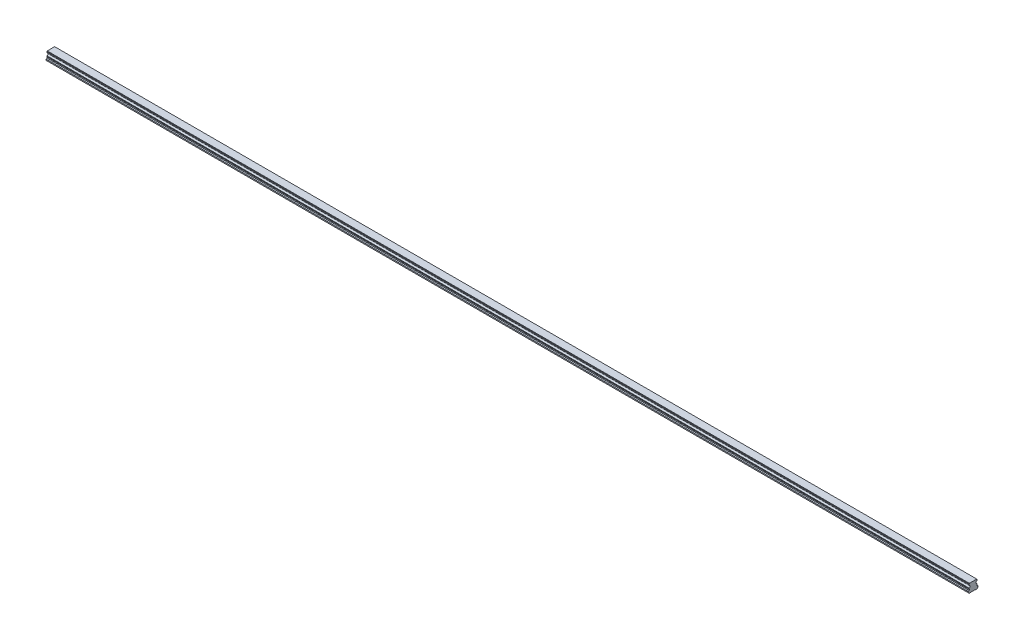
ISO-10303-21;
HEADER;
FILE_DESCRIPTION(('STEP AP214'),'2;1');
FILE_NAME('part.step','',(''),(''),'','','');
FILE_SCHEMA(('AUTOMOTIVE_DESIGN { 1 0 10303 214 1 1 1 1 }'));
ENDSEC;
DATA;
#1=APPLICATION_CONTEXT('core data for automotive mechanical design processes');
#2=APPLICATION_PROTOCOL_DEFINITION('international standard','automotive_design',2000,#1);
#3=PRODUCT_CONTEXT('',#1,'mechanical');
#4=PRODUCT('Part','Part','',(#3));
#5=PRODUCT_RELATED_PRODUCT_CATEGORY('part','',(#4));
#6=PRODUCT_DEFINITION_FORMATION('','',#4);
#7=PRODUCT_DEFINITION_CONTEXT('part definition',#1,'design');
#8=PRODUCT_DEFINITION('design','',#6,#7);
#9=PRODUCT_DEFINITION_SHAPE('','',#8);
#10=(LENGTH_UNIT() NAMED_UNIT(*) SI_UNIT(.MILLI.,.METRE.));
#11=(NAMED_UNIT(*) PLANE_ANGLE_UNIT() SI_UNIT($,.RADIAN.));
#12=(NAMED_UNIT(*) SI_UNIT($,.STERADIAN.) SOLID_ANGLE_UNIT());
#13=UNCERTAINTY_MEASURE_WITH_UNIT(LENGTH_MEASURE(1.E-05),#10,'distance_accuracy_value','');
#14=(GEOMETRIC_REPRESENTATION_CONTEXT(3) GLOBAL_UNCERTAINTY_ASSIGNED_CONTEXT((#13)) GLOBAL_UNIT_ASSIGNED_CONTEXT((#10,
#11,#12)) REPRESENTATION_CONTEXT('',''));
#15=CARTESIAN_POINT('',(0.,0.,0.));
#16=DIRECTION('',(0.,0.,1.));
#17=DIRECTION('',(1.,0.,0.));
#18=AXIS2_PLACEMENT_3D('',#15,#16,#17);
#19=CARTESIAN_POINT('',(2310.,0.499999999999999,0.));
#20=DIRECTION('',(0.,-1.,0.));
#21=DIRECTION('',(0.,0.,-1.));
#22=AXIS2_PLACEMENT_3D('',#19,#20,#21);
#23=CONICAL_SURFACE('',#22,3.5,0.785398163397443);
#24=CARTESIAN_POINT('',(2310.,1.00000000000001,0.));
#25=DIRECTION('',(0.,1.,0.));
#26=DIRECTION('',(0.,0.,1.));
#27=AXIS2_PLACEMENT_3D('',#24,#25,#26);
#28=CIRCLE('',#27,3.);
#29=CARTESIAN_POINT('',(2310.,1.00000000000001,3.));
#30=VERTEX_POINT('',#29);
#31=EDGE_CURVE('E11',#30,#30,#28,.F.);
#32=ORIENTED_EDGE('',*,*,#31,.F.);
#33=EDGE_LOOP('',(#32));
#34=FACE_BOUND('',#33,.T.);
#35=CARTESIAN_POINT('',(2310.,0.499999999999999,0.));
#36=DIRECTION('',(0.,1.,0.));
#37=DIRECTION('',(0.,0.,1.));
#38=AXIS2_PLACEMENT_3D('',#35,#36,#37);
#39=CIRCLE('',#38,3.5);
#40=CARTESIAN_POINT('',(2310.,0.5,3.5));
#41=VERTEX_POINT('',#40);
#42=EDGE_CURVE('E866',#41,#41,#39,.T.);
#43=ORIENTED_EDGE('',*,*,#42,.F.);
#44=EDGE_LOOP('',(#43));
#45=FACE_BOUND('',#44,.T.);
#46=ADVANCED_FACE('F39',(#34,#45),#23,.F.);
#47=CARTESIAN_POINT('',(2310.,12.,0.));
#48=DIRECTION('',(0.,-1.,0.));
#49=DIRECTION('',(0.,0.,-1.));
#50=AXIS2_PLACEMENT_3D('',#47,#48,#49);
#51=CYLINDRICAL_SURFACE('',#50,3.);
#52=ORIENTED_EDGE('',*,*,#31,.T.);
#53=EDGE_LOOP('',(#52));
#54=FACE_BOUND('',#53,.T.);
#55=CARTESIAN_POINT('',(2310.,12.,0.));
#56=DIRECTION('',(0.,-1.,0.));
#57=DIRECTION('',(0.,0.,-1.));
#58=AXIS2_PLACEMENT_3D('',#55,#56,#57);
#59=CIRCLE('',#58,3.);
#60=CARTESIAN_POINT('',(2310.,12.,-3.));
#61=VERTEX_POINT('',#60);
#62=EDGE_CURVE('E49',#61,#61,#59,.T.);
#63=ORIENTED_EDGE('',*,*,#62,.F.);
#64=EDGE_LOOP('',(#63));
#65=FACE_BOUND('',#64,.T.);
#66=ADVANCED_FACE('F1280',(#54,#65),#51,.F.);
#67=CARTESIAN_POINT('',(2310.,12.,0.));
#68=DIRECTION('',(0.,-1.,0.));
#69=DIRECTION('',(0.,0.,-1.));
#70=AXIS2_PLACEMENT_3D('',#67,#68,#69);
#71=PLANE('',#70);
#72=CARTESIAN_POINT('',(2310.,12.,0.));
#73=DIRECTION('',(0.,-1.,0.));
#74=DIRECTION('',(0.,0.,-1.));
#75=AXIS2_PLACEMENT_3D('',#72,#73,#74);
#76=CIRCLE('',#75,2.5);
#77=CARTESIAN_POINT('',(2310.,12.,-2.5));
#78=VERTEX_POINT('',#77);
#79=EDGE_CURVE('E42',#78,#78,#76,.T.);
#80=ORIENTED_EDGE('',*,*,#79,.F.);
#81=EDGE_LOOP('',(#80));
#82=FACE_BOUND('',#81,.T.);
#83=ORIENTED_EDGE('',*,*,#62,.T.);
#84=EDGE_LOOP('',(#83));
#85=FACE_BOUND('',#84,.T.);
#86=ADVANCED_FACE('F1285',(#82,#85),#71,.T.);
#87=CARTESIAN_POINT('',(2250.,0.499999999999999,0.));
#88=DIRECTION('',(0.,-1.,0.));
#89=DIRECTION('',(0.,0.,-1.));
#90=AXIS2_PLACEMENT_3D('',#87,#88,#89);
#91=CONICAL_SURFACE('',#90,3.5,0.785398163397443);
#92=CARTESIAN_POINT('',(2250.,1.00000000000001,0.));
#93=DIRECTION('',(0.,1.,0.));
#94=DIRECTION('',(0.,0.,1.));
#95=AXIS2_PLACEMENT_3D('',#92,#93,#94);
#96=CIRCLE('',#95,3.);
#97=CARTESIAN_POINT('',(2250.,1.00000000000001,3.));
#98=VERTEX_POINT('',#97);
#99=EDGE_CURVE('E862',#98,#98,#96,.F.);
#100=ORIENTED_EDGE('',*,*,#99,.F.);
#101=EDGE_LOOP('',(#100));
#102=FACE_BOUND('',#101,.T.);
#103=CARTESIAN_POINT('',(2250.,0.499999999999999,0.));
#104=DIRECTION('',(0.,1.,0.));
#105=DIRECTION('',(0.,0.,1.));
#106=AXIS2_PLACEMENT_3D('',#103,#104,#105);
#107=CIRCLE('',#106,3.5);
#108=CARTESIAN_POINT('',(2250.,0.5,3.5));
#109=VERTEX_POINT('',#108);
#110=EDGE_CURVE('E854',#109,#109,#107,.T.);
#111=ORIENTED_EDGE('',*,*,#110,.F.);
#112=EDGE_LOOP('',(#111));
#113=FACE_BOUND('',#112,.T.);
#114=ADVANCED_FACE('F1792',(#102,#113),#91,.F.);
#115=CARTESIAN_POINT('',(2250.,12.,0.));
#116=DIRECTION('',(0.,-1.,0.));
#117=DIRECTION('',(0.,0.,-1.));
#118=AXIS2_PLACEMENT_3D('',#115,#116,#117);
#119=CYLINDRICAL_SURFACE('',#118,3.);
#120=ORIENTED_EDGE('',*,*,#99,.T.);
#121=EDGE_LOOP('',(#120));
#122=FACE_BOUND('',#121,.T.);
#123=CARTESIAN_POINT('',(2250.,12.,0.));
#124=DIRECTION('',(0.,-1.,0.));
#125=DIRECTION('',(0.,0.,-1.));
#126=AXIS2_PLACEMENT_3D('',#123,#124,#125);
#127=CIRCLE('',#126,3.);
#128=CARTESIAN_POINT('',(2250.,12.,-3.));
#129=VERTEX_POINT('',#128);
#130=EDGE_CURVE('E858',#129,#129,#127,.T.);
#131=ORIENTED_EDGE('',*,*,#130,.F.);
#132=EDGE_LOOP('',(#131));
#133=FACE_BOUND('',#132,.T.);
#134=ADVANCED_FACE('F1788',(#122,#133),#119,.F.);
#135=CARTESIAN_POINT('',(2250.,12.,0.));
#136=DIRECTION('',(0.,-1.,0.));
#137=DIRECTION('',(0.,0.,-1.));
#138=AXIS2_PLACEMENT_3D('',#135,#136,#137);
#139=PLANE('',#138);
#140=CARTESIAN_POINT('',(2250.,12.,0.));
#141=DIRECTION('',(0.,-1.,0.));
#142=DIRECTION('',(0.,0.,-1.));
#143=AXIS2_PLACEMENT_3D('',#140,#141,#142);
#144=CIRCLE('',#143,2.5);
#145=CARTESIAN_POINT('',(2250.,12.,-2.5));
#146=VERTEX_POINT('',#145);
#147=EDGE_CURVE('E1017',#146,#146,#144,.T.);
#148=ORIENTED_EDGE('',*,*,#147,.F.);
#149=EDGE_LOOP('',(#148));
#150=FACE_BOUND('',#149,.T.);
#151=ORIENTED_EDGE('',*,*,#130,.T.);
#152=EDGE_LOOP('',(#151));
#153=FACE_BOUND('',#152,.T.);
#154=ADVANCED_FACE('F1784',(#150,#153),#139,.T.);
#155=CARTESIAN_POINT('',(2190.,0.499999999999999,0.));
#156=DIRECTION('',(0.,-1.,0.));
#157=DIRECTION('',(0.,0.,-1.));
#158=AXIS2_PLACEMENT_3D('',#155,#156,#157);
#159=CONICAL_SURFACE('',#158,3.5,0.785398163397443);
#160=CARTESIAN_POINT('',(2190.,1.00000000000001,0.));
#161=DIRECTION('',(0.,1.,0.));
#162=DIRECTION('',(0.,0.,1.));
#163=AXIS2_PLACEMENT_3D('',#160,#161,#162);
#164=CIRCLE('',#163,3.);
#165=CARTESIAN_POINT('',(2190.,1.00000000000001,3.));
#166=VERTEX_POINT('',#165);
#167=EDGE_CURVE('E850',#166,#166,#164,.F.);
#168=ORIENTED_EDGE('',*,*,#167,.F.);
#169=EDGE_LOOP('',(#168));
#170=FACE_BOUND('',#169,.T.);
#171=CARTESIAN_POINT('',(2190.,0.499999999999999,0.));
#172=DIRECTION('',(0.,1.,0.));
#173=DIRECTION('',(0.,0.,1.));
#174=AXIS2_PLACEMENT_3D('',#171,#172,#173);
#175=CIRCLE('',#174,3.5);
#176=CARTESIAN_POINT('',(2190.,0.5,3.5));
#177=VERTEX_POINT('',#176);
#178=EDGE_CURVE('E842',#177,#177,#175,.T.);
#179=ORIENTED_EDGE('',*,*,#178,.F.);
#180=EDGE_LOOP('',(#179));
#181=FACE_BOUND('',#180,.T.);
#182=ADVANCED_FACE('F1780',(#170,#181),#159,.F.);
#183=CARTESIAN_POINT('',(2190.,12.,0.));
#184=DIRECTION('',(0.,-1.,0.));
#185=DIRECTION('',(0.,0.,-1.));
#186=AXIS2_PLACEMENT_3D('',#183,#184,#185);
#187=CYLINDRICAL_SURFACE('',#186,3.);
#188=ORIENTED_EDGE('',*,*,#167,.T.);
#189=EDGE_LOOP('',(#188));
#190=FACE_BOUND('',#189,.T.);
#191=CARTESIAN_POINT('',(2190.,12.,0.));
#192=DIRECTION('',(0.,-1.,0.));
#193=DIRECTION('',(0.,0.,-1.));
#194=AXIS2_PLACEMENT_3D('',#191,#192,#193);
#195=CIRCLE('',#194,3.);
#196=CARTESIAN_POINT('',(2190.,12.,-3.));
#197=VERTEX_POINT('',#196);
#198=EDGE_CURVE('E846',#197,#197,#195,.T.);
#199=ORIENTED_EDGE('',*,*,#198,.F.);
#200=EDGE_LOOP('',(#199));
#201=FACE_BOUND('',#200,.T.);
#202=ADVANCED_FACE('F1776',(#190,#201),#187,.F.);
#203=CARTESIAN_POINT('',(2190.,12.,0.));
#204=DIRECTION('',(0.,-1.,0.));
#205=DIRECTION('',(0.,0.,-1.));
#206=AXIS2_PLACEMENT_3D('',#203,#204,#205);
#207=PLANE('',#206);
#208=CARTESIAN_POINT('',(2190.,12.,0.));
#209=DIRECTION('',(0.,-1.,0.));
#210=DIRECTION('',(0.,0.,-1.));
#211=AXIS2_PLACEMENT_3D('',#208,#209,#210);
#212=CIRCLE('',#211,2.5);
#213=CARTESIAN_POINT('',(2190.,12.,-2.5));
#214=VERTEX_POINT('',#213);
#215=EDGE_CURVE('E1014',#214,#214,#212,.T.);
#216=ORIENTED_EDGE('',*,*,#215,.F.);
#217=EDGE_LOOP('',(#216));
#218=FACE_BOUND('',#217,.T.);
#219=ORIENTED_EDGE('',*,*,#198,.T.);
#220=EDGE_LOOP('',(#219));
#221=FACE_BOUND('',#220,.T.);
#222=ADVANCED_FACE('F1772',(#218,#221),#207,.T.);
#223=CARTESIAN_POINT('',(2130.,0.499999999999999,0.));
#224=DIRECTION('',(0.,-1.,0.));
#225=DIRECTION('',(0.,0.,-1.));
#226=AXIS2_PLACEMENT_3D('',#223,#224,#225);
#227=CONICAL_SURFACE('',#226,3.5,0.785398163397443);
#228=CARTESIAN_POINT('',(2130.,1.00000000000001,0.));
#229=DIRECTION('',(0.,1.,0.));
#230=DIRECTION('',(0.,0.,1.));
#231=AXIS2_PLACEMENT_3D('',#228,#229,#230);
#232=CIRCLE('',#231,3.);
#233=CARTESIAN_POINT('',(2130.,1.00000000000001,3.));
#234=VERTEX_POINT('',#233);
#235=EDGE_CURVE('E838',#234,#234,#232,.F.);
#236=ORIENTED_EDGE('',*,*,#235,.F.);
#237=EDGE_LOOP('',(#236));
#238=FACE_BOUND('',#237,.T.);
#239=CARTESIAN_POINT('',(2130.,0.499999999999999,0.));
#240=DIRECTION('',(0.,1.,0.));
#241=DIRECTION('',(0.,0.,1.));
#242=AXIS2_PLACEMENT_3D('',#239,#240,#241);
#243=CIRCLE('',#242,3.5);
#244=CARTESIAN_POINT('',(2130.,0.5,3.5));
#245=VERTEX_POINT('',#244);
#246=EDGE_CURVE('E830',#245,#245,#243,.T.);
#247=ORIENTED_EDGE('',*,*,#246,.F.);
#248=EDGE_LOOP('',(#247));
#249=FACE_BOUND('',#248,.T.);
#250=ADVANCED_FACE('F1768',(#238,#249),#227,.F.);
#251=CARTESIAN_POINT('',(2130.,12.,0.));
#252=DIRECTION('',(0.,-1.,0.));
#253=DIRECTION('',(0.,0.,-1.));
#254=AXIS2_PLACEMENT_3D('',#251,#252,#253);
#255=CYLINDRICAL_SURFACE('',#254,3.);
#256=ORIENTED_EDGE('',*,*,#235,.T.);
#257=EDGE_LOOP('',(#256));
#258=FACE_BOUND('',#257,.T.);
#259=CARTESIAN_POINT('',(2130.,12.,0.));
#260=DIRECTION('',(0.,-1.,0.));
#261=DIRECTION('',(0.,0.,-1.));
#262=AXIS2_PLACEMENT_3D('',#259,#260,#261);
#263=CIRCLE('',#262,3.);
#264=CARTESIAN_POINT('',(2130.,12.,-3.));
#265=VERTEX_POINT('',#264);
#266=EDGE_CURVE('E834',#265,#265,#263,.T.);
#267=ORIENTED_EDGE('',*,*,#266,.F.);
#268=EDGE_LOOP('',(#267));
#269=FACE_BOUND('',#268,.T.);
#270=ADVANCED_FACE('F1764',(#258,#269),#255,.F.);
#271=CARTESIAN_POINT('',(2130.,12.,0.));
#272=DIRECTION('',(0.,-1.,0.));
#273=DIRECTION('',(0.,0.,-1.));
#274=AXIS2_PLACEMENT_3D('',#271,#272,#273);
#275=PLANE('',#274);
#276=CARTESIAN_POINT('',(2130.,12.,0.));
#277=DIRECTION('',(0.,-1.,0.));
#278=DIRECTION('',(0.,0.,-1.));
#279=AXIS2_PLACEMENT_3D('',#276,#277,#278);
#280=CIRCLE('',#279,2.5);
#281=CARTESIAN_POINT('',(2130.,12.,-2.5));
#282=VERTEX_POINT('',#281);
#283=EDGE_CURVE('E1010',#282,#282,#280,.T.);
#284=ORIENTED_EDGE('',*,*,#283,.F.);
#285=EDGE_LOOP('',(#284));
#286=FACE_BOUND('',#285,.T.);
#287=ORIENTED_EDGE('',*,*,#266,.T.);
#288=EDGE_LOOP('',(#287));
#289=FACE_BOUND('',#288,.T.);
#290=ADVANCED_FACE('F1760',(#286,#289),#275,.T.);
#291=CARTESIAN_POINT('',(2070.,0.499999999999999,0.));
#292=DIRECTION('',(0.,-1.,0.));
#293=DIRECTION('',(0.,0.,-1.));
#294=AXIS2_PLACEMENT_3D('',#291,#292,#293);
#295=CONICAL_SURFACE('',#294,3.5,0.785398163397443);
#296=CARTESIAN_POINT('',(2070.,1.00000000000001,0.));
#297=DIRECTION('',(0.,1.,0.));
#298=DIRECTION('',(0.,0.,1.));
#299=AXIS2_PLACEMENT_3D('',#296,#297,#298);
#300=CIRCLE('',#299,3.);
#301=CARTESIAN_POINT('',(2070.,1.00000000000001,3.));
#302=VERTEX_POINT('',#301);
#303=EDGE_CURVE('E826',#302,#302,#300,.F.);
#304=ORIENTED_EDGE('',*,*,#303,.F.);
#305=EDGE_LOOP('',(#304));
#306=FACE_BOUND('',#305,.T.);
#307=CARTESIAN_POINT('',(2070.,0.499999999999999,0.));
#308=DIRECTION('',(0.,1.,0.));
#309=DIRECTION('',(0.,0.,1.));
#310=AXIS2_PLACEMENT_3D('',#307,#308,#309);
#311=CIRCLE('',#310,3.5);
#312=CARTESIAN_POINT('',(2070.,0.5,3.5));
#313=VERTEX_POINT('',#312);
#314=EDGE_CURVE('E818',#313,#313,#311,.T.);
#315=ORIENTED_EDGE('',*,*,#314,.F.);
#316=EDGE_LOOP('',(#315));
#317=FACE_BOUND('',#316,.T.);
#318=ADVANCED_FACE('F1756',(#306,#317),#295,.F.);
#319=CARTESIAN_POINT('',(2070.,12.,0.));
#320=DIRECTION('',(0.,-1.,0.));
#321=DIRECTION('',(0.,0.,-1.));
#322=AXIS2_PLACEMENT_3D('',#319,#320,#321);
#323=CYLINDRICAL_SURFACE('',#322,3.);
#324=ORIENTED_EDGE('',*,*,#303,.T.);
#325=EDGE_LOOP('',(#324));
#326=FACE_BOUND('',#325,.T.);
#327=CARTESIAN_POINT('',(2070.,12.,0.));
#328=DIRECTION('',(0.,-1.,0.));
#329=DIRECTION('',(0.,0.,-1.));
#330=AXIS2_PLACEMENT_3D('',#327,#328,#329);
#331=CIRCLE('',#330,3.);
#332=CARTESIAN_POINT('',(2070.,12.,-3.));
#333=VERTEX_POINT('',#332);
#334=EDGE_CURVE('E822',#333,#333,#331,.T.);
#335=ORIENTED_EDGE('',*,*,#334,.F.);
#336=EDGE_LOOP('',(#335));
#337=FACE_BOUND('',#336,.T.);
#338=ADVANCED_FACE('F1752',(#326,#337),#323,.F.);
#339=CARTESIAN_POINT('',(2070.,12.,0.));
#340=DIRECTION('',(0.,-1.,0.));
#341=DIRECTION('',(0.,0.,-1.));
#342=AXIS2_PLACEMENT_3D('',#339,#340,#341);
#343=PLANE('',#342);
#344=CARTESIAN_POINT('',(2070.,12.,0.));
#345=DIRECTION('',(0.,-1.,0.));
#346=DIRECTION('',(0.,0.,-1.));
#347=AXIS2_PLACEMENT_3D('',#344,#345,#346);
#348=CIRCLE('',#347,2.5);
#349=CARTESIAN_POINT('',(2070.,12.,-2.5));
#350=VERTEX_POINT('',#349);
#351=EDGE_CURVE('E1006',#350,#350,#348,.T.);
#352=ORIENTED_EDGE('',*,*,#351,.F.);
#353=EDGE_LOOP('',(#352));
#354=FACE_BOUND('',#353,.T.);
#355=ORIENTED_EDGE('',*,*,#334,.T.);
#356=EDGE_LOOP('',(#355));
#357=FACE_BOUND('',#356,.T.);
#358=ADVANCED_FACE('F1748',(#354,#357),#343,.T.);
#359=CARTESIAN_POINT('',(2010.,0.499999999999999,0.));
#360=DIRECTION('',(0.,-1.,0.));
#361=DIRECTION('',(0.,0.,-1.));
#362=AXIS2_PLACEMENT_3D('',#359,#360,#361);
#363=CONICAL_SURFACE('',#362,3.5,0.785398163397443);
#364=CARTESIAN_POINT('',(2010.,1.00000000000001,0.));
#365=DIRECTION('',(0.,1.,0.));
#366=DIRECTION('',(0.,0.,1.));
#367=AXIS2_PLACEMENT_3D('',#364,#365,#366);
#368=CIRCLE('',#367,3.);
#369=CARTESIAN_POINT('',(2010.,1.00000000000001,3.));
#370=VERTEX_POINT('',#369);
#371=EDGE_CURVE('E814',#370,#370,#368,.F.);
#372=ORIENTED_EDGE('',*,*,#371,.F.);
#373=EDGE_LOOP('',(#372));
#374=FACE_BOUND('',#373,.T.);
#375=CARTESIAN_POINT('',(2010.,0.499999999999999,0.));
#376=DIRECTION('',(0.,1.,0.));
#377=DIRECTION('',(0.,0.,1.));
#378=AXIS2_PLACEMENT_3D('',#375,#376,#377);
#379=CIRCLE('',#378,3.5);
#380=CARTESIAN_POINT('',(2010.,0.5,3.5));
#381=VERTEX_POINT('',#380);
#382=EDGE_CURVE('E806',#381,#381,#379,.T.);
#383=ORIENTED_EDGE('',*,*,#382,.F.);
#384=EDGE_LOOP('',(#383));
#385=FACE_BOUND('',#384,.T.);
#386=ADVANCED_FACE('F1744',(#374,#385),#363,.F.);
#387=CARTESIAN_POINT('',(2010.,12.,0.));
#388=DIRECTION('',(0.,-1.,0.));
#389=DIRECTION('',(0.,0.,-1.));
#390=AXIS2_PLACEMENT_3D('',#387,#388,#389);
#391=CYLINDRICAL_SURFACE('',#390,3.);
#392=ORIENTED_EDGE('',*,*,#371,.T.);
#393=EDGE_LOOP('',(#392));
#394=FACE_BOUND('',#393,.T.);
#395=CARTESIAN_POINT('',(2010.,12.,0.));
#396=DIRECTION('',(0.,-1.,0.));
#397=DIRECTION('',(0.,0.,-1.));
#398=AXIS2_PLACEMENT_3D('',#395,#396,#397);
#399=CIRCLE('',#398,3.);
#400=CARTESIAN_POINT('',(2010.,12.,-3.));
#401=VERTEX_POINT('',#400);
#402=EDGE_CURVE('E810',#401,#401,#399,.T.);
#403=ORIENTED_EDGE('',*,*,#402,.F.);
#404=EDGE_LOOP('',(#403));
#405=FACE_BOUND('',#404,.T.);
#406=ADVANCED_FACE('F1740',(#394,#405),#391,.F.);
#407=CARTESIAN_POINT('',(2010.,12.,0.));
#408=DIRECTION('',(0.,-1.,0.));
#409=DIRECTION('',(0.,0.,-1.));
#410=AXIS2_PLACEMENT_3D('',#407,#408,#409);
#411=PLANE('',#410);
#412=CARTESIAN_POINT('',(2010.,12.,0.));
#413=DIRECTION('',(0.,-1.,0.));
#414=DIRECTION('',(0.,0.,-1.));
#415=AXIS2_PLACEMENT_3D('',#412,#413,#414);
#416=CIRCLE('',#415,2.5);
#417=CARTESIAN_POINT('',(2010.,12.,-2.5));
#418=VERTEX_POINT('',#417);
#419=EDGE_CURVE('E1002',#418,#418,#416,.T.);
#420=ORIENTED_EDGE('',*,*,#419,.F.);
#421=EDGE_LOOP('',(#420));
#422=FACE_BOUND('',#421,.T.);
#423=ORIENTED_EDGE('',*,*,#402,.T.);
#424=EDGE_LOOP('',(#423));
#425=FACE_BOUND('',#424,.T.);
#426=ADVANCED_FACE('F1736',(#422,#425),#411,.T.);
#427=CARTESIAN_POINT('',(1950.,0.499999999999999,0.));
#428=DIRECTION('',(0.,-1.,0.));
#429=DIRECTION('',(0.,0.,-1.));
#430=AXIS2_PLACEMENT_3D('',#427,#428,#429);
#431=CONICAL_SURFACE('',#430,3.5,0.785398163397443);
#432=CARTESIAN_POINT('',(1950.,1.00000000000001,0.));
#433=DIRECTION('',(0.,1.,0.));
#434=DIRECTION('',(0.,0.,1.));
#435=AXIS2_PLACEMENT_3D('',#432,#433,#434);
#436=CIRCLE('',#435,3.);
#437=CARTESIAN_POINT('',(1950.,1.00000000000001,3.));
#438=VERTEX_POINT('',#437);
#439=EDGE_CURVE('E802',#438,#438,#436,.F.);
#440=ORIENTED_EDGE('',*,*,#439,.F.);
#441=EDGE_LOOP('',(#440));
#442=FACE_BOUND('',#441,.T.);
#443=CARTESIAN_POINT('',(1950.,0.499999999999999,0.));
#444=DIRECTION('',(0.,1.,0.));
#445=DIRECTION('',(0.,0.,1.));
#446=AXIS2_PLACEMENT_3D('',#443,#444,#445);
#447=CIRCLE('',#446,3.5);
#448=CARTESIAN_POINT('',(1950.,0.5,3.5));
#449=VERTEX_POINT('',#448);
#450=EDGE_CURVE('E794',#449,#449,#447,.T.);
#451=ORIENTED_EDGE('',*,*,#450,.F.);
#452=EDGE_LOOP('',(#451));
#453=FACE_BOUND('',#452,.T.);
#454=ADVANCED_FACE('F1732',(#442,#453),#431,.F.);
#455=CARTESIAN_POINT('',(1950.,12.,0.));
#456=DIRECTION('',(0.,-1.,0.));
#457=DIRECTION('',(0.,0.,-1.));
#458=AXIS2_PLACEMENT_3D('',#455,#456,#457);
#459=CYLINDRICAL_SURFACE('',#458,3.);
#460=ORIENTED_EDGE('',*,*,#439,.T.);
#461=EDGE_LOOP('',(#460));
#462=FACE_BOUND('',#461,.T.);
#463=CARTESIAN_POINT('',(1950.,12.,0.));
#464=DIRECTION('',(0.,-1.,0.));
#465=DIRECTION('',(0.,0.,-1.));
#466=AXIS2_PLACEMENT_3D('',#463,#464,#465);
#467=CIRCLE('',#466,3.);
#468=CARTESIAN_POINT('',(1950.,12.,-3.));
#469=VERTEX_POINT('',#468);
#470=EDGE_CURVE('E798',#469,#469,#467,.T.);
#471=ORIENTED_EDGE('',*,*,#470,.F.);
#472=EDGE_LOOP('',(#471));
#473=FACE_BOUND('',#472,.T.);
#474=ADVANCED_FACE('F1728',(#462,#473),#459,.F.);
#475=CARTESIAN_POINT('',(1950.,12.,0.));
#476=DIRECTION('',(0.,-1.,0.));
#477=DIRECTION('',(0.,0.,-1.));
#478=AXIS2_PLACEMENT_3D('',#475,#476,#477);
#479=PLANE('',#478);
#480=CARTESIAN_POINT('',(1950.,12.,0.));
#481=DIRECTION('',(0.,-1.,0.));
#482=DIRECTION('',(0.,0.,-1.));
#483=AXIS2_PLACEMENT_3D('',#480,#481,#482);
#484=CIRCLE('',#483,2.5);
#485=CARTESIAN_POINT('',(1950.,12.,-2.5));
#486=VERTEX_POINT('',#485);
#487=EDGE_CURVE('E998',#486,#486,#484,.T.);
#488=ORIENTED_EDGE('',*,*,#487,.F.);
#489=EDGE_LOOP('',(#488));
#490=FACE_BOUND('',#489,.T.);
#491=ORIENTED_EDGE('',*,*,#470,.T.);
#492=EDGE_LOOP('',(#491));
#493=FACE_BOUND('',#492,.T.);
#494=ADVANCED_FACE('F1724',(#490,#493),#479,.T.);
#495=CARTESIAN_POINT('',(1890.,0.499999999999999,0.));
#496=DIRECTION('',(0.,-1.,0.));
#497=DIRECTION('',(0.,0.,-1.));
#498=AXIS2_PLACEMENT_3D('',#495,#496,#497);
#499=CONICAL_SURFACE('',#498,3.5,0.785398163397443);
#500=CARTESIAN_POINT('',(1890.,1.00000000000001,0.));
#501=DIRECTION('',(0.,1.,0.));
#502=DIRECTION('',(0.,0.,1.));
#503=AXIS2_PLACEMENT_3D('',#500,#501,#502);
#504=CIRCLE('',#503,3.);
#505=CARTESIAN_POINT('',(1890.,1.00000000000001,3.));
#506=VERTEX_POINT('',#505);
#507=EDGE_CURVE('E790',#506,#506,#504,.F.);
#508=ORIENTED_EDGE('',*,*,#507,.F.);
#509=EDGE_LOOP('',(#508));
#510=FACE_BOUND('',#509,.T.);
#511=CARTESIAN_POINT('',(1890.,0.499999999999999,0.));
#512=DIRECTION('',(0.,1.,0.));
#513=DIRECTION('',(0.,0.,1.));
#514=AXIS2_PLACEMENT_3D('',#511,#512,#513);
#515=CIRCLE('',#514,3.5);
#516=CARTESIAN_POINT('',(1890.,0.5,3.5));
#517=VERTEX_POINT('',#516);
#518=EDGE_CURVE('E782',#517,#517,#515,.T.);
#519=ORIENTED_EDGE('',*,*,#518,.F.);
#520=EDGE_LOOP('',(#519));
#521=FACE_BOUND('',#520,.T.);
#522=ADVANCED_FACE('F1720',(#510,#521),#499,.F.);
#523=CARTESIAN_POINT('',(1890.,12.,0.));
#524=DIRECTION('',(0.,-1.,0.));
#525=DIRECTION('',(0.,0.,-1.));
#526=AXIS2_PLACEMENT_3D('',#523,#524,#525);
#527=CYLINDRICAL_SURFACE('',#526,3.);
#528=ORIENTED_EDGE('',*,*,#507,.T.);
#529=EDGE_LOOP('',(#528));
#530=FACE_BOUND('',#529,.T.);
#531=CARTESIAN_POINT('',(1890.,12.,0.));
#532=DIRECTION('',(0.,-1.,0.));
#533=DIRECTION('',(0.,0.,-1.));
#534=AXIS2_PLACEMENT_3D('',#531,#532,#533);
#535=CIRCLE('',#534,3.);
#536=CARTESIAN_POINT('',(1890.,12.,-3.));
#537=VERTEX_POINT('',#536);
#538=EDGE_CURVE('E786',#537,#537,#535,.T.);
#539=ORIENTED_EDGE('',*,*,#538,.F.);
#540=EDGE_LOOP('',(#539));
#541=FACE_BOUND('',#540,.T.);
#542=ADVANCED_FACE('F1716',(#530,#541),#527,.F.);
#543=CARTESIAN_POINT('',(1890.,12.,0.));
#544=DIRECTION('',(0.,-1.,0.));
#545=DIRECTION('',(0.,0.,-1.));
#546=AXIS2_PLACEMENT_3D('',#543,#544,#545);
#547=PLANE('',#546);
#548=CARTESIAN_POINT('',(1890.,12.,0.));
#549=DIRECTION('',(0.,-1.,0.));
#550=DIRECTION('',(0.,0.,-1.));
#551=AXIS2_PLACEMENT_3D('',#548,#549,#550);
#552=CIRCLE('',#551,2.5);
#553=CARTESIAN_POINT('',(1890.,12.,-2.5));
#554=VERTEX_POINT('',#553);
#555=EDGE_CURVE('E994',#554,#554,#552,.T.);
#556=ORIENTED_EDGE('',*,*,#555,.F.);
#557=EDGE_LOOP('',(#556));
#558=FACE_BOUND('',#557,.T.);
#559=ORIENTED_EDGE('',*,*,#538,.T.);
#560=EDGE_LOOP('',(#559));
#561=FACE_BOUND('',#560,.T.);
#562=ADVANCED_FACE('F1712',(#558,#561),#547,.T.);
#563=CARTESIAN_POINT('',(1830.,0.499999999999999,0.));
#564=DIRECTION('',(0.,-1.,0.));
#565=DIRECTION('',(0.,0.,-1.));
#566=AXIS2_PLACEMENT_3D('',#563,#564,#565);
#567=CONICAL_SURFACE('',#566,3.5,0.785398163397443);
#568=CARTESIAN_POINT('',(1830.,1.00000000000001,0.));
#569=DIRECTION('',(0.,1.,0.));
#570=DIRECTION('',(0.,0.,1.));
#571=AXIS2_PLACEMENT_3D('',#568,#569,#570);
#572=CIRCLE('',#571,3.);
#573=CARTESIAN_POINT('',(1830.,1.00000000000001,3.));
#574=VERTEX_POINT('',#573);
#575=EDGE_CURVE('E778',#574,#574,#572,.F.);
#576=ORIENTED_EDGE('',*,*,#575,.F.);
#577=EDGE_LOOP('',(#576));
#578=FACE_BOUND('',#577,.T.);
#579=CARTESIAN_POINT('',(1830.,0.499999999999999,0.));
#580=DIRECTION('',(0.,1.,0.));
#581=DIRECTION('',(0.,0.,1.));
#582=AXIS2_PLACEMENT_3D('',#579,#580,#581);
#583=CIRCLE('',#582,3.5);
#584=CARTESIAN_POINT('',(1830.,0.5,3.5));
#585=VERTEX_POINT('',#584);
#586=EDGE_CURVE('E770',#585,#585,#583,.T.);
#587=ORIENTED_EDGE('',*,*,#586,.F.);
#588=EDGE_LOOP('',(#587));
#589=FACE_BOUND('',#588,.T.);
#590=ADVANCED_FACE('F1708',(#578,#589),#567,.F.);
#591=CARTESIAN_POINT('',(1830.,12.,0.));
#592=DIRECTION('',(0.,-1.,0.));
#593=DIRECTION('',(0.,0.,-1.));
#594=AXIS2_PLACEMENT_3D('',#591,#592,#593);
#595=CYLINDRICAL_SURFACE('',#594,3.);
#596=ORIENTED_EDGE('',*,*,#575,.T.);
#597=EDGE_LOOP('',(#596));
#598=FACE_BOUND('',#597,.T.);
#599=CARTESIAN_POINT('',(1830.,12.,0.));
#600=DIRECTION('',(0.,-1.,0.));
#601=DIRECTION('',(0.,0.,-1.));
#602=AXIS2_PLACEMENT_3D('',#599,#600,#601);
#603=CIRCLE('',#602,3.);
#604=CARTESIAN_POINT('',(1830.,12.,-3.));
#605=VERTEX_POINT('',#604);
#606=EDGE_CURVE('E774',#605,#605,#603,.T.);
#607=ORIENTED_EDGE('',*,*,#606,.F.);
#608=EDGE_LOOP('',(#607));
#609=FACE_BOUND('',#608,.T.);
#610=ADVANCED_FACE('F1704',(#598,#609),#595,.F.);
#611=CARTESIAN_POINT('',(1830.,12.,0.));
#612=DIRECTION('',(0.,-1.,0.));
#613=DIRECTION('',(0.,0.,-1.));
#614=AXIS2_PLACEMENT_3D('',#611,#612,#613);
#615=PLANE('',#614);
#616=CARTESIAN_POINT('',(1830.,12.,0.));
#617=DIRECTION('',(0.,-1.,0.));
#618=DIRECTION('',(0.,0.,-1.));
#619=AXIS2_PLACEMENT_3D('',#616,#617,#618);
#620=CIRCLE('',#619,2.5);
#621=CARTESIAN_POINT('',(1830.,12.,-2.5));
#622=VERTEX_POINT('',#621);
#623=EDGE_CURVE('E990',#622,#622,#620,.T.);
#624=ORIENTED_EDGE('',*,*,#623,.F.);
#625=EDGE_LOOP('',(#624));
#626=FACE_BOUND('',#625,.T.);
#627=ORIENTED_EDGE('',*,*,#606,.T.);
#628=EDGE_LOOP('',(#627));
#629=FACE_BOUND('',#628,.T.);
#630=ADVANCED_FACE('F1700',(#626,#629),#615,.T.);
#631=CARTESIAN_POINT('',(1770.,0.499999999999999,0.));
#632=DIRECTION('',(0.,-1.,0.));
#633=DIRECTION('',(0.,0.,-1.));
#634=AXIS2_PLACEMENT_3D('',#631,#632,#633);
#635=CONICAL_SURFACE('',#634,3.5,0.785398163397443);
#636=CARTESIAN_POINT('',(1770.,1.00000000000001,0.));
#637=DIRECTION('',(0.,1.,0.));
#638=DIRECTION('',(0.,0.,1.));
#639=AXIS2_PLACEMENT_3D('',#636,#637,#638);
#640=CIRCLE('',#639,3.);
#641=CARTESIAN_POINT('',(1770.,1.00000000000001,3.));
#642=VERTEX_POINT('',#641);
#643=EDGE_CURVE('E766',#642,#642,#640,.F.);
#644=ORIENTED_EDGE('',*,*,#643,.F.);
#645=EDGE_LOOP('',(#644));
#646=FACE_BOUND('',#645,.T.);
#647=CARTESIAN_POINT('',(1770.,0.499999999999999,0.));
#648=DIRECTION('',(0.,1.,0.));
#649=DIRECTION('',(0.,0.,1.));
#650=AXIS2_PLACEMENT_3D('',#647,#648,#649);
#651=CIRCLE('',#650,3.5);
#652=CARTESIAN_POINT('',(1770.,0.5,3.5));
#653=VERTEX_POINT('',#652);
#654=EDGE_CURVE('E758',#653,#653,#651,.T.);
#655=ORIENTED_EDGE('',*,*,#654,.F.);
#656=EDGE_LOOP('',(#655));
#657=FACE_BOUND('',#656,.T.);
#658=ADVANCED_FACE('F1696',(#646,#657),#635,.F.);
#659=CARTESIAN_POINT('',(1770.,12.,0.));
#660=DIRECTION('',(0.,-1.,0.));
#661=DIRECTION('',(0.,0.,-1.));
#662=AXIS2_PLACEMENT_3D('',#659,#660,#661);
#663=CYLINDRICAL_SURFACE('',#662,3.);
#664=ORIENTED_EDGE('',*,*,#643,.T.);
#665=EDGE_LOOP('',(#664));
#666=FACE_BOUND('',#665,.T.);
#667=CARTESIAN_POINT('',(1770.,12.,0.));
#668=DIRECTION('',(0.,-1.,0.));
#669=DIRECTION('',(0.,0.,-1.));
#670=AXIS2_PLACEMENT_3D('',#667,#668,#669);
#671=CIRCLE('',#670,3.);
#672=CARTESIAN_POINT('',(1770.,12.,-3.));
#673=VERTEX_POINT('',#672);
#674=EDGE_CURVE('E762',#673,#673,#671,.T.);
#675=ORIENTED_EDGE('',*,*,#674,.F.);
#676=EDGE_LOOP('',(#675));
#677=FACE_BOUND('',#676,.T.);
#678=ADVANCED_FACE('F1692',(#666,#677),#663,.F.);
#679=CARTESIAN_POINT('',(1770.,12.,0.));
#680=DIRECTION('',(0.,-1.,0.));
#681=DIRECTION('',(0.,0.,-1.));
#682=AXIS2_PLACEMENT_3D('',#679,#680,#681);
#683=PLANE('',#682);
#684=CARTESIAN_POINT('',(1770.,12.,0.));
#685=DIRECTION('',(0.,-1.,0.));
#686=DIRECTION('',(0.,0.,-1.));
#687=AXIS2_PLACEMENT_3D('',#684,#685,#686);
#688=CIRCLE('',#687,2.5);
#689=CARTESIAN_POINT('',(1770.,12.,-2.5));
#690=VERTEX_POINT('',#689);
#691=EDGE_CURVE('E986',#690,#690,#688,.T.);
#692=ORIENTED_EDGE('',*,*,#691,.F.);
#693=EDGE_LOOP('',(#692));
#694=FACE_BOUND('',#693,.T.);
#695=ORIENTED_EDGE('',*,*,#674,.T.);
#696=EDGE_LOOP('',(#695));
#697=FACE_BOUND('',#696,.T.);
#698=ADVANCED_FACE('F1688',(#694,#697),#683,.T.);
#699=CARTESIAN_POINT('',(1710.,0.499999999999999,0.));
#700=DIRECTION('',(0.,-1.,0.));
#701=DIRECTION('',(0.,0.,-1.));
#702=AXIS2_PLACEMENT_3D('',#699,#700,#701);
#703=CONICAL_SURFACE('',#702,3.5,0.785398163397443);
#704=CARTESIAN_POINT('',(1710.,1.00000000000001,0.));
#705=DIRECTION('',(0.,1.,0.));
#706=DIRECTION('',(0.,0.,1.));
#707=AXIS2_PLACEMENT_3D('',#704,#705,#706);
#708=CIRCLE('',#707,3.);
#709=CARTESIAN_POINT('',(1710.,1.00000000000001,3.));
#710=VERTEX_POINT('',#709);
#711=EDGE_CURVE('E754',#710,#710,#708,.F.);
#712=ORIENTED_EDGE('',*,*,#711,.F.);
#713=EDGE_LOOP('',(#712));
#714=FACE_BOUND('',#713,.T.);
#715=CARTESIAN_POINT('',(1710.,0.499999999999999,0.));
#716=DIRECTION('',(0.,1.,0.));
#717=DIRECTION('',(0.,0.,1.));
#718=AXIS2_PLACEMENT_3D('',#715,#716,#717);
#719=CIRCLE('',#718,3.5);
#720=CARTESIAN_POINT('',(1710.,0.5,3.5));
#721=VERTEX_POINT('',#720);
#722=EDGE_CURVE('E746',#721,#721,#719,.T.);
#723=ORIENTED_EDGE('',*,*,#722,.F.);
#724=EDGE_LOOP('',(#723));
#725=FACE_BOUND('',#724,.T.);
#726=ADVANCED_FACE('F1684',(#714,#725),#703,.F.);
#727=CARTESIAN_POINT('',(1710.,12.,0.));
#728=DIRECTION('',(0.,-1.,0.));
#729=DIRECTION('',(0.,0.,-1.));
#730=AXIS2_PLACEMENT_3D('',#727,#728,#729);
#731=CYLINDRICAL_SURFACE('',#730,3.);
#732=ORIENTED_EDGE('',*,*,#711,.T.);
#733=EDGE_LOOP('',(#732));
#734=FACE_BOUND('',#733,.T.);
#735=CARTESIAN_POINT('',(1710.,12.,0.));
#736=DIRECTION('',(0.,-1.,0.));
#737=DIRECTION('',(0.,0.,-1.));
#738=AXIS2_PLACEMENT_3D('',#735,#736,#737);
#739=CIRCLE('',#738,3.);
#740=CARTESIAN_POINT('',(1710.,12.,-3.));
#741=VERTEX_POINT('',#740);
#742=EDGE_CURVE('E750',#741,#741,#739,.T.);
#743=ORIENTED_EDGE('',*,*,#742,.F.);
#744=EDGE_LOOP('',(#743));
#745=FACE_BOUND('',#744,.T.);
#746=ADVANCED_FACE('F1680',(#734,#745),#731,.F.);
#747=CARTESIAN_POINT('',(1710.,12.,0.));
#748=DIRECTION('',(0.,-1.,0.));
#749=DIRECTION('',(0.,0.,-1.));
#750=AXIS2_PLACEMENT_3D('',#747,#748,#749);
#751=PLANE('',#750);
#752=CARTESIAN_POINT('',(1710.,12.,0.));
#753=DIRECTION('',(0.,-1.,0.));
#754=DIRECTION('',(0.,0.,-1.));
#755=AXIS2_PLACEMENT_3D('',#752,#753,#754);
#756=CIRCLE('',#755,2.5);
#757=CARTESIAN_POINT('',(1710.,12.,-2.5));
#758=VERTEX_POINT('',#757);
#759=EDGE_CURVE('E982',#758,#758,#756,.T.);
#760=ORIENTED_EDGE('',*,*,#759,.F.);
#761=EDGE_LOOP('',(#760));
#762=FACE_BOUND('',#761,.T.);
#763=ORIENTED_EDGE('',*,*,#742,.T.);
#764=EDGE_LOOP('',(#763));
#765=FACE_BOUND('',#764,.T.);
#766=ADVANCED_FACE('F1676',(#762,#765),#751,.T.);
#767=CARTESIAN_POINT('',(1650.,0.499999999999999,0.));
#768=DIRECTION('',(0.,-1.,0.));
#769=DIRECTION('',(0.,0.,-1.));
#770=AXIS2_PLACEMENT_3D('',#767,#768,#769);
#771=CONICAL_SURFACE('',#770,3.5,0.785398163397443);
#772=CARTESIAN_POINT('',(1650.,1.00000000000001,0.));
#773=DIRECTION('',(0.,1.,0.));
#774=DIRECTION('',(0.,0.,1.));
#775=AXIS2_PLACEMENT_3D('',#772,#773,#774);
#776=CIRCLE('',#775,3.);
#777=CARTESIAN_POINT('',(1650.,1.00000000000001,3.));
#778=VERTEX_POINT('',#777);
#779=EDGE_CURVE('E742',#778,#778,#776,.F.);
#780=ORIENTED_EDGE('',*,*,#779,.F.);
#781=EDGE_LOOP('',(#780));
#782=FACE_BOUND('',#781,.T.);
#783=CARTESIAN_POINT('',(1650.,0.499999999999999,0.));
#784=DIRECTION('',(0.,1.,0.));
#785=DIRECTION('',(0.,0.,1.));
#786=AXIS2_PLACEMENT_3D('',#783,#784,#785);
#787=CIRCLE('',#786,3.5);
#788=CARTESIAN_POINT('',(1650.,0.5,3.5));
#789=VERTEX_POINT('',#788);
#790=EDGE_CURVE('E734',#789,#789,#787,.T.);
#791=ORIENTED_EDGE('',*,*,#790,.F.);
#792=EDGE_LOOP('',(#791));
#793=FACE_BOUND('',#792,.T.);
#794=ADVANCED_FACE('F1672',(#782,#793),#771,.F.);
#795=CARTESIAN_POINT('',(1650.,12.,0.));
#796=DIRECTION('',(0.,-1.,0.));
#797=DIRECTION('',(0.,0.,-1.));
#798=AXIS2_PLACEMENT_3D('',#795,#796,#797);
#799=CYLINDRICAL_SURFACE('',#798,3.);
#800=ORIENTED_EDGE('',*,*,#779,.T.);
#801=EDGE_LOOP('',(#800));
#802=FACE_BOUND('',#801,.T.);
#803=CARTESIAN_POINT('',(1650.,12.,0.));
#804=DIRECTION('',(0.,-1.,0.));
#805=DIRECTION('',(0.,0.,-1.));
#806=AXIS2_PLACEMENT_3D('',#803,#804,#805);
#807=CIRCLE('',#806,3.);
#808=CARTESIAN_POINT('',(1650.,12.,-3.));
#809=VERTEX_POINT('',#808);
#810=EDGE_CURVE('E738',#809,#809,#807,.T.);
#811=ORIENTED_EDGE('',*,*,#810,.F.);
#812=EDGE_LOOP('',(#811));
#813=FACE_BOUND('',#812,.T.);
#814=ADVANCED_FACE('F1668',(#802,#813),#799,.F.);
#815=CARTESIAN_POINT('',(1650.,12.,0.));
#816=DIRECTION('',(0.,-1.,0.));
#817=DIRECTION('',(0.,0.,-1.));
#818=AXIS2_PLACEMENT_3D('',#815,#816,#817);
#819=PLANE('',#818);
#820=CARTESIAN_POINT('',(1650.,12.,0.));
#821=DIRECTION('',(0.,-1.,0.));
#822=DIRECTION('',(0.,0.,-1.));
#823=AXIS2_PLACEMENT_3D('',#820,#821,#822);
#824=CIRCLE('',#823,2.5);
#825=CARTESIAN_POINT('',(1650.,12.,-2.5));
#826=VERTEX_POINT('',#825);
#827=EDGE_CURVE('E978',#826,#826,#824,.T.);
#828=ORIENTED_EDGE('',*,*,#827,.F.);
#829=EDGE_LOOP('',(#828));
#830=FACE_BOUND('',#829,.T.);
#831=ORIENTED_EDGE('',*,*,#810,.T.);
#832=EDGE_LOOP('',(#831));
#833=FACE_BOUND('',#832,.T.);
#834=ADVANCED_FACE('F1664',(#830,#833),#819,.T.);
#835=CARTESIAN_POINT('',(1590.,0.499999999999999,0.));
#836=DIRECTION('',(0.,-1.,0.));
#837=DIRECTION('',(0.,0.,-1.));
#838=AXIS2_PLACEMENT_3D('',#835,#836,#837);
#839=CONICAL_SURFACE('',#838,3.5,0.785398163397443);
#840=CARTESIAN_POINT('',(1590.,1.00000000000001,0.));
#841=DIRECTION('',(0.,1.,0.));
#842=DIRECTION('',(0.,0.,1.));
#843=AXIS2_PLACEMENT_3D('',#840,#841,#842);
#844=CIRCLE('',#843,3.);
#845=CARTESIAN_POINT('',(1590.,1.00000000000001,3.));
#846=VERTEX_POINT('',#845);
#847=EDGE_CURVE('E730',#846,#846,#844,.F.);
#848=ORIENTED_EDGE('',*,*,#847,.F.);
#849=EDGE_LOOP('',(#848));
#850=FACE_BOUND('',#849,.T.);
#851=CARTESIAN_POINT('',(1590.,0.499999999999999,0.));
#852=DIRECTION('',(0.,1.,0.));
#853=DIRECTION('',(0.,0.,1.));
#854=AXIS2_PLACEMENT_3D('',#851,#852,#853);
#855=CIRCLE('',#854,3.5);
#856=CARTESIAN_POINT('',(1590.,0.5,3.5));
#857=VERTEX_POINT('',#856);
#858=EDGE_CURVE('E722',#857,#857,#855,.T.);
#859=ORIENTED_EDGE('',*,*,#858,.F.);
#860=EDGE_LOOP('',(#859));
#861=FACE_BOUND('',#860,.T.);
#862=ADVANCED_FACE('F1660',(#850,#861),#839,.F.);
#863=CARTESIAN_POINT('',(1590.,12.,0.));
#864=DIRECTION('',(0.,-1.,0.));
#865=DIRECTION('',(0.,0.,-1.));
#866=AXIS2_PLACEMENT_3D('',#863,#864,#865);
#867=CYLINDRICAL_SURFACE('',#866,3.);
#868=ORIENTED_EDGE('',*,*,#847,.T.);
#869=EDGE_LOOP('',(#868));
#870=FACE_BOUND('',#869,.T.);
#871=CARTESIAN_POINT('',(1590.,12.,0.));
#872=DIRECTION('',(0.,-1.,0.));
#873=DIRECTION('',(0.,0.,-1.));
#874=AXIS2_PLACEMENT_3D('',#871,#872,#873);
#875=CIRCLE('',#874,3.);
#876=CARTESIAN_POINT('',(1590.,12.,-3.));
#877=VERTEX_POINT('',#876);
#878=EDGE_CURVE('E726',#877,#877,#875,.T.);
#879=ORIENTED_EDGE('',*,*,#878,.F.);
#880=EDGE_LOOP('',(#879));
#881=FACE_BOUND('',#880,.T.);
#882=ADVANCED_FACE('F1656',(#870,#881),#867,.F.);
#883=CARTESIAN_POINT('',(1590.,12.,0.));
#884=DIRECTION('',(0.,-1.,0.));
#885=DIRECTION('',(0.,0.,-1.));
#886=AXIS2_PLACEMENT_3D('',#883,#884,#885);
#887=PLANE('',#886);
#888=CARTESIAN_POINT('',(1590.,12.,0.));
#889=DIRECTION('',(0.,-1.,0.));
#890=DIRECTION('',(0.,0.,-1.));
#891=AXIS2_PLACEMENT_3D('',#888,#889,#890);
#892=CIRCLE('',#891,2.5);
#893=CARTESIAN_POINT('',(1590.,12.,-2.5));
#894=VERTEX_POINT('',#893);
#895=EDGE_CURVE('E974',#894,#894,#892,.T.);
#896=ORIENTED_EDGE('',*,*,#895,.F.);
#897=EDGE_LOOP('',(#896));
#898=FACE_BOUND('',#897,.T.);
#899=ORIENTED_EDGE('',*,*,#878,.T.);
#900=EDGE_LOOP('',(#899));
#901=FACE_BOUND('',#900,.T.);
#902=ADVANCED_FACE('F1652',(#898,#901),#887,.T.);
#903=CARTESIAN_POINT('',(1530.,0.499999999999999,0.));
#904=DIRECTION('',(0.,-1.,0.));
#905=DIRECTION('',(0.,0.,-1.));
#906=AXIS2_PLACEMENT_3D('',#903,#904,#905);
#907=CONICAL_SURFACE('',#906,3.5,0.785398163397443);
#908=CARTESIAN_POINT('',(1530.,1.00000000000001,0.));
#909=DIRECTION('',(0.,1.,0.));
#910=DIRECTION('',(0.,0.,1.));
#911=AXIS2_PLACEMENT_3D('',#908,#909,#910);
#912=CIRCLE('',#911,3.);
#913=CARTESIAN_POINT('',(1530.,1.00000000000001,3.));
#914=VERTEX_POINT('',#913);
#915=EDGE_CURVE('E718',#914,#914,#912,.F.);
#916=ORIENTED_EDGE('',*,*,#915,.F.);
#917=EDGE_LOOP('',(#916));
#918=FACE_BOUND('',#917,.T.);
#919=CARTESIAN_POINT('',(1530.,0.499999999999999,0.));
#920=DIRECTION('',(0.,1.,0.));
#921=DIRECTION('',(0.,0.,1.));
#922=AXIS2_PLACEMENT_3D('',#919,#920,#921);
#923=CIRCLE('',#922,3.5);
#924=CARTESIAN_POINT('',(1530.,0.5,3.5));
#925=VERTEX_POINT('',#924);
#926=EDGE_CURVE('E710',#925,#925,#923,.T.);
#927=ORIENTED_EDGE('',*,*,#926,.F.);
#928=EDGE_LOOP('',(#927));
#929=FACE_BOUND('',#928,.T.);
#930=ADVANCED_FACE('F1648',(#918,#929),#907,.F.);
#931=CARTESIAN_POINT('',(1530.,12.,0.));
#932=DIRECTION('',(0.,-1.,0.));
#933=DIRECTION('',(0.,0.,-1.));
#934=AXIS2_PLACEMENT_3D('',#931,#932,#933);
#935=CYLINDRICAL_SURFACE('',#934,3.);
#936=ORIENTED_EDGE('',*,*,#915,.T.);
#937=EDGE_LOOP('',(#936));
#938=FACE_BOUND('',#937,.T.);
#939=CARTESIAN_POINT('',(1530.,12.,0.));
#940=DIRECTION('',(0.,-1.,0.));
#941=DIRECTION('',(0.,0.,-1.));
#942=AXIS2_PLACEMENT_3D('',#939,#940,#941);
#943=CIRCLE('',#942,3.);
#944=CARTESIAN_POINT('',(1530.,12.,-3.));
#945=VERTEX_POINT('',#944);
#946=EDGE_CURVE('E714',#945,#945,#943,.T.);
#947=ORIENTED_EDGE('',*,*,#946,.F.);
#948=EDGE_LOOP('',(#947));
#949=FACE_BOUND('',#948,.T.);
#950=ADVANCED_FACE('F1644',(#938,#949),#935,.F.);
#951=CARTESIAN_POINT('',(1530.,12.,0.));
#952=DIRECTION('',(0.,-1.,0.));
#953=DIRECTION('',(0.,0.,-1.));
#954=AXIS2_PLACEMENT_3D('',#951,#952,#953);
#955=PLANE('',#954);
#956=CARTESIAN_POINT('',(1530.,12.,0.));
#957=DIRECTION('',(0.,-1.,0.));
#958=DIRECTION('',(0.,0.,-1.));
#959=AXIS2_PLACEMENT_3D('',#956,#957,#958);
#960=CIRCLE('',#959,2.5);
#961=CARTESIAN_POINT('',(1530.,12.,-2.5));
#962=VERTEX_POINT('',#961);
#963=EDGE_CURVE('E970',#962,#962,#960,.T.);
#964=ORIENTED_EDGE('',*,*,#963,.F.);
#965=EDGE_LOOP('',(#964));
#966=FACE_BOUND('',#965,.T.);
#967=ORIENTED_EDGE('',*,*,#946,.T.);
#968=EDGE_LOOP('',(#967));
#969=FACE_BOUND('',#968,.T.);
#970=ADVANCED_FACE('F1640',(#966,#969),#955,.T.);
#971=CARTESIAN_POINT('',(1470.,0.499999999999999,0.));
#972=DIRECTION('',(0.,-1.,0.));
#973=DIRECTION('',(0.,0.,-1.));
#974=AXIS2_PLACEMENT_3D('',#971,#972,#973);
#975=CONICAL_SURFACE('',#974,3.5,0.785398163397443);
#976=CARTESIAN_POINT('',(1470.,1.00000000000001,0.));
#977=DIRECTION('',(0.,1.,0.));
#978=DIRECTION('',(0.,0.,1.));
#979=AXIS2_PLACEMENT_3D('',#976,#977,#978);
#980=CIRCLE('',#979,3.);
#981=CARTESIAN_POINT('',(1470.,1.00000000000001,3.));
#982=VERTEX_POINT('',#981);
#983=EDGE_CURVE('E706',#982,#982,#980,.F.);
#984=ORIENTED_EDGE('',*,*,#983,.F.);
#985=EDGE_LOOP('',(#984));
#986=FACE_BOUND('',#985,.T.);
#987=CARTESIAN_POINT('',(1470.,0.499999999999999,0.));
#988=DIRECTION('',(0.,1.,0.));
#989=DIRECTION('',(0.,0.,1.));
#990=AXIS2_PLACEMENT_3D('',#987,#988,#989);
#991=CIRCLE('',#990,3.5);
#992=CARTESIAN_POINT('',(1470.,0.5,3.5));
#993=VERTEX_POINT('',#992);
#994=EDGE_CURVE('E698',#993,#993,#991,.T.);
#995=ORIENTED_EDGE('',*,*,#994,.F.);
#996=EDGE_LOOP('',(#995));
#997=FACE_BOUND('',#996,.T.);
#998=ADVANCED_FACE('F1636',(#986,#997),#975,.F.);
#999=CARTESIAN_POINT('',(1470.,12.,0.));
#1000=DIRECTION('',(0.,-1.,0.));
#1001=DIRECTION('',(0.,0.,-1.));
#1002=AXIS2_PLACEMENT_3D('',#999,#1000,#1001);
#1003=CYLINDRICAL_SURFACE('',#1002,3.);
#1004=ORIENTED_EDGE('',*,*,#983,.T.);
#1005=EDGE_LOOP('',(#1004));
#1006=FACE_BOUND('',#1005,.T.);
#1007=CARTESIAN_POINT('',(1470.,12.,0.));
#1008=DIRECTION('',(0.,-1.,0.));
#1009=DIRECTION('',(0.,0.,-1.));
#1010=AXIS2_PLACEMENT_3D('',#1007,#1008,#1009);
#1011=CIRCLE('',#1010,3.);
#1012=CARTESIAN_POINT('',(1470.,12.,-3.));
#1013=VERTEX_POINT('',#1012);
#1014=EDGE_CURVE('E702',#1013,#1013,#1011,.T.);
#1015=ORIENTED_EDGE('',*,*,#1014,.F.);
#1016=EDGE_LOOP('',(#1015));
#1017=FACE_BOUND('',#1016,.T.);
#1018=ADVANCED_FACE('F1632',(#1006,#1017),#1003,.F.);
#1019=CARTESIAN_POINT('',(1470.,12.,0.));
#1020=DIRECTION('',(0.,-1.,0.));
#1021=DIRECTION('',(0.,0.,-1.));
#1022=AXIS2_PLACEMENT_3D('',#1019,#1020,#1021);
#1023=PLANE('',#1022);
#1024=CARTESIAN_POINT('',(1470.,12.,0.));
#1025=DIRECTION('',(0.,-1.,0.));
#1026=DIRECTION('',(0.,0.,-1.));
#1027=AXIS2_PLACEMENT_3D('',#1024,#1025,#1026);
#1028=CIRCLE('',#1027,2.5);
#1029=CARTESIAN_POINT('',(1470.,12.,-2.5));
#1030=VERTEX_POINT('',#1029);
#1031=EDGE_CURVE('E966',#1030,#1030,#1028,.T.);
#1032=ORIENTED_EDGE('',*,*,#1031,.F.);
#1033=EDGE_LOOP('',(#1032));
#1034=FACE_BOUND('',#1033,.T.);
#1035=ORIENTED_EDGE('',*,*,#1014,.T.);
#1036=EDGE_LOOP('',(#1035));
#1037=FACE_BOUND('',#1036,.T.);
#1038=ADVANCED_FACE('F1628',(#1034,#1037),#1023,.T.);
#1039=CARTESIAN_POINT('',(1410.,0.499999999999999,0.));
#1040=DIRECTION('',(0.,-1.,0.));
#1041=DIRECTION('',(0.,0.,-1.));
#1042=AXIS2_PLACEMENT_3D('',#1039,#1040,#1041);
#1043=CONICAL_SURFACE('',#1042,3.5,0.785398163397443);
#1044=CARTESIAN_POINT('',(1410.,1.00000000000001,0.));
#1045=DIRECTION('',(0.,1.,0.));
#1046=DIRECTION('',(0.,0.,1.));
#1047=AXIS2_PLACEMENT_3D('',#1044,#1045,#1046);
#1048=CIRCLE('',#1047,3.);
#1049=CARTESIAN_POINT('',(1410.,1.00000000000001,3.));
#1050=VERTEX_POINT('',#1049);
#1051=EDGE_CURVE('E694',#1050,#1050,#1048,.F.);
#1052=ORIENTED_EDGE('',*,*,#1051,.F.);
#1053=EDGE_LOOP('',(#1052));
#1054=FACE_BOUND('',#1053,.T.);
#1055=CARTESIAN_POINT('',(1410.,0.499999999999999,0.));
#1056=DIRECTION('',(0.,1.,0.));
#1057=DIRECTION('',(0.,0.,1.));
#1058=AXIS2_PLACEMENT_3D('',#1055,#1056,#1057);
#1059=CIRCLE('',#1058,3.5);
#1060=CARTESIAN_POINT('',(1410.,0.5,3.5));
#1061=VERTEX_POINT('',#1060);
#1062=EDGE_CURVE('E686',#1061,#1061,#1059,.T.);
#1063=ORIENTED_EDGE('',*,*,#1062,.F.);
#1064=EDGE_LOOP('',(#1063));
#1065=FACE_BOUND('',#1064,.T.);
#1066=ADVANCED_FACE('F1624',(#1054,#1065),#1043,.F.);
#1067=CARTESIAN_POINT('',(1410.,12.,0.));
#1068=DIRECTION('',(0.,-1.,0.));
#1069=DIRECTION('',(0.,0.,-1.));
#1070=AXIS2_PLACEMENT_3D('',#1067,#1068,#1069);
#1071=CYLINDRICAL_SURFACE('',#1070,3.);
#1072=ORIENTED_EDGE('',*,*,#1051,.T.);
#1073=EDGE_LOOP('',(#1072));
#1074=FACE_BOUND('',#1073,.T.);
#1075=CARTESIAN_POINT('',(1410.,12.,0.));
#1076=DIRECTION('',(0.,-1.,0.));
#1077=DIRECTION('',(0.,0.,-1.));
#1078=AXIS2_PLACEMENT_3D('',#1075,#1076,#1077);
#1079=CIRCLE('',#1078,3.);
#1080=CARTESIAN_POINT('',(1410.,12.,-3.));
#1081=VERTEX_POINT('',#1080);
#1082=EDGE_CURVE('E690',#1081,#1081,#1079,.T.);
#1083=ORIENTED_EDGE('',*,*,#1082,.F.);
#1084=EDGE_LOOP('',(#1083));
#1085=FACE_BOUND('',#1084,.T.);
#1086=ADVANCED_FACE('F1620',(#1074,#1085),#1071,.F.);
#1087=CARTESIAN_POINT('',(1410.,12.,0.));
#1088=DIRECTION('',(0.,-1.,0.));
#1089=DIRECTION('',(0.,0.,-1.));
#1090=AXIS2_PLACEMENT_3D('',#1087,#1088,#1089);
#1091=PLANE('',#1090);
#1092=CARTESIAN_POINT('',(1410.,12.,0.));
#1093=DIRECTION('',(0.,-1.,0.));
#1094=DIRECTION('',(0.,0.,-1.));
#1095=AXIS2_PLACEMENT_3D('',#1092,#1093,#1094);
#1096=CIRCLE('',#1095,2.5);
#1097=CARTESIAN_POINT('',(1410.,12.,-2.5));
#1098=VERTEX_POINT('',#1097);
#1099=EDGE_CURVE('E962',#1098,#1098,#1096,.T.);
#1100=ORIENTED_EDGE('',*,*,#1099,.F.);
#1101=EDGE_LOOP('',(#1100));
#1102=FACE_BOUND('',#1101,.T.);
#1103=ORIENTED_EDGE('',*,*,#1082,.T.);
#1104=EDGE_LOOP('',(#1103));
#1105=FACE_BOUND('',#1104,.T.);
#1106=ADVANCED_FACE('F1616',(#1102,#1105),#1091,.T.);
#1107=CARTESIAN_POINT('',(1350.,0.499999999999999,0.));
#1108=DIRECTION('',(0.,-1.,0.));
#1109=DIRECTION('',(0.,0.,-1.));
#1110=AXIS2_PLACEMENT_3D('',#1107,#1108,#1109);
#1111=CONICAL_SURFACE('',#1110,3.5,0.785398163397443);
#1112=CARTESIAN_POINT('',(1350.,1.00000000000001,0.));
#1113=DIRECTION('',(0.,1.,0.));
#1114=DIRECTION('',(0.,0.,1.));
#1115=AXIS2_PLACEMENT_3D('',#1112,#1113,#1114);
#1116=CIRCLE('',#1115,3.);
#1117=CARTESIAN_POINT('',(1350.,1.00000000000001,3.));
#1118=VERTEX_POINT('',#1117);
#1119=EDGE_CURVE('E682',#1118,#1118,#1116,.F.);
#1120=ORIENTED_EDGE('',*,*,#1119,.F.);
#1121=EDGE_LOOP('',(#1120));
#1122=FACE_BOUND('',#1121,.T.);
#1123=CARTESIAN_POINT('',(1350.,0.499999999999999,0.));
#1124=DIRECTION('',(0.,1.,0.));
#1125=DIRECTION('',(0.,0.,1.));
#1126=AXIS2_PLACEMENT_3D('',#1123,#1124,#1125);
#1127=CIRCLE('',#1126,3.5);
#1128=CARTESIAN_POINT('',(1350.,0.5,3.5));
#1129=VERTEX_POINT('',#1128);
#1130=EDGE_CURVE('E674',#1129,#1129,#1127,.T.);
#1131=ORIENTED_EDGE('',*,*,#1130,.F.);
#1132=EDGE_LOOP('',(#1131));
#1133=FACE_BOUND('',#1132,.T.);
#1134=ADVANCED_FACE('F1612',(#1122,#1133),#1111,.F.);
#1135=CARTESIAN_POINT('',(1350.,12.,0.));
#1136=DIRECTION('',(0.,-1.,0.));
#1137=DIRECTION('',(0.,0.,-1.));
#1138=AXIS2_PLACEMENT_3D('',#1135,#1136,#1137);
#1139=CYLINDRICAL_SURFACE('',#1138,3.);
#1140=ORIENTED_EDGE('',*,*,#1119,.T.);
#1141=EDGE_LOOP('',(#1140));
#1142=FACE_BOUND('',#1141,.T.);
#1143=CARTESIAN_POINT('',(1350.,12.,0.));
#1144=DIRECTION('',(0.,-1.,0.));
#1145=DIRECTION('',(0.,0.,-1.));
#1146=AXIS2_PLACEMENT_3D('',#1143,#1144,#1145);
#1147=CIRCLE('',#1146,3.);
#1148=CARTESIAN_POINT('',(1350.,12.,-3.));
#1149=VERTEX_POINT('',#1148);
#1150=EDGE_CURVE('E678',#1149,#1149,#1147,.T.);
#1151=ORIENTED_EDGE('',*,*,#1150,.F.);
#1152=EDGE_LOOP('',(#1151));
#1153=FACE_BOUND('',#1152,.T.);
#1154=ADVANCED_FACE('F1608',(#1142,#1153),#1139,.F.);
#1155=CARTESIAN_POINT('',(1350.,12.,0.));
#1156=DIRECTION('',(0.,-1.,0.));
#1157=DIRECTION('',(0.,0.,-1.));
#1158=AXIS2_PLACEMENT_3D('',#1155,#1156,#1157);
#1159=PLANE('',#1158);
#1160=CARTESIAN_POINT('',(1350.,12.,0.));
#1161=DIRECTION('',(0.,-1.,0.));
#1162=DIRECTION('',(0.,0.,-1.));
#1163=AXIS2_PLACEMENT_3D('',#1160,#1161,#1162);
#1164=CIRCLE('',#1163,2.5);
#1165=CARTESIAN_POINT('',(1350.,12.,-2.5));
#1166=VERTEX_POINT('',#1165);
#1167=EDGE_CURVE('E958',#1166,#1166,#1164,.T.);
#1168=ORIENTED_EDGE('',*,*,#1167,.F.);
#1169=EDGE_LOOP('',(#1168));
#1170=FACE_BOUND('',#1169,.T.);
#1171=ORIENTED_EDGE('',*,*,#1150,.T.);
#1172=EDGE_LOOP('',(#1171));
#1173=FACE_BOUND('',#1172,.T.);
#1174=ADVANCED_FACE('F1604',(#1170,#1173),#1159,.T.);
#1175=CARTESIAN_POINT('',(1290.,0.499999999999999,0.));
#1176=DIRECTION('',(0.,-1.,0.));
#1177=DIRECTION('',(0.,0.,-1.));
#1178=AXIS2_PLACEMENT_3D('',#1175,#1176,#1177);
#1179=CONICAL_SURFACE('',#1178,3.5,0.785398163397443);
#1180=CARTESIAN_POINT('',(1290.,1.00000000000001,0.));
#1181=DIRECTION('',(0.,1.,0.));
#1182=DIRECTION('',(0.,0.,1.));
#1183=AXIS2_PLACEMENT_3D('',#1180,#1181,#1182);
#1184=CIRCLE('',#1183,3.);
#1185=CARTESIAN_POINT('',(1290.,1.00000000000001,3.));
#1186=VERTEX_POINT('',#1185);
#1187=EDGE_CURVE('E670',#1186,#1186,#1184,.F.);
#1188=ORIENTED_EDGE('',*,*,#1187,.F.);
#1189=EDGE_LOOP('',(#1188));
#1190=FACE_BOUND('',#1189,.T.);
#1191=CARTESIAN_POINT('',(1290.,0.499999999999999,0.));
#1192=DIRECTION('',(0.,1.,0.));
#1193=DIRECTION('',(0.,0.,1.));
#1194=AXIS2_PLACEMENT_3D('',#1191,#1192,#1193);
#1195=CIRCLE('',#1194,3.5);
#1196=CARTESIAN_POINT('',(1290.,0.5,3.5));
#1197=VERTEX_POINT('',#1196);
#1198=EDGE_CURVE('E662',#1197,#1197,#1195,.T.);
#1199=ORIENTED_EDGE('',*,*,#1198,.F.);
#1200=EDGE_LOOP('',(#1199));
#1201=FACE_BOUND('',#1200,.T.);
#1202=ADVANCED_FACE('F1600',(#1190,#1201),#1179,.F.);
#1203=CARTESIAN_POINT('',(1290.,12.,0.));
#1204=DIRECTION('',(0.,-1.,0.));
#1205=DIRECTION('',(0.,0.,-1.));
#1206=AXIS2_PLACEMENT_3D('',#1203,#1204,#1205);
#1207=CYLINDRICAL_SURFACE('',#1206,3.);
#1208=ORIENTED_EDGE('',*,*,#1187,.T.);
#1209=EDGE_LOOP('',(#1208));
#1210=FACE_BOUND('',#1209,.T.);
#1211=CARTESIAN_POINT('',(1290.,12.,0.));
#1212=DIRECTION('',(0.,-1.,0.));
#1213=DIRECTION('',(0.,0.,-1.));
#1214=AXIS2_PLACEMENT_3D('',#1211,#1212,#1213);
#1215=CIRCLE('',#1214,3.);
#1216=CARTESIAN_POINT('',(1290.,12.,-3.));
#1217=VERTEX_POINT('',#1216);
#1218=EDGE_CURVE('E666',#1217,#1217,#1215,.T.);
#1219=ORIENTED_EDGE('',*,*,#1218,.F.);
#1220=EDGE_LOOP('',(#1219));
#1221=FACE_BOUND('',#1220,.T.);
#1222=ADVANCED_FACE('F1596',(#1210,#1221),#1207,.F.);
#1223=CARTESIAN_POINT('',(1290.,12.,0.));
#1224=DIRECTION('',(0.,-1.,0.));
#1225=DIRECTION('',(0.,0.,-1.));
#1226=AXIS2_PLACEMENT_3D('',#1223,#1224,#1225);
#1227=PLANE('',#1226);
#1228=CARTESIAN_POINT('',(1290.,12.,0.));
#1229=DIRECTION('',(0.,-1.,0.));
#1230=DIRECTION('',(0.,0.,-1.));
#1231=AXIS2_PLACEMENT_3D('',#1228,#1229,#1230);
#1232=CIRCLE('',#1231,2.5);
#1233=CARTESIAN_POINT('',(1290.,12.,-2.5));
#1234=VERTEX_POINT('',#1233);
#1235=EDGE_CURVE('E954',#1234,#1234,#1232,.T.);
#1236=ORIENTED_EDGE('',*,*,#1235,.F.);
#1237=EDGE_LOOP('',(#1236));
#1238=FACE_BOUND('',#1237,.T.);
#1239=ORIENTED_EDGE('',*,*,#1218,.T.);
#1240=EDGE_LOOP('',(#1239));
#1241=FACE_BOUND('',#1240,.T.);
#1242=ADVANCED_FACE('F1592',(#1238,#1241),#1227,.T.);
#1243=CARTESIAN_POINT('',(1230.,0.499999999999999,0.));
#1244=DIRECTION('',(0.,-1.,0.));
#1245=DIRECTION('',(0.,0.,-1.));
#1246=AXIS2_PLACEMENT_3D('',#1243,#1244,#1245);
#1247=CONICAL_SURFACE('',#1246,3.5,0.785398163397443);
#1248=CARTESIAN_POINT('',(1230.,1.00000000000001,0.));
#1249=DIRECTION('',(0.,1.,0.));
#1250=DIRECTION('',(0.,0.,1.));
#1251=AXIS2_PLACEMENT_3D('',#1248,#1249,#1250);
#1252=CIRCLE('',#1251,3.);
#1253=CARTESIAN_POINT('',(1230.,1.00000000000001,3.));
#1254=VERTEX_POINT('',#1253);
#1255=EDGE_CURVE('E658',#1254,#1254,#1252,.F.);
#1256=ORIENTED_EDGE('',*,*,#1255,.F.);
#1257=EDGE_LOOP('',(#1256));
#1258=FACE_BOUND('',#1257,.T.);
#1259=CARTESIAN_POINT('',(1230.,0.499999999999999,0.));
#1260=DIRECTION('',(0.,1.,0.));
#1261=DIRECTION('',(0.,0.,1.));
#1262=AXIS2_PLACEMENT_3D('',#1259,#1260,#1261);
#1263=CIRCLE('',#1262,3.5);
#1264=CARTESIAN_POINT('',(1230.,0.5,3.5));
#1265=VERTEX_POINT('',#1264);
#1266=EDGE_CURVE('E650',#1265,#1265,#1263,.T.);
#1267=ORIENTED_EDGE('',*,*,#1266,.F.);
#1268=EDGE_LOOP('',(#1267));
#1269=FACE_BOUND('',#1268,.T.);
#1270=ADVANCED_FACE('F1588',(#1258,#1269),#1247,.F.);
#1271=CARTESIAN_POINT('',(1230.,12.,0.));
#1272=DIRECTION('',(0.,-1.,0.));
#1273=DIRECTION('',(0.,0.,-1.));
#1274=AXIS2_PLACEMENT_3D('',#1271,#1272,#1273);
#1275=CYLINDRICAL_SURFACE('',#1274,3.);
#1276=ORIENTED_EDGE('',*,*,#1255,.T.);
#1277=EDGE_LOOP('',(#1276));
#1278=FACE_BOUND('',#1277,.T.);
#1279=CARTESIAN_POINT('',(1230.,12.,0.));
#1280=DIRECTION('',(0.,-1.,0.));
#1281=DIRECTION('',(0.,0.,-1.));
#1282=AXIS2_PLACEMENT_3D('',#1279,#1280,#1281);
#1283=CIRCLE('',#1282,3.);
#1284=CARTESIAN_POINT('',(1230.,12.,-3.));
#1285=VERTEX_POINT('',#1284);
#1286=EDGE_CURVE('E654',#1285,#1285,#1283,.T.);
#1287=ORIENTED_EDGE('',*,*,#1286,.F.);
#1288=EDGE_LOOP('',(#1287));
#1289=FACE_BOUND('',#1288,.T.);
#1290=ADVANCED_FACE('F1584',(#1278,#1289),#1275,.F.);
#1291=CARTESIAN_POINT('',(1230.,12.,0.));
#1292=DIRECTION('',(0.,-1.,0.));
#1293=DIRECTION('',(0.,0.,-1.));
#1294=AXIS2_PLACEMENT_3D('',#1291,#1292,#1293);
#1295=PLANE('',#1294);
#1296=CARTESIAN_POINT('',(1230.,12.,0.));
#1297=DIRECTION('',(0.,-1.,0.));
#1298=DIRECTION('',(0.,0.,-1.));
#1299=AXIS2_PLACEMENT_3D('',#1296,#1297,#1298);
#1300=CIRCLE('',#1299,2.5);
#1301=CARTESIAN_POINT('',(1230.,12.,-2.5));
#1302=VERTEX_POINT('',#1301);
#1303=EDGE_CURVE('E950',#1302,#1302,#1300,.T.);
#1304=ORIENTED_EDGE('',*,*,#1303,.F.);
#1305=EDGE_LOOP('',(#1304));
#1306=FACE_BOUND('',#1305,.T.);
#1307=ORIENTED_EDGE('',*,*,#1286,.T.);
#1308=EDGE_LOOP('',(#1307));
#1309=FACE_BOUND('',#1308,.T.);
#1310=ADVANCED_FACE('F1580',(#1306,#1309),#1295,.T.);
#1311=CARTESIAN_POINT('',(1170.,0.499999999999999,0.));
#1312=DIRECTION('',(0.,-1.,0.));
#1313=DIRECTION('',(0.,0.,-1.));
#1314=AXIS2_PLACEMENT_3D('',#1311,#1312,#1313);
#1315=CONICAL_SURFACE('',#1314,3.5,0.785398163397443);
#1316=CARTESIAN_POINT('',(1170.,1.00000000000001,0.));
#1317=DIRECTION('',(0.,1.,0.));
#1318=DIRECTION('',(0.,0.,1.));
#1319=AXIS2_PLACEMENT_3D('',#1316,#1317,#1318);
#1320=CIRCLE('',#1319,3.);
#1321=CARTESIAN_POINT('',(1170.,1.00000000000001,3.));
#1322=VERTEX_POINT('',#1321);
#1323=EDGE_CURVE('E646',#1322,#1322,#1320,.F.);
#1324=ORIENTED_EDGE('',*,*,#1323,.F.);
#1325=EDGE_LOOP('',(#1324));
#1326=FACE_BOUND('',#1325,.T.);
#1327=CARTESIAN_POINT('',(1170.,0.499999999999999,0.));
#1328=DIRECTION('',(0.,1.,0.));
#1329=DIRECTION('',(0.,0.,1.));
#1330=AXIS2_PLACEMENT_3D('',#1327,#1328,#1329);
#1331=CIRCLE('',#1330,3.5);
#1332=CARTESIAN_POINT('',(1170.,0.5,3.5));
#1333=VERTEX_POINT('',#1332);
#1334=EDGE_CURVE('E638',#1333,#1333,#1331,.T.);
#1335=ORIENTED_EDGE('',*,*,#1334,.F.);
#1336=EDGE_LOOP('',(#1335));
#1337=FACE_BOUND('',#1336,.T.);
#1338=ADVANCED_FACE('F1576',(#1326,#1337),#1315,.F.);
#1339=CARTESIAN_POINT('',(1170.,12.,0.));
#1340=DIRECTION('',(0.,-1.,0.));
#1341=DIRECTION('',(0.,0.,-1.));
#1342=AXIS2_PLACEMENT_3D('',#1339,#1340,#1341);
#1343=CYLINDRICAL_SURFACE('',#1342,3.);
#1344=ORIENTED_EDGE('',*,*,#1323,.T.);
#1345=EDGE_LOOP('',(#1344));
#1346=FACE_BOUND('',#1345,.T.);
#1347=CARTESIAN_POINT('',(1170.,12.,0.));
#1348=DIRECTION('',(0.,-1.,0.));
#1349=DIRECTION('',(0.,0.,-1.));
#1350=AXIS2_PLACEMENT_3D('',#1347,#1348,#1349);
#1351=CIRCLE('',#1350,3.);
#1352=CARTESIAN_POINT('',(1170.,12.,-3.));
#1353=VERTEX_POINT('',#1352);
#1354=EDGE_CURVE('E642',#1353,#1353,#1351,.T.);
#1355=ORIENTED_EDGE('',*,*,#1354,.F.);
#1356=EDGE_LOOP('',(#1355));
#1357=FACE_BOUND('',#1356,.T.);
#1358=ADVANCED_FACE('F1572',(#1346,#1357),#1343,.F.);
#1359=CARTESIAN_POINT('',(1170.,12.,0.));
#1360=DIRECTION('',(0.,-1.,0.));
#1361=DIRECTION('',(0.,0.,-1.));
#1362=AXIS2_PLACEMENT_3D('',#1359,#1360,#1361);
#1363=PLANE('',#1362);
#1364=CARTESIAN_POINT('',(1170.,12.,0.));
#1365=DIRECTION('',(0.,-1.,0.));
#1366=DIRECTION('',(0.,0.,-1.));
#1367=AXIS2_PLACEMENT_3D('',#1364,#1365,#1366);
#1368=CIRCLE('',#1367,2.5);
#1369=CARTESIAN_POINT('',(1170.,12.,-2.5));
#1370=VERTEX_POINT('',#1369);
#1371=EDGE_CURVE('E946',#1370,#1370,#1368,.T.);
#1372=ORIENTED_EDGE('',*,*,#1371,.F.);
#1373=EDGE_LOOP('',(#1372));
#1374=FACE_BOUND('',#1373,.T.);
#1375=ORIENTED_EDGE('',*,*,#1354,.T.);
#1376=EDGE_LOOP('',(#1375));
#1377=FACE_BOUND('',#1376,.T.);
#1378=ADVANCED_FACE('F1568',(#1374,#1377),#1363,.T.);
#1379=CARTESIAN_POINT('',(1110.,0.499999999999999,0.));
#1380=DIRECTION('',(0.,-1.,0.));
#1381=DIRECTION('',(0.,0.,-1.));
#1382=AXIS2_PLACEMENT_3D('',#1379,#1380,#1381);
#1383=CONICAL_SURFACE('',#1382,3.5,0.785398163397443);
#1384=CARTESIAN_POINT('',(1110.,1.00000000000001,0.));
#1385=DIRECTION('',(0.,1.,0.));
#1386=DIRECTION('',(0.,0.,1.));
#1387=AXIS2_PLACEMENT_3D('',#1384,#1385,#1386);
#1388=CIRCLE('',#1387,3.);
#1389=CARTESIAN_POINT('',(1110.,1.00000000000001,3.));
#1390=VERTEX_POINT('',#1389);
#1391=EDGE_CURVE('E634',#1390,#1390,#1388,.F.);
#1392=ORIENTED_EDGE('',*,*,#1391,.F.);
#1393=EDGE_LOOP('',(#1392));
#1394=FACE_BOUND('',#1393,.T.);
#1395=CARTESIAN_POINT('',(1110.,0.499999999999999,0.));
#1396=DIRECTION('',(0.,1.,0.));
#1397=DIRECTION('',(0.,0.,1.));
#1398=AXIS2_PLACEMENT_3D('',#1395,#1396,#1397);
#1399=CIRCLE('',#1398,3.5);
#1400=CARTESIAN_POINT('',(1110.,0.5,3.5));
#1401=VERTEX_POINT('',#1400);
#1402=EDGE_CURVE('E626',#1401,#1401,#1399,.T.);
#1403=ORIENTED_EDGE('',*,*,#1402,.F.);
#1404=EDGE_LOOP('',(#1403));
#1405=FACE_BOUND('',#1404,.T.);
#1406=ADVANCED_FACE('F1564',(#1394,#1405),#1383,.F.);
#1407=CARTESIAN_POINT('',(1110.,12.,0.));
#1408=DIRECTION('',(0.,-1.,0.));
#1409=DIRECTION('',(0.,0.,-1.));
#1410=AXIS2_PLACEMENT_3D('',#1407,#1408,#1409);
#1411=CYLINDRICAL_SURFACE('',#1410,3.);
#1412=ORIENTED_EDGE('',*,*,#1391,.T.);
#1413=EDGE_LOOP('',(#1412));
#1414=FACE_BOUND('',#1413,.T.);
#1415=CARTESIAN_POINT('',(1110.,12.,0.));
#1416=DIRECTION('',(0.,-1.,0.));
#1417=DIRECTION('',(0.,0.,-1.));
#1418=AXIS2_PLACEMENT_3D('',#1415,#1416,#1417);
#1419=CIRCLE('',#1418,3.);
#1420=CARTESIAN_POINT('',(1110.,12.,-3.));
#1421=VERTEX_POINT('',#1420);
#1422=EDGE_CURVE('E630',#1421,#1421,#1419,.T.);
#1423=ORIENTED_EDGE('',*,*,#1422,.F.);
#1424=EDGE_LOOP('',(#1423));
#1425=FACE_BOUND('',#1424,.T.);
#1426=ADVANCED_FACE('F1560',(#1414,#1425),#1411,.F.);
#1427=CARTESIAN_POINT('',(1110.,12.,0.));
#1428=DIRECTION('',(0.,-1.,0.));
#1429=DIRECTION('',(0.,0.,-1.));
#1430=AXIS2_PLACEMENT_3D('',#1427,#1428,#1429);
#1431=PLANE('',#1430);
#1432=CARTESIAN_POINT('',(1110.,12.,0.));
#1433=DIRECTION('',(0.,-1.,0.));
#1434=DIRECTION('',(0.,0.,-1.));
#1435=AXIS2_PLACEMENT_3D('',#1432,#1433,#1434);
#1436=CIRCLE('',#1435,2.5);
#1437=CARTESIAN_POINT('',(1110.,12.,-2.5));
#1438=VERTEX_POINT('',#1437);
#1439=EDGE_CURVE('E942',#1438,#1438,#1436,.T.);
#1440=ORIENTED_EDGE('',*,*,#1439,.F.);
#1441=EDGE_LOOP('',(#1440));
#1442=FACE_BOUND('',#1441,.T.);
#1443=ORIENTED_EDGE('',*,*,#1422,.T.);
#1444=EDGE_LOOP('',(#1443));
#1445=FACE_BOUND('',#1444,.T.);
#1446=ADVANCED_FACE('F1556',(#1442,#1445),#1431,.T.);
#1447=CARTESIAN_POINT('',(1050.,0.499999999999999,0.));
#1448=DIRECTION('',(0.,-1.,0.));
#1449=DIRECTION('',(0.,0.,-1.));
#1450=AXIS2_PLACEMENT_3D('',#1447,#1448,#1449);
#1451=CONICAL_SURFACE('',#1450,3.5,0.785398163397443);
#1452=CARTESIAN_POINT('',(1050.,1.00000000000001,0.));
#1453=DIRECTION('',(0.,1.,0.));
#1454=DIRECTION('',(0.,0.,1.));
#1455=AXIS2_PLACEMENT_3D('',#1452,#1453,#1454);
#1456=CIRCLE('',#1455,3.);
#1457=CARTESIAN_POINT('',(1050.,1.00000000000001,3.));
#1458=VERTEX_POINT('',#1457);
#1459=EDGE_CURVE('E622',#1458,#1458,#1456,.F.);
#1460=ORIENTED_EDGE('',*,*,#1459,.F.);
#1461=EDGE_LOOP('',(#1460));
#1462=FACE_BOUND('',#1461,.T.);
#1463=CARTESIAN_POINT('',(1050.,0.499999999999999,0.));
#1464=DIRECTION('',(0.,1.,0.));
#1465=DIRECTION('',(0.,0.,1.));
#1466=AXIS2_PLACEMENT_3D('',#1463,#1464,#1465);
#1467=CIRCLE('',#1466,3.5);
#1468=CARTESIAN_POINT('',(1050.,0.5,3.5));
#1469=VERTEX_POINT('',#1468);
#1470=EDGE_CURVE('E614',#1469,#1469,#1467,.T.);
#1471=ORIENTED_EDGE('',*,*,#1470,.F.);
#1472=EDGE_LOOP('',(#1471));
#1473=FACE_BOUND('',#1472,.T.);
#1474=ADVANCED_FACE('F1552',(#1462,#1473),#1451,.F.);
#1475=CARTESIAN_POINT('',(1050.,12.,0.));
#1476=DIRECTION('',(0.,-1.,0.));
#1477=DIRECTION('',(0.,0.,-1.));
#1478=AXIS2_PLACEMENT_3D('',#1475,#1476,#1477);
#1479=CYLINDRICAL_SURFACE('',#1478,3.);
#1480=ORIENTED_EDGE('',*,*,#1459,.T.);
#1481=EDGE_LOOP('',(#1480));
#1482=FACE_BOUND('',#1481,.T.);
#1483=CARTESIAN_POINT('',(1050.,12.,0.));
#1484=DIRECTION('',(0.,-1.,0.));
#1485=DIRECTION('',(0.,0.,-1.));
#1486=AXIS2_PLACEMENT_3D('',#1483,#1484,#1485);
#1487=CIRCLE('',#1486,3.);
#1488=CARTESIAN_POINT('',(1050.,12.,-3.));
#1489=VERTEX_POINT('',#1488);
#1490=EDGE_CURVE('E618',#1489,#1489,#1487,.T.);
#1491=ORIENTED_EDGE('',*,*,#1490,.F.);
#1492=EDGE_LOOP('',(#1491));
#1493=FACE_BOUND('',#1492,.T.);
#1494=ADVANCED_FACE('F1548',(#1482,#1493),#1479,.F.);
#1495=CARTESIAN_POINT('',(1050.,12.,0.));
#1496=DIRECTION('',(0.,-1.,0.));
#1497=DIRECTION('',(0.,0.,-1.));
#1498=AXIS2_PLACEMENT_3D('',#1495,#1496,#1497);
#1499=PLANE('',#1498);
#1500=CARTESIAN_POINT('',(1050.,12.,0.));
#1501=DIRECTION('',(0.,-1.,0.));
#1502=DIRECTION('',(0.,0.,-1.));
#1503=AXIS2_PLACEMENT_3D('',#1500,#1501,#1502);
#1504=CIRCLE('',#1503,2.5);
#1505=CARTESIAN_POINT('',(1050.,12.,-2.5));
#1506=VERTEX_POINT('',#1505);
#1507=EDGE_CURVE('E938',#1506,#1506,#1504,.T.);
#1508=ORIENTED_EDGE('',*,*,#1507,.F.);
#1509=EDGE_LOOP('',(#1508));
#1510=FACE_BOUND('',#1509,.T.);
#1511=ORIENTED_EDGE('',*,*,#1490,.T.);
#1512=EDGE_LOOP('',(#1511));
#1513=FACE_BOUND('',#1512,.T.);
#1514=ADVANCED_FACE('F1544',(#1510,#1513),#1499,.T.);
#1515=CARTESIAN_POINT('',(990.,0.499999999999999,0.));
#1516=DIRECTION('',(0.,-1.,0.));
#1517=DIRECTION('',(0.,0.,-1.));
#1518=AXIS2_PLACEMENT_3D('',#1515,#1516,#1517);
#1519=CONICAL_SURFACE('',#1518,3.5,0.785398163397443);
#1520=CARTESIAN_POINT('',(990.,1.00000000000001,0.));
#1521=DIRECTION('',(0.,1.,0.));
#1522=DIRECTION('',(0.,0.,1.));
#1523=AXIS2_PLACEMENT_3D('',#1520,#1521,#1522);
#1524=CIRCLE('',#1523,3.);
#1525=CARTESIAN_POINT('',(990.,1.00000000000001,3.));
#1526=VERTEX_POINT('',#1525);
#1527=EDGE_CURVE('E610',#1526,#1526,#1524,.F.);
#1528=ORIENTED_EDGE('',*,*,#1527,.F.);
#1529=EDGE_LOOP('',(#1528));
#1530=FACE_BOUND('',#1529,.T.);
#1531=CARTESIAN_POINT('',(990.,0.499999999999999,0.));
#1532=DIRECTION('',(0.,1.,0.));
#1533=DIRECTION('',(0.,0.,1.));
#1534=AXIS2_PLACEMENT_3D('',#1531,#1532,#1533);
#1535=CIRCLE('',#1534,3.5);
#1536=CARTESIAN_POINT('',(990.,0.5,3.5));
#1537=VERTEX_POINT('',#1536);
#1538=EDGE_CURVE('E602',#1537,#1537,#1535,.T.);
#1539=ORIENTED_EDGE('',*,*,#1538,.F.);
#1540=EDGE_LOOP('',(#1539));
#1541=FACE_BOUND('',#1540,.T.);
#1542=ADVANCED_FACE('F1540',(#1530,#1541),#1519,.F.);
#1543=CARTESIAN_POINT('',(990.,12.,0.));
#1544=DIRECTION('',(0.,-1.,0.));
#1545=DIRECTION('',(0.,0.,-1.));
#1546=AXIS2_PLACEMENT_3D('',#1543,#1544,#1545);
#1547=CYLINDRICAL_SURFACE('',#1546,3.);
#1548=ORIENTED_EDGE('',*,*,#1527,.T.);
#1549=EDGE_LOOP('',(#1548));
#1550=FACE_BOUND('',#1549,.T.);
#1551=CARTESIAN_POINT('',(990.,12.,0.));
#1552=DIRECTION('',(0.,-1.,0.));
#1553=DIRECTION('',(0.,0.,-1.));
#1554=AXIS2_PLACEMENT_3D('',#1551,#1552,#1553);
#1555=CIRCLE('',#1554,3.);
#1556=CARTESIAN_POINT('',(990.,12.,-3.));
#1557=VERTEX_POINT('',#1556);
#1558=EDGE_CURVE('E606',#1557,#1557,#1555,.T.);
#1559=ORIENTED_EDGE('',*,*,#1558,.F.);
#1560=EDGE_LOOP('',(#1559));
#1561=FACE_BOUND('',#1560,.T.);
#1562=ADVANCED_FACE('F1536',(#1550,#1561),#1547,.F.);
#1563=CARTESIAN_POINT('',(990.,12.,0.));
#1564=DIRECTION('',(0.,-1.,0.));
#1565=DIRECTION('',(0.,0.,-1.));
#1566=AXIS2_PLACEMENT_3D('',#1563,#1564,#1565);
#1567=PLANE('',#1566);
#1568=CARTESIAN_POINT('',(990.,12.,0.));
#1569=DIRECTION('',(0.,-1.,0.));
#1570=DIRECTION('',(0.,0.,-1.));
#1571=AXIS2_PLACEMENT_3D('',#1568,#1569,#1570);
#1572=CIRCLE('',#1571,2.5);
#1573=CARTESIAN_POINT('',(990.,12.,-2.5));
#1574=VERTEX_POINT('',#1573);
#1575=EDGE_CURVE('E934',#1574,#1574,#1572,.T.);
#1576=ORIENTED_EDGE('',*,*,#1575,.F.);
#1577=EDGE_LOOP('',(#1576));
#1578=FACE_BOUND('',#1577,.T.);
#1579=ORIENTED_EDGE('',*,*,#1558,.T.);
#1580=EDGE_LOOP('',(#1579));
#1581=FACE_BOUND('',#1580,.T.);
#1582=ADVANCED_FACE('F1532',(#1578,#1581),#1567,.T.);
#1583=CARTESIAN_POINT('',(930.,0.499999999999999,0.));
#1584=DIRECTION('',(0.,-1.,0.));
#1585=DIRECTION('',(0.,0.,-1.));
#1586=AXIS2_PLACEMENT_3D('',#1583,#1584,#1585);
#1587=CONICAL_SURFACE('',#1586,3.5,0.785398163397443);
#1588=CARTESIAN_POINT('',(930.,1.00000000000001,0.));
#1589=DIRECTION('',(0.,1.,0.));
#1590=DIRECTION('',(0.,0.,1.));
#1591=AXIS2_PLACEMENT_3D('',#1588,#1589,#1590);
#1592=CIRCLE('',#1591,3.);
#1593=CARTESIAN_POINT('',(930.,1.00000000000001,3.));
#1594=VERTEX_POINT('',#1593);
#1595=EDGE_CURVE('E598',#1594,#1594,#1592,.F.);
#1596=ORIENTED_EDGE('',*,*,#1595,.F.);
#1597=EDGE_LOOP('',(#1596));
#1598=FACE_BOUND('',#1597,.T.);
#1599=CARTESIAN_POINT('',(930.,0.499999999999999,0.));
#1600=DIRECTION('',(0.,1.,0.));
#1601=DIRECTION('',(0.,0.,1.));
#1602=AXIS2_PLACEMENT_3D('',#1599,#1600,#1601);
#1603=CIRCLE('',#1602,3.5);
#1604=CARTESIAN_POINT('',(930.,0.5,3.5));
#1605=VERTEX_POINT('',#1604);
#1606=EDGE_CURVE('E590',#1605,#1605,#1603,.T.);
#1607=ORIENTED_EDGE('',*,*,#1606,.F.);
#1608=EDGE_LOOP('',(#1607));
#1609=FACE_BOUND('',#1608,.T.);
#1610=ADVANCED_FACE('F1528',(#1598,#1609),#1587,.F.);
#1611=CARTESIAN_POINT('',(930.,12.,0.));
#1612=DIRECTION('',(0.,-1.,0.));
#1613=DIRECTION('',(0.,0.,-1.));
#1614=AXIS2_PLACEMENT_3D('',#1611,#1612,#1613);
#1615=CYLINDRICAL_SURFACE('',#1614,3.);
#1616=ORIENTED_EDGE('',*,*,#1595,.T.);
#1617=EDGE_LOOP('',(#1616));
#1618=FACE_BOUND('',#1617,.T.);
#1619=CARTESIAN_POINT('',(930.,12.,0.));
#1620=DIRECTION('',(0.,-1.,0.));
#1621=DIRECTION('',(0.,0.,-1.));
#1622=AXIS2_PLACEMENT_3D('',#1619,#1620,#1621);
#1623=CIRCLE('',#1622,3.);
#1624=CARTESIAN_POINT('',(930.,12.,-3.));
#1625=VERTEX_POINT('',#1624);
#1626=EDGE_CURVE('E594',#1625,#1625,#1623,.T.);
#1627=ORIENTED_EDGE('',*,*,#1626,.F.);
#1628=EDGE_LOOP('',(#1627));
#1629=FACE_BOUND('',#1628,.T.);
#1630=ADVANCED_FACE('F1524',(#1618,#1629),#1615,.F.);
#1631=CARTESIAN_POINT('',(930.,12.,0.));
#1632=DIRECTION('',(0.,-1.,0.));
#1633=DIRECTION('',(0.,0.,-1.));
#1634=AXIS2_PLACEMENT_3D('',#1631,#1632,#1633);
#1635=PLANE('',#1634);
#1636=CARTESIAN_POINT('',(930.,12.,0.));
#1637=DIRECTION('',(0.,-1.,0.));
#1638=DIRECTION('',(0.,0.,-1.));
#1639=AXIS2_PLACEMENT_3D('',#1636,#1637,#1638);
#1640=CIRCLE('',#1639,2.5);
#1641=CARTESIAN_POINT('',(930.,12.,-2.5));
#1642=VERTEX_POINT('',#1641);
#1643=EDGE_CURVE('E930',#1642,#1642,#1640,.T.);
#1644=ORIENTED_EDGE('',*,*,#1643,.F.);
#1645=EDGE_LOOP('',(#1644));
#1646=FACE_BOUND('',#1645,.T.);
#1647=ORIENTED_EDGE('',*,*,#1626,.T.);
#1648=EDGE_LOOP('',(#1647));
#1649=FACE_BOUND('',#1648,.T.);
#1650=ADVANCED_FACE('F1520',(#1646,#1649),#1635,.T.);
#1651=CARTESIAN_POINT('',(870.,0.499999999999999,0.));
#1652=DIRECTION('',(0.,-1.,0.));
#1653=DIRECTION('',(0.,0.,-1.));
#1654=AXIS2_PLACEMENT_3D('',#1651,#1652,#1653);
#1655=CONICAL_SURFACE('',#1654,3.5,0.785398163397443);
#1656=CARTESIAN_POINT('',(870.,1.00000000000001,0.));
#1657=DIRECTION('',(0.,1.,0.));
#1658=DIRECTION('',(0.,0.,1.));
#1659=AXIS2_PLACEMENT_3D('',#1656,#1657,#1658);
#1660=CIRCLE('',#1659,3.);
#1661=CARTESIAN_POINT('',(870.,1.00000000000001,3.));
#1662=VERTEX_POINT('',#1661);
#1663=EDGE_CURVE('E586',#1662,#1662,#1660,.F.);
#1664=ORIENTED_EDGE('',*,*,#1663,.F.);
#1665=EDGE_LOOP('',(#1664));
#1666=FACE_BOUND('',#1665,.T.);
#1667=CARTESIAN_POINT('',(870.,0.499999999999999,0.));
#1668=DIRECTION('',(0.,1.,0.));
#1669=DIRECTION('',(0.,0.,1.));
#1670=AXIS2_PLACEMENT_3D('',#1667,#1668,#1669);
#1671=CIRCLE('',#1670,3.5);
#1672=CARTESIAN_POINT('',(870.,0.5,3.5));
#1673=VERTEX_POINT('',#1672);
#1674=EDGE_CURVE('E578',#1673,#1673,#1671,.T.);
#1675=ORIENTED_EDGE('',*,*,#1674,.F.);
#1676=EDGE_LOOP('',(#1675));
#1677=FACE_BOUND('',#1676,.T.);
#1678=ADVANCED_FACE('F1516',(#1666,#1677),#1655,.F.);
#1679=CARTESIAN_POINT('',(870.,12.,0.));
#1680=DIRECTION('',(0.,-1.,0.));
#1681=DIRECTION('',(0.,0.,-1.));
#1682=AXIS2_PLACEMENT_3D('',#1679,#1680,#1681);
#1683=CYLINDRICAL_SURFACE('',#1682,3.);
#1684=ORIENTED_EDGE('',*,*,#1663,.T.);
#1685=EDGE_LOOP('',(#1684));
#1686=FACE_BOUND('',#1685,.T.);
#1687=CARTESIAN_POINT('',(870.,12.,0.));
#1688=DIRECTION('',(0.,-1.,0.));
#1689=DIRECTION('',(0.,0.,-1.));
#1690=AXIS2_PLACEMENT_3D('',#1687,#1688,#1689);
#1691=CIRCLE('',#1690,3.);
#1692=CARTESIAN_POINT('',(870.,12.,-3.));
#1693=VERTEX_POINT('',#1692);
#1694=EDGE_CURVE('E582',#1693,#1693,#1691,.T.);
#1695=ORIENTED_EDGE('',*,*,#1694,.F.);
#1696=EDGE_LOOP('',(#1695));
#1697=FACE_BOUND('',#1696,.T.);
#1698=ADVANCED_FACE('F1512',(#1686,#1697),#1683,.F.);
#1699=CARTESIAN_POINT('',(870.,12.,0.));
#1700=DIRECTION('',(0.,-1.,0.));
#1701=DIRECTION('',(0.,0.,-1.));
#1702=AXIS2_PLACEMENT_3D('',#1699,#1700,#1701);
#1703=PLANE('',#1702);
#1704=CARTESIAN_POINT('',(870.,12.,0.));
#1705=DIRECTION('',(0.,-1.,0.));
#1706=DIRECTION('',(0.,0.,-1.));
#1707=AXIS2_PLACEMENT_3D('',#1704,#1705,#1706);
#1708=CIRCLE('',#1707,2.5);
#1709=CARTESIAN_POINT('',(870.,12.,-2.5));
#1710=VERTEX_POINT('',#1709);
#1711=EDGE_CURVE('E926',#1710,#1710,#1708,.T.);
#1712=ORIENTED_EDGE('',*,*,#1711,.F.);
#1713=EDGE_LOOP('',(#1712));
#1714=FACE_BOUND('',#1713,.T.);
#1715=ORIENTED_EDGE('',*,*,#1694,.T.);
#1716=EDGE_LOOP('',(#1715));
#1717=FACE_BOUND('',#1716,.T.);
#1718=ADVANCED_FACE('F1508',(#1714,#1717),#1703,.T.);
#1719=CARTESIAN_POINT('',(810.,0.499999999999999,0.));
#1720=DIRECTION('',(0.,-1.,0.));
#1721=DIRECTION('',(0.,0.,-1.));
#1722=AXIS2_PLACEMENT_3D('',#1719,#1720,#1721);
#1723=CONICAL_SURFACE('',#1722,3.5,0.785398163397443);
#1724=CARTESIAN_POINT('',(810.,1.00000000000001,0.));
#1725=DIRECTION('',(0.,1.,0.));
#1726=DIRECTION('',(0.,0.,1.));
#1727=AXIS2_PLACEMENT_3D('',#1724,#1725,#1726);
#1728=CIRCLE('',#1727,3.);
#1729=CARTESIAN_POINT('',(810.,1.00000000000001,3.));
#1730=VERTEX_POINT('',#1729);
#1731=EDGE_CURVE('E574',#1730,#1730,#1728,.F.);
#1732=ORIENTED_EDGE('',*,*,#1731,.F.);
#1733=EDGE_LOOP('',(#1732));
#1734=FACE_BOUND('',#1733,.T.);
#1735=CARTESIAN_POINT('',(810.,0.499999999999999,0.));
#1736=DIRECTION('',(0.,1.,0.));
#1737=DIRECTION('',(0.,0.,1.));
#1738=AXIS2_PLACEMENT_3D('',#1735,#1736,#1737);
#1739=CIRCLE('',#1738,3.5);
#1740=CARTESIAN_POINT('',(810.,0.5,3.5));
#1741=VERTEX_POINT('',#1740);
#1742=EDGE_CURVE('E566',#1741,#1741,#1739,.T.);
#1743=ORIENTED_EDGE('',*,*,#1742,.F.);
#1744=EDGE_LOOP('',(#1743));
#1745=FACE_BOUND('',#1744,.T.);
#1746=ADVANCED_FACE('F1504',(#1734,#1745),#1723,.F.);
#1747=CARTESIAN_POINT('',(810.,12.,0.));
#1748=DIRECTION('',(0.,-1.,0.));
#1749=DIRECTION('',(0.,0.,-1.));
#1750=AXIS2_PLACEMENT_3D('',#1747,#1748,#1749);
#1751=CYLINDRICAL_SURFACE('',#1750,3.);
#1752=ORIENTED_EDGE('',*,*,#1731,.T.);
#1753=EDGE_LOOP('',(#1752));
#1754=FACE_BOUND('',#1753,.T.);
#1755=CARTESIAN_POINT('',(810.,12.,0.));
#1756=DIRECTION('',(0.,-1.,0.));
#1757=DIRECTION('',(0.,0.,-1.));
#1758=AXIS2_PLACEMENT_3D('',#1755,#1756,#1757);
#1759=CIRCLE('',#1758,3.);
#1760=CARTESIAN_POINT('',(810.,12.,-3.));
#1761=VERTEX_POINT('',#1760);
#1762=EDGE_CURVE('E570',#1761,#1761,#1759,.T.);
#1763=ORIENTED_EDGE('',*,*,#1762,.F.);
#1764=EDGE_LOOP('',(#1763));
#1765=FACE_BOUND('',#1764,.T.);
#1766=ADVANCED_FACE('F1500',(#1754,#1765),#1751,.F.);
#1767=CARTESIAN_POINT('',(810.,12.,0.));
#1768=DIRECTION('',(0.,-1.,0.));
#1769=DIRECTION('',(0.,0.,-1.));
#1770=AXIS2_PLACEMENT_3D('',#1767,#1768,#1769);
#1771=PLANE('',#1770);
#1772=CARTESIAN_POINT('',(810.,12.,0.));
#1773=DIRECTION('',(0.,-1.,0.));
#1774=DIRECTION('',(0.,0.,-1.));
#1775=AXIS2_PLACEMENT_3D('',#1772,#1773,#1774);
#1776=CIRCLE('',#1775,2.5);
#1777=CARTESIAN_POINT('',(810.,12.,-2.5));
#1778=VERTEX_POINT('',#1777);
#1779=EDGE_CURVE('E922',#1778,#1778,#1776,.T.);
#1780=ORIENTED_EDGE('',*,*,#1779,.F.);
#1781=EDGE_LOOP('',(#1780));
#1782=FACE_BOUND('',#1781,.T.);
#1783=ORIENTED_EDGE('',*,*,#1762,.T.);
#1784=EDGE_LOOP('',(#1783));
#1785=FACE_BOUND('',#1784,.T.);
#1786=ADVANCED_FACE('F1496',(#1782,#1785),#1771,.T.);
#1787=CARTESIAN_POINT('',(750.,0.499999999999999,0.));
#1788=DIRECTION('',(0.,-1.,0.));
#1789=DIRECTION('',(0.,0.,-1.));
#1790=AXIS2_PLACEMENT_3D('',#1787,#1788,#1789);
#1791=CONICAL_SURFACE('',#1790,3.5,0.785398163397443);
#1792=CARTESIAN_POINT('',(750.,1.00000000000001,0.));
#1793=DIRECTION('',(0.,1.,0.));
#1794=DIRECTION('',(0.,0.,1.));
#1795=AXIS2_PLACEMENT_3D('',#1792,#1793,#1794);
#1796=CIRCLE('',#1795,3.);
#1797=CARTESIAN_POINT('',(750.,1.00000000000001,3.));
#1798=VERTEX_POINT('',#1797);
#1799=EDGE_CURVE('E562',#1798,#1798,#1796,.F.);
#1800=ORIENTED_EDGE('',*,*,#1799,.F.);
#1801=EDGE_LOOP('',(#1800));
#1802=FACE_BOUND('',#1801,.T.);
#1803=CARTESIAN_POINT('',(750.,0.499999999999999,0.));
#1804=DIRECTION('',(0.,1.,0.));
#1805=DIRECTION('',(0.,0.,1.));
#1806=AXIS2_PLACEMENT_3D('',#1803,#1804,#1805);
#1807=CIRCLE('',#1806,3.5);
#1808=CARTESIAN_POINT('',(750.,0.5,3.5));
#1809=VERTEX_POINT('',#1808);
#1810=EDGE_CURVE('E554',#1809,#1809,#1807,.T.);
#1811=ORIENTED_EDGE('',*,*,#1810,.F.);
#1812=EDGE_LOOP('',(#1811));
#1813=FACE_BOUND('',#1812,.T.);
#1814=ADVANCED_FACE('F1492',(#1802,#1813),#1791,.F.);
#1815=CARTESIAN_POINT('',(750.,12.,0.));
#1816=DIRECTION('',(0.,-1.,0.));
#1817=DIRECTION('',(0.,0.,-1.));
#1818=AXIS2_PLACEMENT_3D('',#1815,#1816,#1817);
#1819=CYLINDRICAL_SURFACE('',#1818,3.);
#1820=ORIENTED_EDGE('',*,*,#1799,.T.);
#1821=EDGE_LOOP('',(#1820));
#1822=FACE_BOUND('',#1821,.T.);
#1823=CARTESIAN_POINT('',(750.,12.,0.));
#1824=DIRECTION('',(0.,-1.,0.));
#1825=DIRECTION('',(0.,0.,-1.));
#1826=AXIS2_PLACEMENT_3D('',#1823,#1824,#1825);
#1827=CIRCLE('',#1826,3.);
#1828=CARTESIAN_POINT('',(750.,12.,-3.));
#1829=VERTEX_POINT('',#1828);
#1830=EDGE_CURVE('E558',#1829,#1829,#1827,.T.);
#1831=ORIENTED_EDGE('',*,*,#1830,.F.);
#1832=EDGE_LOOP('',(#1831));
#1833=FACE_BOUND('',#1832,.T.);
#1834=ADVANCED_FACE('F1488',(#1822,#1833),#1819,.F.);
#1835=CARTESIAN_POINT('',(750.,12.,0.));
#1836=DIRECTION('',(0.,-1.,0.));
#1837=DIRECTION('',(0.,0.,-1.));
#1838=AXIS2_PLACEMENT_3D('',#1835,#1836,#1837);
#1839=PLANE('',#1838);
#1840=CARTESIAN_POINT('',(750.,12.,0.));
#1841=DIRECTION('',(0.,-1.,0.));
#1842=DIRECTION('',(0.,0.,-1.));
#1843=AXIS2_PLACEMENT_3D('',#1840,#1841,#1842);
#1844=CIRCLE('',#1843,2.5);
#1845=CARTESIAN_POINT('',(750.,12.,-2.5));
#1846=VERTEX_POINT('',#1845);
#1847=EDGE_CURVE('E918',#1846,#1846,#1844,.T.);
#1848=ORIENTED_EDGE('',*,*,#1847,.F.);
#1849=EDGE_LOOP('',(#1848));
#1850=FACE_BOUND('',#1849,.T.);
#1851=ORIENTED_EDGE('',*,*,#1830,.T.);
#1852=EDGE_LOOP('',(#1851));
#1853=FACE_BOUND('',#1852,.T.);
#1854=ADVANCED_FACE('F1484',(#1850,#1853),#1839,.T.);
#1855=CARTESIAN_POINT('',(690.,0.499999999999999,0.));
#1856=DIRECTION('',(0.,-1.,0.));
#1857=DIRECTION('',(0.,0.,-1.));
#1858=AXIS2_PLACEMENT_3D('',#1855,#1856,#1857);
#1859=CONICAL_SURFACE('',#1858,3.5,0.785398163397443);
#1860=CARTESIAN_POINT('',(690.,1.00000000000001,0.));
#1861=DIRECTION('',(0.,1.,0.));
#1862=DIRECTION('',(0.,0.,1.));
#1863=AXIS2_PLACEMENT_3D('',#1860,#1861,#1862);
#1864=CIRCLE('',#1863,3.);
#1865=CARTESIAN_POINT('',(690.,1.00000000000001,3.));
#1866=VERTEX_POINT('',#1865);
#1867=EDGE_CURVE('E550',#1866,#1866,#1864,.F.);
#1868=ORIENTED_EDGE('',*,*,#1867,.F.);
#1869=EDGE_LOOP('',(#1868));
#1870=FACE_BOUND('',#1869,.T.);
#1871=CARTESIAN_POINT('',(690.,0.499999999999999,0.));
#1872=DIRECTION('',(0.,1.,0.));
#1873=DIRECTION('',(0.,0.,1.));
#1874=AXIS2_PLACEMENT_3D('',#1871,#1872,#1873);
#1875=CIRCLE('',#1874,3.5);
#1876=CARTESIAN_POINT('',(690.,0.5,3.5));
#1877=VERTEX_POINT('',#1876);
#1878=EDGE_CURVE('E542',#1877,#1877,#1875,.T.);
#1879=ORIENTED_EDGE('',*,*,#1878,.F.);
#1880=EDGE_LOOP('',(#1879));
#1881=FACE_BOUND('',#1880,.T.);
#1882=ADVANCED_FACE('F1480',(#1870,#1881),#1859,.F.);
#1883=CARTESIAN_POINT('',(690.,12.,0.));
#1884=DIRECTION('',(0.,-1.,0.));
#1885=DIRECTION('',(0.,0.,-1.));
#1886=AXIS2_PLACEMENT_3D('',#1883,#1884,#1885);
#1887=CYLINDRICAL_SURFACE('',#1886,3.);
#1888=ORIENTED_EDGE('',*,*,#1867,.T.);
#1889=EDGE_LOOP('',(#1888));
#1890=FACE_BOUND('',#1889,.T.);
#1891=CARTESIAN_POINT('',(690.,12.,0.));
#1892=DIRECTION('',(0.,-1.,0.));
#1893=DIRECTION('',(0.,0.,-1.));
#1894=AXIS2_PLACEMENT_3D('',#1891,#1892,#1893);
#1895=CIRCLE('',#1894,3.);
#1896=CARTESIAN_POINT('',(690.,12.,-3.));
#1897=VERTEX_POINT('',#1896);
#1898=EDGE_CURVE('E546',#1897,#1897,#1895,.T.);
#1899=ORIENTED_EDGE('',*,*,#1898,.F.);
#1900=EDGE_LOOP('',(#1899));
#1901=FACE_BOUND('',#1900,.T.);
#1902=ADVANCED_FACE('F1476',(#1890,#1901),#1887,.F.);
#1903=CARTESIAN_POINT('',(690.,12.,0.));
#1904=DIRECTION('',(0.,-1.,0.));
#1905=DIRECTION('',(0.,0.,-1.));
#1906=AXIS2_PLACEMENT_3D('',#1903,#1904,#1905);
#1907=PLANE('',#1906);
#1908=CARTESIAN_POINT('',(690.,12.,0.));
#1909=DIRECTION('',(0.,-1.,0.));
#1910=DIRECTION('',(0.,0.,-1.));
#1911=AXIS2_PLACEMENT_3D('',#1908,#1909,#1910);
#1912=CIRCLE('',#1911,2.5);
#1913=CARTESIAN_POINT('',(690.,12.,-2.5));
#1914=VERTEX_POINT('',#1913);
#1915=EDGE_CURVE('E914',#1914,#1914,#1912,.T.);
#1916=ORIENTED_EDGE('',*,*,#1915,.F.);
#1917=EDGE_LOOP('',(#1916));
#1918=FACE_BOUND('',#1917,.T.);
#1919=ORIENTED_EDGE('',*,*,#1898,.T.);
#1920=EDGE_LOOP('',(#1919));
#1921=FACE_BOUND('',#1920,.T.);
#1922=ADVANCED_FACE('F1472',(#1918,#1921),#1907,.T.);
#1923=CARTESIAN_POINT('',(630.,0.499999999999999,0.));
#1924=DIRECTION('',(0.,-1.,0.));
#1925=DIRECTION('',(0.,0.,-1.));
#1926=AXIS2_PLACEMENT_3D('',#1923,#1924,#1925);
#1927=CONICAL_SURFACE('',#1926,3.5,0.785398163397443);
#1928=CARTESIAN_POINT('',(630.,1.00000000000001,0.));
#1929=DIRECTION('',(0.,1.,0.));
#1930=DIRECTION('',(0.,0.,1.));
#1931=AXIS2_PLACEMENT_3D('',#1928,#1929,#1930);
#1932=CIRCLE('',#1931,3.);
#1933=CARTESIAN_POINT('',(630.,1.00000000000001,3.));
#1934=VERTEX_POINT('',#1933);
#1935=EDGE_CURVE('E538',#1934,#1934,#1932,.F.);
#1936=ORIENTED_EDGE('',*,*,#1935,.F.);
#1937=EDGE_LOOP('',(#1936));
#1938=FACE_BOUND('',#1937,.T.);
#1939=CARTESIAN_POINT('',(630.,0.499999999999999,0.));
#1940=DIRECTION('',(0.,1.,0.));
#1941=DIRECTION('',(0.,0.,1.));
#1942=AXIS2_PLACEMENT_3D('',#1939,#1940,#1941);
#1943=CIRCLE('',#1942,3.5);
#1944=CARTESIAN_POINT('',(630.,0.5,3.5));
#1945=VERTEX_POINT('',#1944);
#1946=EDGE_CURVE('E530',#1945,#1945,#1943,.T.);
#1947=ORIENTED_EDGE('',*,*,#1946,.F.);
#1948=EDGE_LOOP('',(#1947));
#1949=FACE_BOUND('',#1948,.T.);
#1950=ADVANCED_FACE('F1468',(#1938,#1949),#1927,.F.);
#1951=CARTESIAN_POINT('',(630.,12.,0.));
#1952=DIRECTION('',(0.,-1.,0.));
#1953=DIRECTION('',(0.,0.,-1.));
#1954=AXIS2_PLACEMENT_3D('',#1951,#1952,#1953);
#1955=CYLINDRICAL_SURFACE('',#1954,3.);
#1956=ORIENTED_EDGE('',*,*,#1935,.T.);
#1957=EDGE_LOOP('',(#1956));
#1958=FACE_BOUND('',#1957,.T.);
#1959=CARTESIAN_POINT('',(630.,12.,0.));
#1960=DIRECTION('',(0.,-1.,0.));
#1961=DIRECTION('',(0.,0.,-1.));
#1962=AXIS2_PLACEMENT_3D('',#1959,#1960,#1961);
#1963=CIRCLE('',#1962,3.);
#1964=CARTESIAN_POINT('',(630.,12.,-3.));
#1965=VERTEX_POINT('',#1964);
#1966=EDGE_CURVE('E534',#1965,#1965,#1963,.T.);
#1967=ORIENTED_EDGE('',*,*,#1966,.F.);
#1968=EDGE_LOOP('',(#1967));
#1969=FACE_BOUND('',#1968,.T.);
#1970=ADVANCED_FACE('F1464',(#1958,#1969),#1955,.F.);
#1971=CARTESIAN_POINT('',(630.,12.,0.));
#1972=DIRECTION('',(0.,-1.,0.));
#1973=DIRECTION('',(0.,0.,-1.));
#1974=AXIS2_PLACEMENT_3D('',#1971,#1972,#1973);
#1975=PLANE('',#1974);
#1976=CARTESIAN_POINT('',(630.,12.,0.));
#1977=DIRECTION('',(0.,-1.,0.));
#1978=DIRECTION('',(0.,0.,-1.));
#1979=AXIS2_PLACEMENT_3D('',#1976,#1977,#1978);
#1980=CIRCLE('',#1979,2.5);
#1981=CARTESIAN_POINT('',(630.,12.,-2.5));
#1982=VERTEX_POINT('',#1981);
#1983=EDGE_CURVE('E910',#1982,#1982,#1980,.T.);
#1984=ORIENTED_EDGE('',*,*,#1983,.F.);
#1985=EDGE_LOOP('',(#1984));
#1986=FACE_BOUND('',#1985,.T.);
#1987=ORIENTED_EDGE('',*,*,#1966,.T.);
#1988=EDGE_LOOP('',(#1987));
#1989=FACE_BOUND('',#1988,.T.);
#1990=ADVANCED_FACE('F1460',(#1986,#1989),#1975,.T.);
#1991=CARTESIAN_POINT('',(570.,0.499999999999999,0.));
#1992=DIRECTION('',(0.,-1.,0.));
#1993=DIRECTION('',(0.,0.,-1.));
#1994=AXIS2_PLACEMENT_3D('',#1991,#1992,#1993);
#1995=CONICAL_SURFACE('',#1994,3.5,0.785398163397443);
#1996=CARTESIAN_POINT('',(570.,1.00000000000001,0.));
#1997=DIRECTION('',(0.,1.,0.));
#1998=DIRECTION('',(0.,0.,1.));
#1999=AXIS2_PLACEMENT_3D('',#1996,#1997,#1998);
#2000=CIRCLE('',#1999,3.);
#2001=CARTESIAN_POINT('',(570.,1.00000000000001,3.));
#2002=VERTEX_POINT('',#2001);
#2003=EDGE_CURVE('E526',#2002,#2002,#2000,.F.);
#2004=ORIENTED_EDGE('',*,*,#2003,.F.);
#2005=EDGE_LOOP('',(#2004));
#2006=FACE_BOUND('',#2005,.T.);
#2007=CARTESIAN_POINT('',(570.,0.499999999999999,0.));
#2008=DIRECTION('',(0.,1.,0.));
#2009=DIRECTION('',(0.,0.,1.));
#2010=AXIS2_PLACEMENT_3D('',#2007,#2008,#2009);
#2011=CIRCLE('',#2010,3.5);
#2012=CARTESIAN_POINT('',(570.,0.5,3.5));
#2013=VERTEX_POINT('',#2012);
#2014=EDGE_CURVE('E518',#2013,#2013,#2011,.T.);
#2015=ORIENTED_EDGE('',*,*,#2014,.F.);
#2016=EDGE_LOOP('',(#2015));
#2017=FACE_BOUND('',#2016,.T.);
#2018=ADVANCED_FACE('F1456',(#2006,#2017),#1995,.F.);
#2019=CARTESIAN_POINT('',(570.,12.,0.));
#2020=DIRECTION('',(0.,-1.,0.));
#2021=DIRECTION('',(0.,0.,-1.));
#2022=AXIS2_PLACEMENT_3D('',#2019,#2020,#2021);
#2023=CYLINDRICAL_SURFACE('',#2022,3.);
#2024=ORIENTED_EDGE('',*,*,#2003,.T.);
#2025=EDGE_LOOP('',(#2024));
#2026=FACE_BOUND('',#2025,.T.);
#2027=CARTESIAN_POINT('',(570.,12.,0.));
#2028=DIRECTION('',(0.,-1.,0.));
#2029=DIRECTION('',(0.,0.,-1.));
#2030=AXIS2_PLACEMENT_3D('',#2027,#2028,#2029);
#2031=CIRCLE('',#2030,3.);
#2032=CARTESIAN_POINT('',(570.,12.,-3.));
#2033=VERTEX_POINT('',#2032);
#2034=EDGE_CURVE('E522',#2033,#2033,#2031,.T.);
#2035=ORIENTED_EDGE('',*,*,#2034,.F.);
#2036=EDGE_LOOP('',(#2035));
#2037=FACE_BOUND('',#2036,.T.);
#2038=ADVANCED_FACE('F1452',(#2026,#2037),#2023,.F.);
#2039=CARTESIAN_POINT('',(570.,12.,0.));
#2040=DIRECTION('',(0.,-1.,0.));
#2041=DIRECTION('',(0.,0.,-1.));
#2042=AXIS2_PLACEMENT_3D('',#2039,#2040,#2041);
#2043=PLANE('',#2042);
#2044=CARTESIAN_POINT('',(570.,12.,0.));
#2045=DIRECTION('',(0.,-1.,0.));
#2046=DIRECTION('',(0.,0.,-1.));
#2047=AXIS2_PLACEMENT_3D('',#2044,#2045,#2046);
#2048=CIRCLE('',#2047,2.5);
#2049=CARTESIAN_POINT('',(570.,12.,-2.5));
#2050=VERTEX_POINT('',#2049);
#2051=EDGE_CURVE('E906',#2050,#2050,#2048,.T.);
#2052=ORIENTED_EDGE('',*,*,#2051,.F.);
#2053=EDGE_LOOP('',(#2052));
#2054=FACE_BOUND('',#2053,.T.);
#2055=ORIENTED_EDGE('',*,*,#2034,.T.);
#2056=EDGE_LOOP('',(#2055));
#2057=FACE_BOUND('',#2056,.T.);
#2058=ADVANCED_FACE('F1448',(#2054,#2057),#2043,.T.);
#2059=CARTESIAN_POINT('',(510.,0.499999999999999,0.));
#2060=DIRECTION('',(0.,-1.,0.));
#2061=DIRECTION('',(0.,0.,-1.));
#2062=AXIS2_PLACEMENT_3D('',#2059,#2060,#2061);
#2063=CONICAL_SURFACE('',#2062,3.5,0.785398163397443);
#2064=CARTESIAN_POINT('',(510.,1.00000000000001,0.));
#2065=DIRECTION('',(0.,1.,0.));
#2066=DIRECTION('',(0.,0.,1.));
#2067=AXIS2_PLACEMENT_3D('',#2064,#2065,#2066);
#2068=CIRCLE('',#2067,3.);
#2069=CARTESIAN_POINT('',(510.,1.00000000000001,3.));
#2070=VERTEX_POINT('',#2069);
#2071=EDGE_CURVE('E514',#2070,#2070,#2068,.F.);
#2072=ORIENTED_EDGE('',*,*,#2071,.F.);
#2073=EDGE_LOOP('',(#2072));
#2074=FACE_BOUND('',#2073,.T.);
#2075=CARTESIAN_POINT('',(510.,0.499999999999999,0.));
#2076=DIRECTION('',(0.,1.,0.));
#2077=DIRECTION('',(0.,0.,1.));
#2078=AXIS2_PLACEMENT_3D('',#2075,#2076,#2077);
#2079=CIRCLE('',#2078,3.5);
#2080=CARTESIAN_POINT('',(510.,0.5,3.5));
#2081=VERTEX_POINT('',#2080);
#2082=EDGE_CURVE('E506',#2081,#2081,#2079,.T.);
#2083=ORIENTED_EDGE('',*,*,#2082,.F.);
#2084=EDGE_LOOP('',(#2083));
#2085=FACE_BOUND('',#2084,.T.);
#2086=ADVANCED_FACE('F1444',(#2074,#2085),#2063,.F.);
#2087=CARTESIAN_POINT('',(510.,12.,0.));
#2088=DIRECTION('',(0.,-1.,0.));
#2089=DIRECTION('',(0.,0.,-1.));
#2090=AXIS2_PLACEMENT_3D('',#2087,#2088,#2089);
#2091=CYLINDRICAL_SURFACE('',#2090,3.);
#2092=ORIENTED_EDGE('',*,*,#2071,.T.);
#2093=EDGE_LOOP('',(#2092));
#2094=FACE_BOUND('',#2093,.T.);
#2095=CARTESIAN_POINT('',(510.,12.,0.));
#2096=DIRECTION('',(0.,-1.,0.));
#2097=DIRECTION('',(0.,0.,-1.));
#2098=AXIS2_PLACEMENT_3D('',#2095,#2096,#2097);
#2099=CIRCLE('',#2098,3.);
#2100=CARTESIAN_POINT('',(510.,12.,-3.));
#2101=VERTEX_POINT('',#2100);
#2102=EDGE_CURVE('E510',#2101,#2101,#2099,.T.);
#2103=ORIENTED_EDGE('',*,*,#2102,.F.);
#2104=EDGE_LOOP('',(#2103));
#2105=FACE_BOUND('',#2104,.T.);
#2106=ADVANCED_FACE('F1440',(#2094,#2105),#2091,.F.);
#2107=CARTESIAN_POINT('',(510.,12.,0.));
#2108=DIRECTION('',(0.,-1.,0.));
#2109=DIRECTION('',(0.,0.,-1.));
#2110=AXIS2_PLACEMENT_3D('',#2107,#2108,#2109);
#2111=PLANE('',#2110);
#2112=CARTESIAN_POINT('',(510.,12.,0.));
#2113=DIRECTION('',(0.,-1.,0.));
#2114=DIRECTION('',(0.,0.,-1.));
#2115=AXIS2_PLACEMENT_3D('',#2112,#2113,#2114);
#2116=CIRCLE('',#2115,2.5);
#2117=CARTESIAN_POINT('',(510.,12.,-2.5));
#2118=VERTEX_POINT('',#2117);
#2119=EDGE_CURVE('E902',#2118,#2118,#2116,.T.);
#2120=ORIENTED_EDGE('',*,*,#2119,.F.);
#2121=EDGE_LOOP('',(#2120));
#2122=FACE_BOUND('',#2121,.T.);
#2123=ORIENTED_EDGE('',*,*,#2102,.T.);
#2124=EDGE_LOOP('',(#2123));
#2125=FACE_BOUND('',#2124,.T.);
#2126=ADVANCED_FACE('F1436',(#2122,#2125),#2111,.T.);
#2127=CARTESIAN_POINT('',(450.,0.499999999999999,0.));
#2128=DIRECTION('',(0.,-1.,0.));
#2129=DIRECTION('',(0.,0.,-1.));
#2130=AXIS2_PLACEMENT_3D('',#2127,#2128,#2129);
#2131=CONICAL_SURFACE('',#2130,3.5,0.785398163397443);
#2132=CARTESIAN_POINT('',(450.,1.00000000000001,0.));
#2133=DIRECTION('',(0.,1.,0.));
#2134=DIRECTION('',(0.,0.,1.));
#2135=AXIS2_PLACEMENT_3D('',#2132,#2133,#2134);
#2136=CIRCLE('',#2135,3.);
#2137=CARTESIAN_POINT('',(450.,1.00000000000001,3.));
#2138=VERTEX_POINT('',#2137);
#2139=EDGE_CURVE('E502',#2138,#2138,#2136,.F.);
#2140=ORIENTED_EDGE('',*,*,#2139,.F.);
#2141=EDGE_LOOP('',(#2140));
#2142=FACE_BOUND('',#2141,.T.);
#2143=CARTESIAN_POINT('',(450.,0.499999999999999,0.));
#2144=DIRECTION('',(0.,1.,0.));
#2145=DIRECTION('',(0.,0.,1.));
#2146=AXIS2_PLACEMENT_3D('',#2143,#2144,#2145);
#2147=CIRCLE('',#2146,3.5);
#2148=CARTESIAN_POINT('',(450.,0.5,3.5));
#2149=VERTEX_POINT('',#2148);
#2150=EDGE_CURVE('E494',#2149,#2149,#2147,.T.);
#2151=ORIENTED_EDGE('',*,*,#2150,.F.);
#2152=EDGE_LOOP('',(#2151));
#2153=FACE_BOUND('',#2152,.T.);
#2154=ADVANCED_FACE('F1432',(#2142,#2153),#2131,.F.);
#2155=CARTESIAN_POINT('',(450.,12.,0.));
#2156=DIRECTION('',(0.,-1.,0.));
#2157=DIRECTION('',(0.,0.,-1.));
#2158=AXIS2_PLACEMENT_3D('',#2155,#2156,#2157);
#2159=CYLINDRICAL_SURFACE('',#2158,3.);
#2160=ORIENTED_EDGE('',*,*,#2139,.T.);
#2161=EDGE_LOOP('',(#2160));
#2162=FACE_BOUND('',#2161,.T.);
#2163=CARTESIAN_POINT('',(450.,12.,0.));
#2164=DIRECTION('',(0.,-1.,0.));
#2165=DIRECTION('',(0.,0.,-1.));
#2166=AXIS2_PLACEMENT_3D('',#2163,#2164,#2165);
#2167=CIRCLE('',#2166,3.);
#2168=CARTESIAN_POINT('',(450.,12.,-3.));
#2169=VERTEX_POINT('',#2168);
#2170=EDGE_CURVE('E498',#2169,#2169,#2167,.T.);
#2171=ORIENTED_EDGE('',*,*,#2170,.F.);
#2172=EDGE_LOOP('',(#2171));
#2173=FACE_BOUND('',#2172,.T.);
#2174=ADVANCED_FACE('F1428',(#2162,#2173),#2159,.F.);
#2175=CARTESIAN_POINT('',(450.,12.,0.));
#2176=DIRECTION('',(0.,-1.,0.));
#2177=DIRECTION('',(0.,0.,-1.));
#2178=AXIS2_PLACEMENT_3D('',#2175,#2176,#2177);
#2179=PLANE('',#2178);
#2180=CARTESIAN_POINT('',(450.,12.,0.));
#2181=DIRECTION('',(0.,-1.,0.));
#2182=DIRECTION('',(0.,0.,-1.));
#2183=AXIS2_PLACEMENT_3D('',#2180,#2181,#2182);
#2184=CIRCLE('',#2183,2.5);
#2185=CARTESIAN_POINT('',(450.,12.,-2.5));
#2186=VERTEX_POINT('',#2185);
#2187=EDGE_CURVE('E898',#2186,#2186,#2184,.T.);
#2188=ORIENTED_EDGE('',*,*,#2187,.F.);
#2189=EDGE_LOOP('',(#2188));
#2190=FACE_BOUND('',#2189,.T.);
#2191=ORIENTED_EDGE('',*,*,#2170,.T.);
#2192=EDGE_LOOP('',(#2191));
#2193=FACE_BOUND('',#2192,.T.);
#2194=ADVANCED_FACE('F1424',(#2190,#2193),#2179,.T.);
#2195=CARTESIAN_POINT('',(390.,0.499999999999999,0.));
#2196=DIRECTION('',(0.,-1.,0.));
#2197=DIRECTION('',(0.,0.,-1.));
#2198=AXIS2_PLACEMENT_3D('',#2195,#2196,#2197);
#2199=CONICAL_SURFACE('',#2198,3.5,0.785398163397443);
#2200=CARTESIAN_POINT('',(390.,1.00000000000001,0.));
#2201=DIRECTION('',(0.,1.,0.));
#2202=DIRECTION('',(0.,0.,1.));
#2203=AXIS2_PLACEMENT_3D('',#2200,#2201,#2202);
#2204=CIRCLE('',#2203,3.);
#2205=CARTESIAN_POINT('',(390.,1.00000000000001,3.));
#2206=VERTEX_POINT('',#2205);
#2207=EDGE_CURVE('E490',#2206,#2206,#2204,.F.);
#2208=ORIENTED_EDGE('',*,*,#2207,.F.);
#2209=EDGE_LOOP('',(#2208));
#2210=FACE_BOUND('',#2209,.T.);
#2211=CARTESIAN_POINT('',(390.,0.499999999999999,0.));
#2212=DIRECTION('',(0.,1.,0.));
#2213=DIRECTION('',(0.,0.,1.));
#2214=AXIS2_PLACEMENT_3D('',#2211,#2212,#2213);
#2215=CIRCLE('',#2214,3.5);
#2216=CARTESIAN_POINT('',(390.,0.5,3.5));
#2217=VERTEX_POINT('',#2216);
#2218=EDGE_CURVE('E482',#2217,#2217,#2215,.T.);
#2219=ORIENTED_EDGE('',*,*,#2218,.F.);
#2220=EDGE_LOOP('',(#2219));
#2221=FACE_BOUND('',#2220,.T.);
#2222=ADVANCED_FACE('F1420',(#2210,#2221),#2199,.F.);
#2223=CARTESIAN_POINT('',(390.,12.,0.));
#2224=DIRECTION('',(0.,-1.,0.));
#2225=DIRECTION('',(0.,0.,-1.));
#2226=AXIS2_PLACEMENT_3D('',#2223,#2224,#2225);
#2227=CYLINDRICAL_SURFACE('',#2226,3.);
#2228=ORIENTED_EDGE('',*,*,#2207,.T.);
#2229=EDGE_LOOP('',(#2228));
#2230=FACE_BOUND('',#2229,.T.);
#2231=CARTESIAN_POINT('',(390.,12.,0.));
#2232=DIRECTION('',(0.,-1.,0.));
#2233=DIRECTION('',(0.,0.,-1.));
#2234=AXIS2_PLACEMENT_3D('',#2231,#2232,#2233);
#2235=CIRCLE('',#2234,3.);
#2236=CARTESIAN_POINT('',(390.,12.,-3.));
#2237=VERTEX_POINT('',#2236);
#2238=EDGE_CURVE('E486',#2237,#2237,#2235,.T.);
#2239=ORIENTED_EDGE('',*,*,#2238,.F.);
#2240=EDGE_LOOP('',(#2239));
#2241=FACE_BOUND('',#2240,.T.);
#2242=ADVANCED_FACE('F1416',(#2230,#2241),#2227,.F.);
#2243=CARTESIAN_POINT('',(390.,12.,0.));
#2244=DIRECTION('',(0.,-1.,0.));
#2245=DIRECTION('',(0.,0.,-1.));
#2246=AXIS2_PLACEMENT_3D('',#2243,#2244,#2245);
#2247=PLANE('',#2246);
#2248=CARTESIAN_POINT('',(390.,12.,0.));
#2249=DIRECTION('',(0.,-1.,0.));
#2250=DIRECTION('',(0.,0.,-1.));
#2251=AXIS2_PLACEMENT_3D('',#2248,#2249,#2250);
#2252=CIRCLE('',#2251,2.5);
#2253=CARTESIAN_POINT('',(390.,12.,-2.5));
#2254=VERTEX_POINT('',#2253);
#2255=EDGE_CURVE('E894',#2254,#2254,#2252,.T.);
#2256=ORIENTED_EDGE('',*,*,#2255,.F.);
#2257=EDGE_LOOP('',(#2256));
#2258=FACE_BOUND('',#2257,.T.);
#2259=ORIENTED_EDGE('',*,*,#2238,.T.);
#2260=EDGE_LOOP('',(#2259));
#2261=FACE_BOUND('',#2260,.T.);
#2262=ADVANCED_FACE('F1412',(#2258,#2261),#2247,.T.);
#2263=CARTESIAN_POINT('',(330.,0.499999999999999,0.));
#2264=DIRECTION('',(0.,-1.,0.));
#2265=DIRECTION('',(0.,0.,-1.));
#2266=AXIS2_PLACEMENT_3D('',#2263,#2264,#2265);
#2267=CONICAL_SURFACE('',#2266,3.5,0.785398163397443);
#2268=CARTESIAN_POINT('',(330.,1.00000000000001,0.));
#2269=DIRECTION('',(0.,1.,0.));
#2270=DIRECTION('',(0.,0.,1.));
#2271=AXIS2_PLACEMENT_3D('',#2268,#2269,#2270);
#2272=CIRCLE('',#2271,3.);
#2273=CARTESIAN_POINT('',(330.,1.00000000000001,3.));
#2274=VERTEX_POINT('',#2273);
#2275=EDGE_CURVE('E478',#2274,#2274,#2272,.F.);
#2276=ORIENTED_EDGE('',*,*,#2275,.F.);
#2277=EDGE_LOOP('',(#2276));
#2278=FACE_BOUND('',#2277,.T.);
#2279=CARTESIAN_POINT('',(330.,0.499999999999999,0.));
#2280=DIRECTION('',(0.,1.,0.));
#2281=DIRECTION('',(0.,0.,1.));
#2282=AXIS2_PLACEMENT_3D('',#2279,#2280,#2281);
#2283=CIRCLE('',#2282,3.5);
#2284=CARTESIAN_POINT('',(330.,0.5,3.5));
#2285=VERTEX_POINT('',#2284);
#2286=EDGE_CURVE('E470',#2285,#2285,#2283,.T.);
#2287=ORIENTED_EDGE('',*,*,#2286,.F.);
#2288=EDGE_LOOP('',(#2287));
#2289=FACE_BOUND('',#2288,.T.);
#2290=ADVANCED_FACE('F1408',(#2278,#2289),#2267,.F.);
#2291=CARTESIAN_POINT('',(330.,12.,0.));
#2292=DIRECTION('',(0.,-1.,0.));
#2293=DIRECTION('',(0.,0.,-1.));
#2294=AXIS2_PLACEMENT_3D('',#2291,#2292,#2293);
#2295=CYLINDRICAL_SURFACE('',#2294,3.);
#2296=ORIENTED_EDGE('',*,*,#2275,.T.);
#2297=EDGE_LOOP('',(#2296));
#2298=FACE_BOUND('',#2297,.T.);
#2299=CARTESIAN_POINT('',(330.,12.,0.));
#2300=DIRECTION('',(0.,-1.,0.));
#2301=DIRECTION('',(0.,0.,-1.));
#2302=AXIS2_PLACEMENT_3D('',#2299,#2300,#2301);
#2303=CIRCLE('',#2302,3.);
#2304=CARTESIAN_POINT('',(330.,12.,-3.));
#2305=VERTEX_POINT('',#2304);
#2306=EDGE_CURVE('E474',#2305,#2305,#2303,.T.);
#2307=ORIENTED_EDGE('',*,*,#2306,.F.);
#2308=EDGE_LOOP('',(#2307));
#2309=FACE_BOUND('',#2308,.T.);
#2310=ADVANCED_FACE('F1404',(#2298,#2309),#2295,.F.);
#2311=CARTESIAN_POINT('',(330.,12.,0.));
#2312=DIRECTION('',(0.,-1.,0.));
#2313=DIRECTION('',(0.,0.,-1.));
#2314=AXIS2_PLACEMENT_3D('',#2311,#2312,#2313);
#2315=PLANE('',#2314);
#2316=CARTESIAN_POINT('',(330.,12.,0.));
#2317=DIRECTION('',(0.,-1.,0.));
#2318=DIRECTION('',(0.,0.,-1.));
#2319=AXIS2_PLACEMENT_3D('',#2316,#2317,#2318);
#2320=CIRCLE('',#2319,2.5);
#2321=CARTESIAN_POINT('',(330.,12.,-2.5));
#2322=VERTEX_POINT('',#2321);
#2323=EDGE_CURVE('E890',#2322,#2322,#2320,.T.);
#2324=ORIENTED_EDGE('',*,*,#2323,.F.);
#2325=EDGE_LOOP('',(#2324));
#2326=FACE_BOUND('',#2325,.T.);
#2327=ORIENTED_EDGE('',*,*,#2306,.T.);
#2328=EDGE_LOOP('',(#2327));
#2329=FACE_BOUND('',#2328,.T.);
#2330=ADVANCED_FACE('F1400',(#2326,#2329),#2315,.T.);
#2331=CARTESIAN_POINT('',(270.,0.499999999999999,0.));
#2332=DIRECTION('',(0.,-1.,0.));
#2333=DIRECTION('',(0.,0.,-1.));
#2334=AXIS2_PLACEMENT_3D('',#2331,#2332,#2333);
#2335=CONICAL_SURFACE('',#2334,3.5,0.785398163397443);
#2336=CARTESIAN_POINT('',(270.,1.00000000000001,0.));
#2337=DIRECTION('',(0.,1.,0.));
#2338=DIRECTION('',(0.,0.,1.));
#2339=AXIS2_PLACEMENT_3D('',#2336,#2337,#2338);
#2340=CIRCLE('',#2339,3.);
#2341=CARTESIAN_POINT('',(270.,1.00000000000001,3.));
#2342=VERTEX_POINT('',#2341);
#2343=EDGE_CURVE('E466',#2342,#2342,#2340,.F.);
#2344=ORIENTED_EDGE('',*,*,#2343,.F.);
#2345=EDGE_LOOP('',(#2344));
#2346=FACE_BOUND('',#2345,.T.);
#2347=CARTESIAN_POINT('',(270.,0.499999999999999,0.));
#2348=DIRECTION('',(0.,1.,0.));
#2349=DIRECTION('',(0.,0.,1.));
#2350=AXIS2_PLACEMENT_3D('',#2347,#2348,#2349);
#2351=CIRCLE('',#2350,3.5);
#2352=CARTESIAN_POINT('',(270.,0.5,3.5));
#2353=VERTEX_POINT('',#2352);
#2354=EDGE_CURVE('E458',#2353,#2353,#2351,.T.);
#2355=ORIENTED_EDGE('',*,*,#2354,.F.);
#2356=EDGE_LOOP('',(#2355));
#2357=FACE_BOUND('',#2356,.T.);
#2358=ADVANCED_FACE('F1396',(#2346,#2357),#2335,.F.);
#2359=CARTESIAN_POINT('',(270.,12.,0.));
#2360=DIRECTION('',(0.,-1.,0.));
#2361=DIRECTION('',(0.,0.,-1.));
#2362=AXIS2_PLACEMENT_3D('',#2359,#2360,#2361);
#2363=CYLINDRICAL_SURFACE('',#2362,3.);
#2364=ORIENTED_EDGE('',*,*,#2343,.T.);
#2365=EDGE_LOOP('',(#2364));
#2366=FACE_BOUND('',#2365,.T.);
#2367=CARTESIAN_POINT('',(270.,12.,0.));
#2368=DIRECTION('',(0.,-1.,0.));
#2369=DIRECTION('',(0.,0.,-1.));
#2370=AXIS2_PLACEMENT_3D('',#2367,#2368,#2369);
#2371=CIRCLE('',#2370,3.);
#2372=CARTESIAN_POINT('',(270.,12.,-3.));
#2373=VERTEX_POINT('',#2372);
#2374=EDGE_CURVE('E462',#2373,#2373,#2371,.T.);
#2375=ORIENTED_EDGE('',*,*,#2374,.F.);
#2376=EDGE_LOOP('',(#2375));
#2377=FACE_BOUND('',#2376,.T.);
#2378=ADVANCED_FACE('F1392',(#2366,#2377),#2363,.F.);
#2379=CARTESIAN_POINT('',(270.,12.,0.));
#2380=DIRECTION('',(0.,-1.,0.));
#2381=DIRECTION('',(0.,0.,-1.));
#2382=AXIS2_PLACEMENT_3D('',#2379,#2380,#2381);
#2383=PLANE('',#2382);
#2384=CARTESIAN_POINT('',(270.,12.,0.));
#2385=DIRECTION('',(0.,-1.,0.));
#2386=DIRECTION('',(0.,0.,-1.));
#2387=AXIS2_PLACEMENT_3D('',#2384,#2385,#2386);
#2388=CIRCLE('',#2387,2.5);
#2389=CARTESIAN_POINT('',(270.,12.,-2.5));
#2390=VERTEX_POINT('',#2389);
#2391=EDGE_CURVE('E886',#2390,#2390,#2388,.T.);
#2392=ORIENTED_EDGE('',*,*,#2391,.F.);
#2393=EDGE_LOOP('',(#2392));
#2394=FACE_BOUND('',#2393,.T.);
#2395=ORIENTED_EDGE('',*,*,#2374,.T.);
#2396=EDGE_LOOP('',(#2395));
#2397=FACE_BOUND('',#2396,.T.);
#2398=ADVANCED_FACE('F1388',(#2394,#2397),#2383,.T.);
#2399=CARTESIAN_POINT('',(210.,0.499999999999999,0.));
#2400=DIRECTION('',(0.,-1.,0.));
#2401=DIRECTION('',(0.,0.,-1.));
#2402=AXIS2_PLACEMENT_3D('',#2399,#2400,#2401);
#2403=CONICAL_SURFACE('',#2402,3.5,0.785398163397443);
#2404=CARTESIAN_POINT('',(210.,1.00000000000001,0.));
#2405=DIRECTION('',(0.,1.,0.));
#2406=DIRECTION('',(0.,0.,1.));
#2407=AXIS2_PLACEMENT_3D('',#2404,#2405,#2406);
#2408=CIRCLE('',#2407,3.);
#2409=CARTESIAN_POINT('',(210.,1.00000000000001,3.));
#2410=VERTEX_POINT('',#2409);
#2411=EDGE_CURVE('E454',#2410,#2410,#2408,.F.);
#2412=ORIENTED_EDGE('',*,*,#2411,.F.);
#2413=EDGE_LOOP('',(#2412));
#2414=FACE_BOUND('',#2413,.T.);
#2415=CARTESIAN_POINT('',(210.,0.499999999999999,0.));
#2416=DIRECTION('',(0.,1.,0.));
#2417=DIRECTION('',(0.,0.,1.));
#2418=AXIS2_PLACEMENT_3D('',#2415,#2416,#2417);
#2419=CIRCLE('',#2418,3.5);
#2420=CARTESIAN_POINT('',(210.,0.5,3.5));
#2421=VERTEX_POINT('',#2420);
#2422=EDGE_CURVE('E446',#2421,#2421,#2419,.T.);
#2423=ORIENTED_EDGE('',*,*,#2422,.F.);
#2424=EDGE_LOOP('',(#2423));
#2425=FACE_BOUND('',#2424,.T.);
#2426=ADVANCED_FACE('F1384',(#2414,#2425),#2403,.F.);
#2427=CARTESIAN_POINT('',(210.,12.,0.));
#2428=DIRECTION('',(0.,-1.,0.));
#2429=DIRECTION('',(0.,0.,-1.));
#2430=AXIS2_PLACEMENT_3D('',#2427,#2428,#2429);
#2431=CYLINDRICAL_SURFACE('',#2430,3.);
#2432=ORIENTED_EDGE('',*,*,#2411,.T.);
#2433=EDGE_LOOP('',(#2432));
#2434=FACE_BOUND('',#2433,.T.);
#2435=CARTESIAN_POINT('',(210.,12.,0.));
#2436=DIRECTION('',(0.,-1.,0.));
#2437=DIRECTION('',(0.,0.,-1.));
#2438=AXIS2_PLACEMENT_3D('',#2435,#2436,#2437);
#2439=CIRCLE('',#2438,3.);
#2440=CARTESIAN_POINT('',(210.,12.,-3.));
#2441=VERTEX_POINT('',#2440);
#2442=EDGE_CURVE('E450',#2441,#2441,#2439,.T.);
#2443=ORIENTED_EDGE('',*,*,#2442,.F.);
#2444=EDGE_LOOP('',(#2443));
#2445=FACE_BOUND('',#2444,.T.);
#2446=ADVANCED_FACE('F1380',(#2434,#2445),#2431,.F.);
#2447=CARTESIAN_POINT('',(210.,12.,0.));
#2448=DIRECTION('',(0.,-1.,0.));
#2449=DIRECTION('',(0.,0.,-1.));
#2450=AXIS2_PLACEMENT_3D('',#2447,#2448,#2449);
#2451=PLANE('',#2450);
#2452=CARTESIAN_POINT('',(210.,12.,0.));
#2453=DIRECTION('',(0.,-1.,0.));
#2454=DIRECTION('',(0.,0.,-1.));
#2455=AXIS2_PLACEMENT_3D('',#2452,#2453,#2454);
#2456=CIRCLE('',#2455,2.5);
#2457=CARTESIAN_POINT('',(210.,12.,-2.5));
#2458=VERTEX_POINT('',#2457);
#2459=EDGE_CURVE('E882',#2458,#2458,#2456,.T.);
#2460=ORIENTED_EDGE('',*,*,#2459,.F.);
#2461=EDGE_LOOP('',(#2460));
#2462=FACE_BOUND('',#2461,.T.);
#2463=ORIENTED_EDGE('',*,*,#2442,.T.);
#2464=EDGE_LOOP('',(#2463));
#2465=FACE_BOUND('',#2464,.T.);
#2466=ADVANCED_FACE('F1376',(#2462,#2465),#2451,.T.);
#2467=CARTESIAN_POINT('',(150.,0.499999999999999,0.));
#2468=DIRECTION('',(0.,-1.,0.));
#2469=DIRECTION('',(0.,0.,-1.));
#2470=AXIS2_PLACEMENT_3D('',#2467,#2468,#2469);
#2471=CONICAL_SURFACE('',#2470,3.5,0.785398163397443);
#2472=CARTESIAN_POINT('',(150.,1.00000000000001,0.));
#2473=DIRECTION('',(0.,1.,0.));
#2474=DIRECTION('',(0.,0.,1.));
#2475=AXIS2_PLACEMENT_3D('',#2472,#2473,#2474);
#2476=CIRCLE('',#2475,3.);
#2477=CARTESIAN_POINT('',(150.,1.00000000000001,3.));
#2478=VERTEX_POINT('',#2477);
#2479=EDGE_CURVE('E442',#2478,#2478,#2476,.F.);
#2480=ORIENTED_EDGE('',*,*,#2479,.F.);
#2481=EDGE_LOOP('',(#2480));
#2482=FACE_BOUND('',#2481,.T.);
#2483=CARTESIAN_POINT('',(150.,0.499999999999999,0.));
#2484=DIRECTION('',(0.,1.,0.));
#2485=DIRECTION('',(0.,0.,1.));
#2486=AXIS2_PLACEMENT_3D('',#2483,#2484,#2485);
#2487=CIRCLE('',#2486,3.5);
#2488=CARTESIAN_POINT('',(150.,0.5,3.5));
#2489=VERTEX_POINT('',#2488);
#2490=EDGE_CURVE('E434',#2489,#2489,#2487,.T.);
#2491=ORIENTED_EDGE('',*,*,#2490,.F.);
#2492=EDGE_LOOP('',(#2491));
#2493=FACE_BOUND('',#2492,.T.);
#2494=ADVANCED_FACE('F1372',(#2482,#2493),#2471,.F.);
#2495=CARTESIAN_POINT('',(150.,12.,0.));
#2496=DIRECTION('',(0.,-1.,0.));
#2497=DIRECTION('',(0.,0.,-1.));
#2498=AXIS2_PLACEMENT_3D('',#2495,#2496,#2497);
#2499=CYLINDRICAL_SURFACE('',#2498,3.);
#2500=ORIENTED_EDGE('',*,*,#2479,.T.);
#2501=EDGE_LOOP('',(#2500));
#2502=FACE_BOUND('',#2501,.T.);
#2503=CARTESIAN_POINT('',(150.,12.,0.));
#2504=DIRECTION('',(0.,-1.,0.));
#2505=DIRECTION('',(0.,0.,-1.));
#2506=AXIS2_PLACEMENT_3D('',#2503,#2504,#2505);
#2507=CIRCLE('',#2506,3.);
#2508=CARTESIAN_POINT('',(150.,12.,-3.));
#2509=VERTEX_POINT('',#2508);
#2510=EDGE_CURVE('E438',#2509,#2509,#2507,.T.);
#2511=ORIENTED_EDGE('',*,*,#2510,.F.);
#2512=EDGE_LOOP('',(#2511));
#2513=FACE_BOUND('',#2512,.T.);
#2514=ADVANCED_FACE('F1368',(#2502,#2513),#2499,.F.);
#2515=CARTESIAN_POINT('',(150.,12.,0.));
#2516=DIRECTION('',(0.,-1.,0.));
#2517=DIRECTION('',(0.,0.,-1.));
#2518=AXIS2_PLACEMENT_3D('',#2515,#2516,#2517);
#2519=PLANE('',#2518);
#2520=CARTESIAN_POINT('',(150.,12.,0.));
#2521=DIRECTION('',(0.,-1.,0.));
#2522=DIRECTION('',(0.,0.,-1.));
#2523=AXIS2_PLACEMENT_3D('',#2520,#2521,#2522);
#2524=CIRCLE('',#2523,2.5);
#2525=CARTESIAN_POINT('',(150.,12.,-2.5));
#2526=VERTEX_POINT('',#2525);
#2527=EDGE_CURVE('E877',#2526,#2526,#2524,.T.);
#2528=ORIENTED_EDGE('',*,*,#2527,.F.);
#2529=EDGE_LOOP('',(#2528));
#2530=FACE_BOUND('',#2529,.T.);
#2531=ORIENTED_EDGE('',*,*,#2510,.T.);
#2532=EDGE_LOOP('',(#2531));
#2533=FACE_BOUND('',#2532,.T.);
#2534=ADVANCED_FACE('F1358',(#2530,#2533),#2519,.T.);
#2535=CARTESIAN_POINT('',(2340.,21.8,-9.375));
#2536=DIRECTION('',(0.,0.,1.));
#2537=DIRECTION('',(0.,-1.,0.));
#2538=AXIS2_PLACEMENT_3D('',#2535,#2536,#2537);
#2539=PLANE('',#2538);
#2540=DIRECTION('',(0.,1.,0.));
#2541=VECTOR('',#2540,1.);
#2542=CARTESIAN_POINT('',(0.,21.8,-9.375));
#2543=LINE('',#2542,#2541);
#2544=CARTESIAN_POINT('',(0.,20.756,-9.375));
#2545=VERTEX_POINT('',#2544);
#2546=CARTESIAN_POINT('',(0.,21.8,-9.375));
#2547=VERTEX_POINT('',#2546);
#2548=EDGE_CURVE('E255',#2545,#2547,#2543,.T.);
#2549=ORIENTED_EDGE('',*,*,#2548,.T.);
#2550=DIRECTION('',(-1.,0.,0.));
#2551=VECTOR('',#2550,1.);
#2552=CARTESIAN_POINT('',(2340.,21.8,-9.375));
#2553=LINE('',#2552,#2551);
#2554=CARTESIAN_POINT('',(2340.,21.8,-9.375));
#2555=VERTEX_POINT('',#2554);
#2556=EDGE_CURVE('E423',#2555,#2547,#2553,.T.);
#2557=ORIENTED_EDGE('',*,*,#2556,.F.);
#2558=DIRECTION('',(0.,1.,0.));
#2559=VECTOR('',#2558,1.);
#2560=CARTESIAN_POINT('',(2340.,21.8,-9.375));
#2561=LINE('',#2560,#2559);
#2562=CARTESIAN_POINT('',(2340.,20.756,-9.375));
#2563=VERTEX_POINT('',#2562);
#2564=EDGE_CURVE('E332',#2563,#2555,#2561,.T.);
#2565=ORIENTED_EDGE('',*,*,#2564,.F.);
#2566=DIRECTION('',(-1.,0.,0.));
#2567=VECTOR('',#2566,1.);
#2568=CARTESIAN_POINT('',(2340.,20.756,-9.375));
#2569=LINE('',#2568,#2567);
#2570=EDGE_CURVE('E251',#2563,#2545,#2569,.T.);
#2571=ORIENTED_EDGE('',*,*,#2570,.T.);
#2572=EDGE_LOOP('',(#2549,#2557,#2565,#2571));
#2573=FACE_BOUND('',#2572,.T.);
#2574=ADVANCED_FACE('F1355',(#2573),#2539,.F.);
#2575=CARTESIAN_POINT('',(2340.,21.8,-9.375));
#2576=DIRECTION('',(0.,-1.,0.));
#2577=DIRECTION('',(0.,0.,-1.));
#2578=AXIS2_PLACEMENT_3D('',#2575,#2576,#2577);
#2579=PLANE('',#2578);
#2580=DIRECTION('',(0.,0.,1.));
#2581=VECTOR('',#2580,1.);
#2582=CARTESIAN_POINT('',(0.,21.8,-9.375));
#2583=LINE('',#2582,#2581);
#2584=CARTESIAN_POINT('',(0.,21.8,9.375));
#2585=VERTEX_POINT('',#2584);
#2586=EDGE_CURVE('E259',#2547,#2585,#2583,.T.);
#2587=ORIENTED_EDGE('',*,*,#2586,.T.);
#2588=DIRECTION('',(-1.,0.,0.));
#2589=VECTOR('',#2588,1.);
#2590=CARTESIAN_POINT('',(2340.,21.8,9.375));
#2591=LINE('',#2590,#2589);
#2592=CARTESIAN_POINT('',(2340.,21.8,9.375));
#2593=VERTEX_POINT('',#2592);
#2594=EDGE_CURVE('E419',#2593,#2585,#2591,.T.);
#2595=ORIENTED_EDGE('',*,*,#2594,.F.);
#2596=DIRECTION('',(0.,0.,1.));
#2597=VECTOR('',#2596,1.);
#2598=CARTESIAN_POINT('',(2340.,21.8,-9.375));
#2599=LINE('',#2598,#2597);
#2600=EDGE_CURVE('E157',#2555,#2593,#2599,.T.);
#2601=ORIENTED_EDGE('',*,*,#2600,.F.);
#2602=ORIENTED_EDGE('',*,*,#2556,.T.);
#2603=EDGE_LOOP('',(#2587,#2595,#2601,#2602));
#2604=FACE_BOUND('',#2603,.T.);
#2605=ADVANCED_FACE('F1351',(#2604),#2579,.F.);
#2606=CARTESIAN_POINT('',(2340.,21.8,9.375));
#2607=DIRECTION('',(0.,0.,-1.));
#2608=DIRECTION('',(0.,1.,0.));
#2609=AXIS2_PLACEMENT_3D('',#2606,#2607,#2608);
#2610=PLANE('',#2609);
#2611=DIRECTION('',(0.,-1.,0.));
#2612=VECTOR('',#2611,1.);
#2613=CARTESIAN_POINT('',(0.,21.8,9.375));
#2614=LINE('',#2613,#2612);
#2615=CARTESIAN_POINT('',(0.,20.756,9.37499999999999));
#2616=VERTEX_POINT('',#2615);
#2617=EDGE_CURVE('E263',#2585,#2616,#2614,.T.);
#2618=ORIENTED_EDGE('',*,*,#2617,.T.);
#2619=DIRECTION('',(-1.,0.,0.));
#2620=VECTOR('',#2619,1.);
#2621=CARTESIAN_POINT('',(2340.,20.756,9.37499999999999));
#2622=LINE('',#2621,#2620);
#2623=CARTESIAN_POINT('',(2340.,20.756,9.37499999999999));
#2624=VERTEX_POINT('',#2623);
#2625=EDGE_CURVE('E415',#2624,#2616,#2622,.T.);
#2626=ORIENTED_EDGE('',*,*,#2625,.F.);
#2627=DIRECTION('',(0.,-1.,0.));
#2628=VECTOR('',#2627,1.);
#2629=CARTESIAN_POINT('',(2340.,21.8,9.375));
#2630=LINE('',#2629,#2628);
#2631=EDGE_CURVE('E1062',#2593,#2624,#2630,.T.);
#2632=ORIENTED_EDGE('',*,*,#2631,.F.);
#2633=ORIENTED_EDGE('',*,*,#2594,.T.);
#2634=EDGE_LOOP('',(#2618,#2626,#2632,#2633));
#2635=FACE_BOUND('',#2634,.T.);
#2636=ADVANCED_FACE('F1347',(#2635),#2610,.F.);
#2637=CARTESIAN_POINT('',(2340.,20.756,9.37499999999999));
#2638=DIRECTION('',(0.,-0.422618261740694,-0.906307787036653));
#2639=DIRECTION('',(0.,0.906307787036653,-0.422618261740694));
#2640=AXIS2_PLACEMENT_3D('',#2637,#2638,#2639);
#2641=PLANE('',#2640);
#2642=DIRECTION('',(0.,-0.906307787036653,0.422618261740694));
#2643=VECTOR('',#2642,1.);
#2644=CARTESIAN_POINT('',(0.,20.756,9.37499999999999));
#2645=LINE('',#2644,#2643);
#2646=CARTESIAN_POINT('',(0.,19.4156831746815,10.));
#2647=VERTEX_POINT('',#2646);
#2648=EDGE_CURVE('E266',#2616,#2647,#2645,.T.);
#2649=ORIENTED_EDGE('',*,*,#2648,.T.);
#2650=DIRECTION('',(-1.,0.,0.));
#2651=VECTOR('',#2650,1.);
#2652=CARTESIAN_POINT('',(2340.,19.4156831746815,10.));
#2653=LINE('',#2652,#2651);
#2654=CARTESIAN_POINT('',(2340.,19.4156831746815,10.));
#2655=VERTEX_POINT('',#2654);
#2656=EDGE_CURVE('E411',#2655,#2647,#2653,.T.);
#2657=ORIENTED_EDGE('',*,*,#2656,.F.);
#2658=DIRECTION('',(0.,-0.906307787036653,0.422618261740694));
#2659=VECTOR('',#2658,1.);
#2660=CARTESIAN_POINT('',(2340.,20.756,9.37499999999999));
#2661=LINE('',#2660,#2659);
#2662=EDGE_CURVE('E1065',#2624,#2655,#2661,.T.);
#2663=ORIENTED_EDGE('',*,*,#2662,.F.);
#2664=ORIENTED_EDGE('',*,*,#2625,.T.);
#2665=EDGE_LOOP('',(#2649,#2657,#2663,#2664));
#2666=FACE_BOUND('',#2665,.T.);
#2667=ADVANCED_FACE('F1343',(#2666),#2641,.F.);
#2668=CARTESIAN_POINT('',(2340.,19.4156831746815,10.));
#2669=DIRECTION('',(0.,0.,-1.));
#2670=DIRECTION('',(-1.,0.,0.));
#2671=AXIS2_PLACEMENT_3D('',#2668,#2669,#2670);
#2672=PLANE('',#2671);
#2673=DIRECTION('',(0.,-1.,0.));
#2674=VECTOR('',#2673,1.);
#2675=CARTESIAN_POINT('',(0.,19.4156831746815,10.));
#2676=LINE('',#2675,#2674);
#2677=CARTESIAN_POINT('',(0.,17.6854497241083,10.));
#2678=VERTEX_POINT('',#2677);
#2679=EDGE_CURVE('E269',#2647,#2678,#2676,.T.);
#2680=ORIENTED_EDGE('',*,*,#2679,.T.);
#2681=DIRECTION('',(-1.,0.,0.));
#2682=VECTOR('',#2681,1.);
#2683=CARTESIAN_POINT('',(2340.,17.6854497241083,10.));
#2684=LINE('',#2683,#2682);
#2685=CARTESIAN_POINT('',(2340.,17.6854497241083,10.));
#2686=VERTEX_POINT('',#2685);
#2687=EDGE_CURVE('E407',#2686,#2678,#2684,.T.);
#2688=ORIENTED_EDGE('',*,*,#2687,.F.);
#2689=DIRECTION('',(0.,-1.,0.));
#2690=VECTOR('',#2689,1.);
#2691=CARTESIAN_POINT('',(2340.,19.4156831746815,10.));
#2692=LINE('',#2691,#2690);
#2693=EDGE_CURVE('E1068',#2655,#2686,#2692,.T.);
#2694=ORIENTED_EDGE('',*,*,#2693,.F.);
#2695=ORIENTED_EDGE('',*,*,#2656,.T.);
#2696=EDGE_LOOP('',(#2680,#2688,#2694,#2695));
#2697=FACE_BOUND('',#2696,.T.);
#2698=ADVANCED_FACE('F1339',(#2697),#2672,.F.);
#2699=CARTESIAN_POINT('',(2340.,14.6,10.3));
#2700=DIRECTION('',(-1.,0.,0.));
#2701=DIRECTION('',(0.,0.,1.));
#2702=AXIS2_PLACEMENT_3D('',#2699,#2700,#2701);
#2703=CYLINDRICAL_SURFACE('',#2702,3.1);
#2704=CARTESIAN_POINT('',(0.,14.6,10.3));
#2705=DIRECTION('',(-1.,0.,0.));
#2706=DIRECTION('',(0.,0.,-1.));
#2707=AXIS2_PLACEMENT_3D('',#2704,#2705,#2706);
#2708=CIRCLE('',#2707,3.1);
#2709=CARTESIAN_POINT('',(0.,11.5145502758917,10.));
#2710=VERTEX_POINT('',#2709);
#2711=EDGE_CURVE('E272',#2678,#2710,#2708,.T.);
#2712=ORIENTED_EDGE('',*,*,#2711,.T.);
#2713=DIRECTION('',(-1.,0.,0.));
#2714=VECTOR('',#2713,1.);
#2715=CARTESIAN_POINT('',(2340.,11.5145502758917,10.));
#2716=LINE('',#2715,#2714);
#2717=CARTESIAN_POINT('',(2340.,11.5145502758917,10.));
#2718=VERTEX_POINT('',#2717);
#2719=EDGE_CURVE('E403',#2718,#2710,#2716,.T.);
#2720=ORIENTED_EDGE('',*,*,#2719,.F.);
#2721=CARTESIAN_POINT('',(2340.,14.6,10.3));
#2722=DIRECTION('',(-1.,0.,0.));
#2723=DIRECTION('',(0.,0.,-1.));
#2724=AXIS2_PLACEMENT_3D('',#2721,#2722,#2723);
#2725=CIRCLE('',#2724,3.1);
#2726=EDGE_CURVE('E1071',#2686,#2718,#2725,.T.);
#2727=ORIENTED_EDGE('',*,*,#2726,.F.);
#2728=ORIENTED_EDGE('',*,*,#2687,.T.);
#2729=EDGE_LOOP('',(#2712,#2720,#2727,#2728));
#2730=FACE_BOUND('',#2729,.T.);
#2731=ADVANCED_FACE('F1335',(#2730),#2703,.F.);
#2732=CARTESIAN_POINT('',(2340.,9.78431682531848,10.));
#2733=DIRECTION('',(0.,0.,-1.));
#2734=DIRECTION('',(0.,1.,0.));
#2735=AXIS2_PLACEMENT_3D('',#2732,#2733,#2734);
#2736=PLANE('',#2735);
#2737=DIRECTION('',(0.,-1.,0.));
#2738=VECTOR('',#2737,1.);
#2739=CARTESIAN_POINT('',(0.,9.78431682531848,10.));
#2740=LINE('',#2739,#2738);
#2741=CARTESIAN_POINT('',(0.,9.78431682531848,10.));
#2742=VERTEX_POINT('',#2741);
#2743=EDGE_CURVE('E275',#2710,#2742,#2740,.T.);
#2744=ORIENTED_EDGE('',*,*,#2743,.T.);
#2745=DIRECTION('',(-1.,0.,0.));
#2746=VECTOR('',#2745,1.);
#2747=CARTESIAN_POINT('',(2340.,9.78431682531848,10.));
#2748=LINE('',#2747,#2746);
#2749=CARTESIAN_POINT('',(2340.,9.78431682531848,10.));
#2750=VERTEX_POINT('',#2749);
#2751=EDGE_CURVE('E399',#2750,#2742,#2748,.T.);
#2752=ORIENTED_EDGE('',*,*,#2751,.F.);
#2753=DIRECTION('',(0.,-1.,0.));
#2754=VECTOR('',#2753,1.);
#2755=CARTESIAN_POINT('',(2340.,9.78431682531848,10.));
#2756=LINE('',#2755,#2754);
#2757=EDGE_CURVE('E1074',#2718,#2750,#2756,.T.);
#2758=ORIENTED_EDGE('',*,*,#2757,.F.);
#2759=ORIENTED_EDGE('',*,*,#2719,.T.);
#2760=EDGE_LOOP('',(#2744,#2752,#2758,#2759));
#2761=FACE_BOUND('',#2760,.T.);
#2762=ADVANCED_FACE('F1331',(#2761),#2736,.F.);
#2763=CARTESIAN_POINT('',(2340.,8.44400000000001,9.375));
#2764=DIRECTION('',(0.,0.4226182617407,-0.90630778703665));
#2765=DIRECTION('',(0.,0.90630778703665,0.4226182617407));
#2766=AXIS2_PLACEMENT_3D('',#2763,#2764,#2765);
#2767=PLANE('',#2766);
#2768=DIRECTION('',(0.,-0.90630778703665,-0.4226182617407));
#2769=VECTOR('',#2768,1.);
#2770=CARTESIAN_POINT('',(0.,8.44400000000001,9.375));
#2771=LINE('',#2770,#2769);
#2772=CARTESIAN_POINT('',(0.,8.44400000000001,9.375));
#2773=VERTEX_POINT('',#2772);
#2774=EDGE_CURVE('E278',#2742,#2773,#2771,.T.);
#2775=ORIENTED_EDGE('',*,*,#2774,.T.);
#2776=DIRECTION('',(-1.,0.,0.));
#2777=VECTOR('',#2776,1.);
#2778=CARTESIAN_POINT('',(2340.,8.44400000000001,9.375));
#2779=LINE('',#2778,#2777);
#2780=CARTESIAN_POINT('',(2340.,8.44400000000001,9.375));
#2781=VERTEX_POINT('',#2780);
#2782=EDGE_CURVE('E395',#2781,#2773,#2779,.T.);
#2783=ORIENTED_EDGE('',*,*,#2782,.F.);
#2784=DIRECTION('',(0.,-0.90630778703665,-0.4226182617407));
#2785=VECTOR('',#2784,1.);
#2786=CARTESIAN_POINT('',(2340.,8.44400000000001,9.375));
#2787=LINE('',#2786,#2785);
#2788=EDGE_CURVE('E1077',#2750,#2781,#2787,.T.);
#2789=ORIENTED_EDGE('',*,*,#2788,.F.);
#2790=ORIENTED_EDGE('',*,*,#2751,.T.);
#2791=EDGE_LOOP('',(#2775,#2783,#2789,#2790));
#2792=FACE_BOUND('',#2791,.T.);
#2793=ADVANCED_FACE('F1327',(#2792),#2767,.F.);
#2794=CARTESIAN_POINT('',(2340.,6.4,9.92268814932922));
#2795=DIRECTION('',(0.,-0.258819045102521,-0.965925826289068));
#2796=DIRECTION('',(0.,0.965925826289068,-0.258819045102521));
#2797=AXIS2_PLACEMENT_3D('',#2794,#2795,#2796);
#2798=PLANE('',#2797);
#2799=DIRECTION('',(0.,-0.965925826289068,0.258819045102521));
#2800=VECTOR('',#2799,1.);
#2801=CARTESIAN_POINT('',(0.,6.4,9.92268814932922));
#2802=LINE('',#2801,#2800);
#2803=CARTESIAN_POINT('',(0.,6.4,9.92268814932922));
#2804=VERTEX_POINT('',#2803);
#2805=EDGE_CURVE('E281',#2773,#2804,#2802,.T.);
#2806=ORIENTED_EDGE('',*,*,#2805,.T.);
#2807=DIRECTION('',(-1.,0.,0.));
#2808=VECTOR('',#2807,1.);
#2809=CARTESIAN_POINT('',(2340.,6.4,9.92268814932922));
#2810=LINE('',#2809,#2808);
#2811=CARTESIAN_POINT('',(2340.,6.4,9.92268814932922));
#2812=VERTEX_POINT('',#2811);
#2813=EDGE_CURVE('E391',#2812,#2804,#2810,.T.);
#2814=ORIENTED_EDGE('',*,*,#2813,.F.);
#2815=DIRECTION('',(0.,-0.965925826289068,0.258819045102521));
#2816=VECTOR('',#2815,1.);
#2817=CARTESIAN_POINT('',(2340.,6.4,9.92268814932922));
#2818=LINE('',#2817,#2816);
#2819=EDGE_CURVE('E1080',#2781,#2812,#2818,.T.);
#2820=ORIENTED_EDGE('',*,*,#2819,.F.);
#2821=ORIENTED_EDGE('',*,*,#2782,.T.);
#2822=EDGE_LOOP('',(#2806,#2814,#2820,#2821));
#2823=FACE_BOUND('',#2822,.T.);
#2824=ADVANCED_FACE('F1323',(#2823),#2798,.F.);
#2825=CARTESIAN_POINT('',(2340.,5.48933857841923,12.5));
#2826=DIRECTION('',(0.,-0.942872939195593,-0.333152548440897));
#2827=DIRECTION('',(0.,0.333152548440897,-0.942872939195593));
#2828=AXIS2_PLACEMENT_3D('',#2825,#2826,#2827);
#2829=PLANE('',#2828);
#2830=DIRECTION('',(0.,-0.333152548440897,0.942872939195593));
#2831=VECTOR('',#2830,1.);
#2832=CARTESIAN_POINT('',(0.,5.48933857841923,12.5));
#2833=LINE('',#2832,#2831);
#2834=CARTESIAN_POINT('',(0.,5.48933857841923,12.5));
#2835=VERTEX_POINT('',#2834);
#2836=EDGE_CURVE('E284',#2804,#2835,#2833,.T.);
#2837=ORIENTED_EDGE('',*,*,#2836,.T.);
#2838=DIRECTION('',(-1.,0.,0.));
#2839=VECTOR('',#2838,1.);
#2840=CARTESIAN_POINT('',(2340.,5.48933857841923,12.5));
#2841=LINE('',#2840,#2839);
#2842=CARTESIAN_POINT('',(2340.,5.48933857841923,12.5));
#2843=VERTEX_POINT('',#2842);
#2844=EDGE_CURVE('E387',#2843,#2835,#2841,.T.);
#2845=ORIENTED_EDGE('',*,*,#2844,.F.);
#2846=DIRECTION('',(0.,-0.333152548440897,0.942872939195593));
#2847=VECTOR('',#2846,1.);
#2848=CARTESIAN_POINT('',(2340.,5.48933857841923,12.5));
#2849=LINE('',#2848,#2847);
#2850=EDGE_CURVE('E1083',#2812,#2843,#2849,.T.);
#2851=ORIENTED_EDGE('',*,*,#2850,.F.);
#2852=ORIENTED_EDGE('',*,*,#2813,.T.);
#2853=EDGE_LOOP('',(#2837,#2845,#2851,#2852));
#2854=FACE_BOUND('',#2853,.T.);
#2855=ADVANCED_FACE('F1319',(#2854),#2829,.F.);
#2856=CARTESIAN_POINT('',(2340.,2.65,12.5));
#2857=DIRECTION('',(0.,0.,-1.));
#2858=DIRECTION('',(0.,1.,0.));
#2859=AXIS2_PLACEMENT_3D('',#2856,#2857,#2858);
#2860=PLANE('',#2859);
#2861=DIRECTION('',(0.,-1.,0.));
#2862=VECTOR('',#2861,1.);
#2863=CARTESIAN_POINT('',(0.,2.65,12.5));
#2864=LINE('',#2863,#2862);
#2865=CARTESIAN_POINT('',(0.,2.65,12.5));
#2866=VERTEX_POINT('',#2865);
#2867=EDGE_CURVE('E287',#2835,#2866,#2864,.T.);
#2868=ORIENTED_EDGE('',*,*,#2867,.T.);
#2869=DIRECTION('',(-1.,0.,0.));
#2870=VECTOR('',#2869,1.);
#2871=CARTESIAN_POINT('',(2340.,2.65,12.5));
#2872=LINE('',#2871,#2870);
#2873=CARTESIAN_POINT('',(2340.,2.65,12.5));
#2874=VERTEX_POINT('',#2873);
#2875=EDGE_CURVE('E383',#2874,#2866,#2872,.T.);
#2876=ORIENTED_EDGE('',*,*,#2875,.F.);
#2877=DIRECTION('',(0.,-1.,0.));
#2878=VECTOR('',#2877,1.);
#2879=CARTESIAN_POINT('',(2340.,2.65,12.5));
#2880=LINE('',#2879,#2878);
#2881=EDGE_CURVE('E1086',#2843,#2874,#2880,.T.);
#2882=ORIENTED_EDGE('',*,*,#2881,.F.);
#2883=ORIENTED_EDGE('',*,*,#2844,.T.);
#2884=EDGE_LOOP('',(#2868,#2876,#2882,#2883));
#2885=FACE_BOUND('',#2884,.T.);
#2886=ADVANCED_FACE('F1315',(#2885),#2860,.F.);
#2887=CARTESIAN_POINT('',(2340.,0.,9.85));
#2888=DIRECTION('',(0.,0.707106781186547,-0.707106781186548));
#2889=DIRECTION('',(0.,0.707106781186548,0.707106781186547));
#2890=AXIS2_PLACEMENT_3D('',#2887,#2888,#2889);
#2891=PLANE('',#2890);
#2892=DIRECTION('',(0.,-0.707106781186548,-0.707106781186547));
#2893=VECTOR('',#2892,1.);
#2894=CARTESIAN_POINT('',(0.,0.,9.85));
#2895=LINE('',#2894,#2893);
#2896=CARTESIAN_POINT('',(0.,0.,9.85));
#2897=VERTEX_POINT('',#2896);
#2898=EDGE_CURVE('E290',#2866,#2897,#2895,.T.);
#2899=ORIENTED_EDGE('',*,*,#2898,.T.);
#2900=DIRECTION('',(-1.,0.,0.));
#2901=VECTOR('',#2900,1.);
#2902=CARTESIAN_POINT('',(2340.,0.,9.85));
#2903=LINE('',#2902,#2901);
#2904=CARTESIAN_POINT('',(2340.,0.,9.85));
#2905=VERTEX_POINT('',#2904);
#2906=EDGE_CURVE('E379',#2905,#2897,#2903,.T.);
#2907=ORIENTED_EDGE('',*,*,#2906,.F.);
#2908=DIRECTION('',(0.,-0.707106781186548,-0.707106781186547));
#2909=VECTOR('',#2908,1.);
#2910=CARTESIAN_POINT('',(2340.,0.,9.85));
#2911=LINE('',#2910,#2909);
#2912=EDGE_CURVE('E1089',#2874,#2905,#2911,.T.);
#2913=ORIENTED_EDGE('',*,*,#2912,.F.);
#2914=ORIENTED_EDGE('',*,*,#2875,.T.);
#2915=EDGE_LOOP('',(#2899,#2907,#2913,#2914));
#2916=FACE_BOUND('',#2915,.T.);
#2917=ADVANCED_FACE('F1311',(#2916),#2891,.F.);
#2918=CARTESIAN_POINT('',(2340.,0.,5.5));
#2919=DIRECTION('',(0.,1.,0.));
#2920=DIRECTION('',(0.,0.,1.));
#2921=AXIS2_PLACEMENT_3D('',#2918,#2919,#2920);
#2922=PLANE('',#2921);
#2923=DIRECTION('',(0.,0.,-1.));
#2924=VECTOR('',#2923,1.);
#2925=CARTESIAN_POINT('',(0.,0.,5.5));
#2926=LINE('',#2925,#2924);
#2927=CARTESIAN_POINT('',(0.,0.,5.5));
#2928=VERTEX_POINT('',#2927);
#2929=EDGE_CURVE('E293',#2897,#2928,#2926,.T.);
#2930=ORIENTED_EDGE('',*,*,#2929,.T.);
#2931=DIRECTION('',(-1.,0.,0.));
#2932=VECTOR('',#2931,1.);
#2933=CARTESIAN_POINT('',(2340.,0.,5.5));
#2934=LINE('',#2933,#2932);
#2935=CARTESIAN_POINT('',(2340.,0.,5.5));
#2936=VERTEX_POINT('',#2935);
#2937=EDGE_CURVE('E375',#2936,#2928,#2934,.T.);
#2938=ORIENTED_EDGE('',*,*,#2937,.F.);
#2939=DIRECTION('',(0.,0.,-1.));
#2940=VECTOR('',#2939,1.);
#2941=CARTESIAN_POINT('',(2340.,0.,5.5));
#2942=LINE('',#2941,#2940);
#2943=EDGE_CURVE('E1092',#2905,#2936,#2942,.T.);
#2944=ORIENTED_EDGE('',*,*,#2943,.F.);
#2945=ORIENTED_EDGE('',*,*,#2906,.T.);
#2946=EDGE_LOOP('',(#2930,#2938,#2944,#2945));
#2947=FACE_BOUND('',#2946,.T.);
#2948=ADVANCED_FACE('F1303',(#2947),#2922,.F.);
#2949=CARTESIAN_POINT('',(2340.,0.5,5.));
#2950=DIRECTION('',(0.,0.707106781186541,0.707106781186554));
#2951=DIRECTION('',(0.,-0.707106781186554,0.707106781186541));
#2952=AXIS2_PLACEMENT_3D('',#2949,#2950,#2951);
#2953=PLANE('',#2952);
#2954=DIRECTION('',(0.,0.707106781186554,-0.707106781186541));
#2955=VECTOR('',#2954,1.);
#2956=CARTESIAN_POINT('',(0.,0.5,5.));
#2957=LINE('',#2956,#2955);
#2958=CARTESIAN_POINT('',(0.,0.5,5.));
#2959=VERTEX_POINT('',#2958);
#2960=EDGE_CURVE('E296',#2928,#2959,#2957,.T.);
#2961=ORIENTED_EDGE('',*,*,#2960,.T.);
#2962=DIRECTION('',(-1.,0.,0.));
#2963=VECTOR('',#2962,1.);
#2964=CARTESIAN_POINT('',(2340.,0.5,5.));
#2965=LINE('',#2964,#2963);
#2966=CARTESIAN_POINT('',(2340.,0.5,5.));
#2967=VERTEX_POINT('',#2966);
#2968=EDGE_CURVE('E371',#2967,#2959,#2965,.T.);
#2969=ORIENTED_EDGE('',*,*,#2968,.F.);
#2970=DIRECTION('',(0.,0.707106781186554,-0.707106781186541));
#2971=VECTOR('',#2970,1.);
#2972=CARTESIAN_POINT('',(2340.,0.5,5.));
#2973=LINE('',#2972,#2971);
#2974=EDGE_CURVE('E1095',#2936,#2967,#2973,.T.);
#2975=ORIENTED_EDGE('',*,*,#2974,.F.);
#2976=ORIENTED_EDGE('',*,*,#2937,.T.);
#2977=EDGE_LOOP('',(#2961,#2969,#2975,#2976));
#2978=FACE_BOUND('',#2977,.T.);
#2979=ADVANCED_FACE('F1294',(#2978),#2953,.F.);
#2980=CARTESIAN_POINT('',(2340.,0.499999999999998,-5.));
#2981=DIRECTION('',(0.,1.,0.));
#2982=DIRECTION('',(0.,0.,1.));
#2983=AXIS2_PLACEMENT_3D('',#2980,#2981,#2982);
#2984=PLANE('',#2983);
#2985=CARTESIAN_POINT('',(90.,0.499999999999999,0.));
#2986=DIRECTION('',(0.,1.,0.));
#2987=DIRECTION('',(0.,0.,1.));
#2988=AXIS2_PLACEMENT_3D('',#2985,#2986,#2987);
#2989=CIRCLE('',#2988,3.5);
#2990=CARTESIAN_POINT('',(90.,0.5,3.5));
#2991=VERTEX_POINT('',#2990);
#2992=EDGE_CURVE('E1025',#2991,#2991,#2989,.T.);
#2993=ORIENTED_EDGE('',*,*,#2992,.T.);
#2994=EDGE_LOOP('',(#2993));
#2995=FACE_BOUND('',#2994,.T.);
#2996=CARTESIAN_POINT('',(30.,0.499999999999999,0.));
#2997=DIRECTION('',(0.,1.,0.));
#2998=DIRECTION('',(0.,0.,1.));
#2999=AXIS2_PLACEMENT_3D('',#2996,#2997,#2998);
#3000=CIRCLE('',#2999,3.5);
#3001=CARTESIAN_POINT('',(30.,0.5,3.5));
#3002=VERTEX_POINT('',#3001);
#3003=EDGE_CURVE('E426',#3002,#3002,#3000,.T.);
#3004=ORIENTED_EDGE('',*,*,#3003,.T.);
#3005=EDGE_LOOP('',(#3004));
#3006=FACE_BOUND('',#3005,.T.);
#3007=DIRECTION('',(0.,0.,-1.));
#3008=VECTOR('',#3007,1.);
#3009=CARTESIAN_POINT('',(0.,0.499999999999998,-5.));
#3010=LINE('',#3009,#3008);
#3011=CARTESIAN_POINT('',(0.,0.499999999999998,-5.));
#3012=VERTEX_POINT('',#3011);
#3013=EDGE_CURVE('E299',#2959,#3012,#3010,.T.);
#3014=ORIENTED_EDGE('',*,*,#3013,.T.);
#3015=DIRECTION('',(-1.,0.,0.));
#3016=VECTOR('',#3015,1.);
#3017=CARTESIAN_POINT('',(2340.,0.499999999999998,-5.));
#3018=LINE('',#3017,#3016);
#3019=CARTESIAN_POINT('',(2340.,0.499999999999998,-5.));
#3020=VERTEX_POINT('',#3019);
#3021=EDGE_CURVE('E367',#3020,#3012,#3018,.T.);
#3022=ORIENTED_EDGE('',*,*,#3021,.F.);
#3023=DIRECTION('',(0.,0.,-1.));
#3024=VECTOR('',#3023,1.);
#3025=CARTESIAN_POINT('',(2340.,0.499999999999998,-5.));
#3026=LINE('',#3025,#3024);
#3027=EDGE_CURVE('E1098',#2967,#3020,#3026,.T.);
#3028=ORIENTED_EDGE('',*,*,#3027,.F.);
#3029=ORIENTED_EDGE('',*,*,#2968,.T.);
#3030=EDGE_LOOP('',(#3014,#3022,#3028,#3029));
#3031=FACE_BOUND('',#3030,.T.);
#3032=ORIENTED_EDGE('',*,*,#2490,.T.);
#3033=EDGE_LOOP('',(#3032));
#3034=FACE_BOUND('',#3033,.T.);
#3035=ORIENTED_EDGE('',*,*,#2422,.T.);
#3036=EDGE_LOOP('',(#3035));
#3037=FACE_BOUND('',#3036,.T.);
#3038=ORIENTED_EDGE('',*,*,#2354,.T.);
#3039=EDGE_LOOP('',(#3038));
#3040=FACE_BOUND('',#3039,.T.);
#3041=ORIENTED_EDGE('',*,*,#2286,.T.);
#3042=EDGE_LOOP('',(#3041));
#3043=FACE_BOUND('',#3042,.T.);
#3044=ORIENTED_EDGE('',*,*,#2218,.T.);
#3045=EDGE_LOOP('',(#3044));
#3046=FACE_BOUND('',#3045,.T.);
#3047=ORIENTED_EDGE('',*,*,#2150,.T.);
#3048=EDGE_LOOP('',(#3047));
#3049=FACE_BOUND('',#3048,.T.);
#3050=ORIENTED_EDGE('',*,*,#2082,.T.);
#3051=EDGE_LOOP('',(#3050));
#3052=FACE_BOUND('',#3051,.T.);
#3053=ORIENTED_EDGE('',*,*,#2014,.T.);
#3054=EDGE_LOOP('',(#3053));
#3055=FACE_BOUND('',#3054,.T.);
#3056=ORIENTED_EDGE('',*,*,#1946,.T.);
#3057=EDGE_LOOP('',(#3056));
#3058=FACE_BOUND('',#3057,.T.);
#3059=ORIENTED_EDGE('',*,*,#1878,.T.);
#3060=EDGE_LOOP('',(#3059));
#3061=FACE_BOUND('',#3060,.T.);
#3062=ORIENTED_EDGE('',*,*,#1810,.T.);
#3063=EDGE_LOOP('',(#3062));
#3064=FACE_BOUND('',#3063,.T.);
#3065=ORIENTED_EDGE('',*,*,#1742,.T.);
#3066=EDGE_LOOP('',(#3065));
#3067=FACE_BOUND('',#3066,.T.);
#3068=ORIENTED_EDGE('',*,*,#1674,.T.);
#3069=EDGE_LOOP('',(#3068));
#3070=FACE_BOUND('',#3069,.T.);
#3071=ORIENTED_EDGE('',*,*,#1606,.T.);
#3072=EDGE_LOOP('',(#3071));
#3073=FACE_BOUND('',#3072,.T.);
#3074=ORIENTED_EDGE('',*,*,#1538,.T.);
#3075=EDGE_LOOP('',(#3074));
#3076=FACE_BOUND('',#3075,.T.);
#3077=ORIENTED_EDGE('',*,*,#1470,.T.);
#3078=EDGE_LOOP('',(#3077));
#3079=FACE_BOUND('',#3078,.T.);
#3080=ORIENTED_EDGE('',*,*,#1402,.T.);
#3081=EDGE_LOOP('',(#3080));
#3082=FACE_BOUND('',#3081,.T.);
#3083=ORIENTED_EDGE('',*,*,#1334,.T.);
#3084=EDGE_LOOP('',(#3083));
#3085=FACE_BOUND('',#3084,.T.);
#3086=ORIENTED_EDGE('',*,*,#1266,.T.);
#3087=EDGE_LOOP('',(#3086));
#3088=FACE_BOUND('',#3087,.T.);
#3089=ORIENTED_EDGE('',*,*,#1198,.T.);
#3090=EDGE_LOOP('',(#3089));
#3091=FACE_BOUND('',#3090,.T.);
#3092=ORIENTED_EDGE('',*,*,#1130,.T.);
#3093=EDGE_LOOP('',(#3092));
#3094=FACE_BOUND('',#3093,.T.);
#3095=ORIENTED_EDGE('',*,*,#1062,.T.);
#3096=EDGE_LOOP('',(#3095));
#3097=FACE_BOUND('',#3096,.T.);
#3098=ORIENTED_EDGE('',*,*,#994,.T.);
#3099=EDGE_LOOP('',(#3098));
#3100=FACE_BOUND('',#3099,.T.);
#3101=ORIENTED_EDGE('',*,*,#926,.T.);
#3102=EDGE_LOOP('',(#3101));
#3103=FACE_BOUND('',#3102,.T.);
#3104=ORIENTED_EDGE('',*,*,#858,.T.);
#3105=EDGE_LOOP('',(#3104));
#3106=FACE_BOUND('',#3105,.T.);
#3107=ORIENTED_EDGE('',*,*,#790,.T.);
#3108=EDGE_LOOP('',(#3107));
#3109=FACE_BOUND('',#3108,.T.);
#3110=ORIENTED_EDGE('',*,*,#722,.T.);
#3111=EDGE_LOOP('',(#3110));
#3112=FACE_BOUND('',#3111,.T.);
#3113=ORIENTED_EDGE('',*,*,#654,.T.);
#3114=EDGE_LOOP('',(#3113));
#3115=FACE_BOUND('',#3114,.T.);
#3116=ORIENTED_EDGE('',*,*,#586,.T.);
#3117=EDGE_LOOP('',(#3116));
#3118=FACE_BOUND('',#3117,.T.);
#3119=ORIENTED_EDGE('',*,*,#518,.T.);
#3120=EDGE_LOOP('',(#3119));
#3121=FACE_BOUND('',#3120,.T.);
#3122=ORIENTED_EDGE('',*,*,#450,.T.);
#3123=EDGE_LOOP('',(#3122));
#3124=FACE_BOUND('',#3123,.T.);
#3125=ORIENTED_EDGE('',*,*,#382,.T.);
#3126=EDGE_LOOP('',(#3125));
#3127=FACE_BOUND('',#3126,.T.);
#3128=ORIENTED_EDGE('',*,*,#314,.T.);
#3129=EDGE_LOOP('',(#3128));
#3130=FACE_BOUND('',#3129,.T.);
#3131=ORIENTED_EDGE('',*,*,#246,.T.);
#3132=EDGE_LOOP('',(#3131));
#3133=FACE_BOUND('',#3132,.T.);
#3134=ORIENTED_EDGE('',*,*,#178,.T.);
#3135=EDGE_LOOP('',(#3134));
#3136=FACE_BOUND('',#3135,.T.);
#3137=ORIENTED_EDGE('',*,*,#110,.T.);
#3138=EDGE_LOOP('',(#3137));
#3139=FACE_BOUND('',#3138,.T.);
#3140=ORIENTED_EDGE('',*,*,#42,.T.);
#3141=EDGE_LOOP('',(#3140));
#3142=FACE_BOUND('',#3141,.T.);
#3143=ADVANCED_FACE('F1291',(#2995,#3006,#3031,#3034,#3037,#3040,#3043,#3046,#3049,#3052,#3055,
#3058,#3061,#3064,#3067,#3070,#3073,#3076,#3079,#3082,#3085,#3088,#3091,#3094,#3097,#3100,#3103,
#3106,#3109,#3112,#3115,#3118,#3121,#3124,#3127,#3130,#3133,#3136,#3139,#3142),#2984,.F.);
#3144=CARTESIAN_POINT('',(2340.,0.,-5.5));
#3145=DIRECTION('',(0.,0.707106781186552,-0.707106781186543));
#3146=DIRECTION('',(0.,0.707106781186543,0.707106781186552));
#3147=AXIS2_PLACEMENT_3D('',#3144,#3145,#3146);
#3148=PLANE('',#3147);
#3149=DIRECTION('',(0.,-0.707106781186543,-0.707106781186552));
#3150=VECTOR('',#3149,1.);
#3151=CARTESIAN_POINT('',(0.,0.,-5.5));
#3152=LINE('',#3151,#3150);
#3153=CARTESIAN_POINT('',(0.,0.,-5.5));
#3154=VERTEX_POINT('',#3153);
#3155=EDGE_CURVE('E302',#3012,#3154,#3152,.T.);
#3156=ORIENTED_EDGE('',*,*,#3155,.T.);
#3157=DIRECTION('',(-1.,0.,0.));
#3158=VECTOR('',#3157,1.);
#3159=CARTESIAN_POINT('',(2340.,0.,-5.5));
#3160=LINE('',#3159,#3158);
#3161=CARTESIAN_POINT('',(2340.,0.,-5.5));
#3162=VERTEX_POINT('',#3161);
#3163=EDGE_CURVE('E363',#3162,#3154,#3160,.T.);
#3164=ORIENTED_EDGE('',*,*,#3163,.F.);
#3165=DIRECTION('',(0.,-0.707106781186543,-0.707106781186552));
#3166=VECTOR('',#3165,1.);
#3167=CARTESIAN_POINT('',(2340.,0.,-5.5));
#3168=LINE('',#3167,#3166);
#3169=EDGE_CURVE('E1101',#3020,#3162,#3168,.T.);
#3170=ORIENTED_EDGE('',*,*,#3169,.F.);
#3171=ORIENTED_EDGE('',*,*,#3021,.T.);
#3172=EDGE_LOOP('',(#3156,#3164,#3170,#3171));
#3173=FACE_BOUND('',#3172,.T.);
#3174=ADVANCED_FACE('F1293',(#3173),#3148,.F.);
#3175=CARTESIAN_POINT('',(2340.,0.,-9.85));
#3176=DIRECTION('',(0.,1.,0.));
#3177=DIRECTION('',(0.,0.,1.));
#3178=AXIS2_PLACEMENT_3D('',#3175,#3176,#3177);
#3179=PLANE('',#3178);
#3180=DIRECTION('',(0.,0.,-1.));
#3181=VECTOR('',#3180,1.);
#3182=CARTESIAN_POINT('',(0.,0.,-9.85));
#3183=LINE('',#3182,#3181);
#3184=CARTESIAN_POINT('',(0.,0.,-9.85));
#3185=VERTEX_POINT('',#3184);
#3186=EDGE_CURVE('E305',#3154,#3185,#3183,.T.);
#3187=ORIENTED_EDGE('',*,*,#3186,.T.);
#3188=DIRECTION('',(-1.,0.,0.));
#3189=VECTOR('',#3188,1.);
#3190=CARTESIAN_POINT('',(2340.,0.,-9.85));
#3191=LINE('',#3190,#3189);
#3192=CARTESIAN_POINT('',(2340.,0.,-9.85));
#3193=VERTEX_POINT('',#3192);
#3194=EDGE_CURVE('E359',#3193,#3185,#3191,.T.);
#3195=ORIENTED_EDGE('',*,*,#3194,.F.);
#3196=DIRECTION('',(0.,0.,-1.));
#3197=VECTOR('',#3196,1.);
#3198=CARTESIAN_POINT('',(2340.,0.,-9.85));
#3199=LINE('',#3198,#3197);
#3200=EDGE_CURVE('E1104',#3162,#3193,#3199,.T.);
#3201=ORIENTED_EDGE('',*,*,#3200,.F.);
#3202=ORIENTED_EDGE('',*,*,#3163,.T.);
#3203=EDGE_LOOP('',(#3187,#3195,#3201,#3202));
#3204=FACE_BOUND('',#3203,.T.);
#3205=ADVANCED_FACE('F1300',(#3204),#3179,.F.);
#3206=CARTESIAN_POINT('',(2340.,2.65,-12.5));
#3207=DIRECTION('',(0.,0.707106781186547,0.707106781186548));
#3208=DIRECTION('',(0.,-0.707106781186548,0.707106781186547));
#3209=AXIS2_PLACEMENT_3D('',#3206,#3207,#3208);
#3210=PLANE('',#3209);
#3211=DIRECTION('',(0.,0.707106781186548,-0.707106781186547));
#3212=VECTOR('',#3211,1.);
#3213=CARTESIAN_POINT('',(0.,2.65,-12.5));
#3214=LINE('',#3213,#3212);
#3215=CARTESIAN_POINT('',(0.,2.65,-12.5));
#3216=VERTEX_POINT('',#3215);
#3217=EDGE_CURVE('E308',#3185,#3216,#3214,.T.);
#3218=ORIENTED_EDGE('',*,*,#3217,.T.);
#3219=DIRECTION('',(-1.,0.,0.));
#3220=VECTOR('',#3219,1.);
#3221=CARTESIAN_POINT('',(2340.,2.65,-12.5));
#3222=LINE('',#3221,#3220);
#3223=CARTESIAN_POINT('',(2340.,2.65,-12.5));
#3224=VERTEX_POINT('',#3223);
#3225=EDGE_CURVE('E355',#3224,#3216,#3222,.T.);
#3226=ORIENTED_EDGE('',*,*,#3225,.F.);
#3227=DIRECTION('',(0.,0.707106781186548,-0.707106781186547));
#3228=VECTOR('',#3227,1.);
#3229=CARTESIAN_POINT('',(2340.,2.65,-12.5));
#3230=LINE('',#3229,#3228);
#3231=EDGE_CURVE('E1107',#3193,#3224,#3230,.T.);
#3232=ORIENTED_EDGE('',*,*,#3231,.F.);
#3233=ORIENTED_EDGE('',*,*,#3194,.T.);
#3234=EDGE_LOOP('',(#3218,#3226,#3232,#3233));
#3235=FACE_BOUND('',#3234,.T.);
#3236=ADVANCED_FACE('F2188',(#3235),#3210,.F.);
#3237=CARTESIAN_POINT('',(2340.,5.48933857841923,-12.5));
#3238=DIRECTION('',(0.,0.,1.));
#3239=DIRECTION('',(0.,-1.,0.));
#3240=AXIS2_PLACEMENT_3D('',#3237,#3238,#3239);
#3241=PLANE('',#3240);
#3242=DIRECTION('',(0.,1.,0.));
#3243=VECTOR('',#3242,1.);
#3244=CARTESIAN_POINT('',(0.,5.48933857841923,-12.5));
#3245=LINE('',#3244,#3243);
#3246=CARTESIAN_POINT('',(0.,5.48933857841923,-12.5));
#3247=VERTEX_POINT('',#3246);
#3248=EDGE_CURVE('E311',#3216,#3247,#3245,.T.);
#3249=ORIENTED_EDGE('',*,*,#3248,.T.);
#3250=DIRECTION('',(-1.,0.,0.));
#3251=VECTOR('',#3250,1.);
#3252=CARTESIAN_POINT('',(2340.,5.48933857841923,-12.5));
#3253=LINE('',#3252,#3251);
#3254=CARTESIAN_POINT('',(2340.,5.48933857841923,-12.5));
#3255=VERTEX_POINT('',#3254);
#3256=EDGE_CURVE('E351',#3255,#3247,#3253,.T.);
#3257=ORIENTED_EDGE('',*,*,#3256,.F.);
#3258=DIRECTION('',(0.,1.,0.));
#3259=VECTOR('',#3258,1.);
#3260=CARTESIAN_POINT('',(2340.,5.48933857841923,-12.5));
#3261=LINE('',#3260,#3259);
#3262=EDGE_CURVE('E1110',#3224,#3255,#3261,.T.);
#3263=ORIENTED_EDGE('',*,*,#3262,.F.);
#3264=ORIENTED_EDGE('',*,*,#3225,.T.);
#3265=EDGE_LOOP('',(#3249,#3257,#3263,#3264));
#3266=FACE_BOUND('',#3265,.T.);
#3267=ADVANCED_FACE('F2196',(#3266),#3241,.F.);
#3268=CARTESIAN_POINT('',(2340.,6.39999999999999,-9.92268814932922));
#3269=DIRECTION('',(0.,-0.942872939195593,0.333152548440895));
#3270=DIRECTION('',(0.,-0.333152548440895,-0.942872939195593));
#3271=AXIS2_PLACEMENT_3D('',#3268,#3269,#3270);
#3272=PLANE('',#3271);
#3273=DIRECTION('',(0.,0.333152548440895,0.942872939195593));
#3274=VECTOR('',#3273,1.);
#3275=CARTESIAN_POINT('',(0.,6.39999999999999,-9.92268814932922));
#3276=LINE('',#3275,#3274);
#3277=CARTESIAN_POINT('',(0.,6.39999999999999,-9.92268814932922));
#3278=VERTEX_POINT('',#3277);
#3279=EDGE_CURVE('E314',#3247,#3278,#3276,.T.);
#3280=ORIENTED_EDGE('',*,*,#3279,.T.);
#3281=DIRECTION('',(-1.,0.,0.));
#3282=VECTOR('',#3281,1.);
#3283=CARTESIAN_POINT('',(2340.,6.39999999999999,-9.92268814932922));
#3284=LINE('',#3283,#3282);
#3285=CARTESIAN_POINT('',(2340.,6.39999999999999,-9.92268814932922));
#3286=VERTEX_POINT('',#3285);
#3287=EDGE_CURVE('E347',#3286,#3278,#3284,.T.);
#3288=ORIENTED_EDGE('',*,*,#3287,.F.);
#3289=DIRECTION('',(0.,0.333152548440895,0.942872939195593));
#3290=VECTOR('',#3289,1.);
#3291=CARTESIAN_POINT('',(2340.,6.39999999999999,-9.92268814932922));
#3292=LINE('',#3291,#3290);
#3293=EDGE_CURVE('E1113',#3255,#3286,#3292,.T.);
#3294=ORIENTED_EDGE('',*,*,#3293,.F.);
#3295=ORIENTED_EDGE('',*,*,#3256,.T.);
#3296=EDGE_LOOP('',(#3280,#3288,#3294,#3295));
#3297=FACE_BOUND('',#3296,.T.);
#3298=ADVANCED_FACE('F2205',(#3297),#3272,.F.);
#3299=CARTESIAN_POINT('',(2340.,8.44400000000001,-9.375));
#3300=DIRECTION('',(0.,-0.258819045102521,0.965925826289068));
#3301=DIRECTION('',(0.,-0.965925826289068,-0.258819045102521));
#3302=AXIS2_PLACEMENT_3D('',#3299,#3300,#3301);
#3303=PLANE('',#3302);
#3304=DIRECTION('',(0.,0.965925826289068,0.258819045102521));
#3305=VECTOR('',#3304,1.);
#3306=CARTESIAN_POINT('',(0.,8.44400000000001,-9.375));
#3307=LINE('',#3306,#3305);
#3308=CARTESIAN_POINT('',(0.,8.44400000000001,-9.375));
#3309=VERTEX_POINT('',#3308);
#3310=EDGE_CURVE('E317',#3278,#3309,#3307,.T.);
#3311=ORIENTED_EDGE('',*,*,#3310,.T.);
#3312=DIRECTION('',(-1.,0.,0.));
#3313=VECTOR('',#3312,1.);
#3314=CARTESIAN_POINT('',(2340.,8.44400000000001,-9.375));
#3315=LINE('',#3314,#3313);
#3316=CARTESIAN_POINT('',(2340.,8.44400000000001,-9.375));
#3317=VERTEX_POINT('',#3316);
#3318=EDGE_CURVE('E343',#3317,#3309,#3315,.T.);
#3319=ORIENTED_EDGE('',*,*,#3318,.F.);
#3320=DIRECTION('',(0.,0.965925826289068,0.258819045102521));
#3321=VECTOR('',#3320,1.);
#3322=CARTESIAN_POINT('',(2340.,8.44400000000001,-9.375));
#3323=LINE('',#3322,#3321);
#3324=EDGE_CURVE('E1116',#3286,#3317,#3323,.T.);
#3325=ORIENTED_EDGE('',*,*,#3324,.F.);
#3326=ORIENTED_EDGE('',*,*,#3287,.T.);
#3327=EDGE_LOOP('',(#3311,#3319,#3325,#3326));
#3328=FACE_BOUND('',#3327,.T.);
#3329=ADVANCED_FACE('F2214',(#3328),#3303,.F.);
#3330=CARTESIAN_POINT('',(2340.,9.78431682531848,-10.));
#3331=DIRECTION('',(0.,0.4226182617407,0.90630778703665));
#3332=DIRECTION('',(0.,-0.90630778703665,0.4226182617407));
#3333=AXIS2_PLACEMENT_3D('',#3330,#3331,#3332);
#3334=PLANE('',#3333);
#3335=DIRECTION('',(0.,0.90630778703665,-0.4226182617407));
#3336=VECTOR('',#3335,1.);
#3337=CARTESIAN_POINT('',(0.,9.78431682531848,-10.));
#3338=LINE('',#3337,#3336);
#3339=CARTESIAN_POINT('',(0.,9.78431682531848,-10.));
#3340=VERTEX_POINT('',#3339);
#3341=EDGE_CURVE('E320',#3309,#3340,#3338,.T.);
#3342=ORIENTED_EDGE('',*,*,#3341,.T.);
#3343=DIRECTION('',(-1.,0.,0.));
#3344=VECTOR('',#3343,1.);
#3345=CARTESIAN_POINT('',(2340.,9.78431682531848,-10.));
#3346=LINE('',#3345,#3344);
#3347=CARTESIAN_POINT('',(2340.,9.78431682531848,-10.));
#3348=VERTEX_POINT('',#3347);
#3349=EDGE_CURVE('E339',#3348,#3340,#3346,.T.);
#3350=ORIENTED_EDGE('',*,*,#3349,.F.);
#3351=DIRECTION('',(0.,0.90630778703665,-0.4226182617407));
#3352=VECTOR('',#3351,1.);
#3353=CARTESIAN_POINT('',(2340.,9.78431682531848,-10.));
#3354=LINE('',#3353,#3352);
#3355=EDGE_CURVE('E1119',#3317,#3348,#3354,.T.);
#3356=ORIENTED_EDGE('',*,*,#3355,.F.);
#3357=ORIENTED_EDGE('',*,*,#3318,.T.);
#3358=EDGE_LOOP('',(#3342,#3350,#3356,#3357));
#3359=FACE_BOUND('',#3358,.T.);
#3360=ADVANCED_FACE('F2223',(#3359),#3334,.F.);
#3361=CARTESIAN_POINT('',(2340.,11.5145502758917,-10.));
#3362=DIRECTION('',(0.,0.,1.));
#3363=DIRECTION('',(1.,0.,0.));
#3364=AXIS2_PLACEMENT_3D('',#3361,#3362,#3363);
#3365=PLANE('',#3364);
#3366=DIRECTION('',(0.,1.,0.));
#3367=VECTOR('',#3366,1.);
#3368=CARTESIAN_POINT('',(0.,11.5145502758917,-10.));
#3369=LINE('',#3368,#3367);
#3370=CARTESIAN_POINT('',(0.,11.5145502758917,-10.));
#3371=VERTEX_POINT('',#3370);
#3372=EDGE_CURVE('E323',#3340,#3371,#3369,.T.);
#3373=ORIENTED_EDGE('',*,*,#3372,.T.);
#3374=DIRECTION('',(-1.,0.,0.));
#3375=VECTOR('',#3374,1.);
#3376=CARTESIAN_POINT('',(2340.,11.5145502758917,-10.));
#3377=LINE('',#3376,#3375);
#3378=CARTESIAN_POINT('',(2340.,11.5145502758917,-10.));
#3379=VERTEX_POINT('',#3378);
#3380=EDGE_CURVE('E243',#3379,#3371,#3377,.T.);
#3381=ORIENTED_EDGE('',*,*,#3380,.F.);
#3382=DIRECTION('',(0.,1.,0.));
#3383=VECTOR('',#3382,1.);
#3384=CARTESIAN_POINT('',(2340.,11.5145502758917,-10.));
#3385=LINE('',#3384,#3383);
#3386=EDGE_CURVE('E232',#3348,#3379,#3385,.T.);
#3387=ORIENTED_EDGE('',*,*,#3386,.F.);
#3388=ORIENTED_EDGE('',*,*,#3349,.T.);
#3389=EDGE_LOOP('',(#3373,#3381,#3387,#3388));
#3390=FACE_BOUND('',#3389,.T.);
#3391=ADVANCED_FACE('F2232',(#3390),#3365,.F.);
#3392=CARTESIAN_POINT('',(2340.,14.6,-10.3));
#3393=DIRECTION('',(-1.,0.,0.));
#3394=DIRECTION('',(0.,0.,1.));
#3395=AXIS2_PLACEMENT_3D('',#3392,#3393,#3394);
#3396=CYLINDRICAL_SURFACE('',#3395,3.1);
#3397=CARTESIAN_POINT('',(0.,14.6,-10.3));
#3398=DIRECTION('',(-1.,0.,0.));
#3399=DIRECTION('',(0.,0.,-1.));
#3400=AXIS2_PLACEMENT_3D('',#3397,#3398,#3399);
#3401=CIRCLE('',#3400,3.1);
#3402=CARTESIAN_POINT('',(0.,17.6854497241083,-10.));
#3403=VERTEX_POINT('',#3402);
#3404=EDGE_CURVE('E241',#3371,#3403,#3401,.T.);
#3405=ORIENTED_EDGE('',*,*,#3404,.T.);
#3406=DIRECTION('',(-1.,0.,0.));
#3407=VECTOR('',#3406,1.);
#3408=CARTESIAN_POINT('',(2340.,17.6854497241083,-10.));
#3409=LINE('',#3408,#3407);
#3410=CARTESIAN_POINT('',(2340.,17.6854497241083,-10.));
#3411=VERTEX_POINT('',#3410);
#3412=EDGE_CURVE('E238',#3411,#3403,#3409,.T.);
#3413=ORIENTED_EDGE('',*,*,#3412,.F.);
#3414=CARTESIAN_POINT('',(2340.,14.6,-10.3));
#3415=DIRECTION('',(-1.,0.,0.));
#3416=DIRECTION('',(0.,0.,-1.));
#3417=AXIS2_PLACEMENT_3D('',#3414,#3415,#3416);
#3418=CIRCLE('',#3417,3.1);
#3419=EDGE_CURVE('E226',#3379,#3411,#3418,.T.);
#3420=ORIENTED_EDGE('',*,*,#3419,.F.);
#3421=ORIENTED_EDGE('',*,*,#3380,.T.);
#3422=EDGE_LOOP('',(#3405,#3413,#3420,#3421));
#3423=FACE_BOUND('',#3422,.T.);
#3424=ADVANCED_FACE('F239',(#3423),#3396,.F.);
#3425=CARTESIAN_POINT('',(2340.,19.4156831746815,-10.));
#3426=DIRECTION('',(0.,0.,1.));
#3427=DIRECTION('',(1.,0.,0.));
#3428=AXIS2_PLACEMENT_3D('',#3425,#3426,#3427);
#3429=PLANE('',#3428);
#3430=DIRECTION('',(0.,1.,0.));
#3431=VECTOR('',#3430,1.);
#3432=CARTESIAN_POINT('',(0.,19.4156831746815,-10.));
#3433=LINE('',#3432,#3431);
#3434=CARTESIAN_POINT('',(0.,19.4156831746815,-10.));
#3435=VERTEX_POINT('',#3434);
#3436=EDGE_CURVE('E142',#3403,#3435,#3433,.T.);
#3437=ORIENTED_EDGE('',*,*,#3436,.T.);
#3438=DIRECTION('',(-1.,0.,0.));
#3439=VECTOR('',#3438,1.);
#3440=CARTESIAN_POINT('',(2340.,19.4156831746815,-10.));
#3441=LINE('',#3440,#3439);
#3442=CARTESIAN_POINT('',(2340.,19.4156831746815,-10.));
#3443=VERTEX_POINT('',#3442);
#3444=EDGE_CURVE('E244',#3443,#3435,#3441,.T.);
#3445=ORIENTED_EDGE('',*,*,#3444,.F.);
#3446=DIRECTION('',(0.,1.,0.));
#3447=VECTOR('',#3446,1.);
#3448=CARTESIAN_POINT('',(2340.,19.4156831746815,-10.));
#3449=LINE('',#3448,#3447);
#3450=EDGE_CURVE('E230',#3411,#3443,#3449,.T.);
#3451=ORIENTED_EDGE('',*,*,#3450,.F.);
#3452=ORIENTED_EDGE('',*,*,#3412,.T.);
#3453=EDGE_LOOP('',(#3437,#3445,#3451,#3452));
#3454=FACE_BOUND('',#3453,.T.);
#3455=ADVANCED_FACE('F246',(#3454),#3429,.F.);
#3456=CARTESIAN_POINT('',(2340.,20.756,-9.375));
#3457=DIRECTION('',(0.,-0.422618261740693,0.906307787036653));
#3458=DIRECTION('',(0.,-0.906307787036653,-0.422618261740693));
#3459=AXIS2_PLACEMENT_3D('',#3456,#3457,#3458);
#3460=PLANE('',#3459);
#3461=DIRECTION('',(0.,0.906307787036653,0.422618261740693));
#3462=VECTOR('',#3461,1.);
#3463=CARTESIAN_POINT('',(0.,20.756,-9.375));
#3464=LINE('',#3463,#3462);
#3465=EDGE_CURVE('E148',#3435,#2545,#3464,.T.);
#3466=ORIENTED_EDGE('',*,*,#3465,.T.);
#3467=ORIENTED_EDGE('',*,*,#2570,.F.);
#3468=DIRECTION('',(0.,0.906307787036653,0.422618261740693));
#3469=VECTOR('',#3468,1.);
#3470=CARTESIAN_POINT('',(2340.,20.756,-9.375));
#3471=LINE('',#3470,#3469);
#3472=EDGE_CURVE('E58',#3443,#2563,#3471,.T.);
#3473=ORIENTED_EDGE('',*,*,#3472,.F.);
#3474=ORIENTED_EDGE('',*,*,#3444,.T.);
#3475=EDGE_LOOP('',(#3466,#3467,#3473,#3474));
#3476=FACE_BOUND('',#3475,.T.);
#3477=ADVANCED_FACE('F2256',(#3476),#3460,.F.);
#3478=CARTESIAN_POINT('',(2340.,14.6,-10.3));
#3479=DIRECTION('',(1.,0.,0.));
#3480=DIRECTION('',(0.,0.,-1.));
#3481=AXIS2_PLACEMENT_3D('',#3478,#3479,#3480);
#3482=PLANE('',#3481);
#3483=ORIENTED_EDGE('',*,*,#2564,.T.);
#3484=ORIENTED_EDGE('',*,*,#2600,.T.);
#3485=ORIENTED_EDGE('',*,*,#2631,.T.);
#3486=ORIENTED_EDGE('',*,*,#2662,.T.);
#3487=ORIENTED_EDGE('',*,*,#2693,.T.);
#3488=ORIENTED_EDGE('',*,*,#2726,.T.);
#3489=ORIENTED_EDGE('',*,*,#2757,.T.);
#3490=ORIENTED_EDGE('',*,*,#2788,.T.);
#3491=ORIENTED_EDGE('',*,*,#2819,.T.);
#3492=ORIENTED_EDGE('',*,*,#2850,.T.);
#3493=ORIENTED_EDGE('',*,*,#2881,.T.);
#3494=ORIENTED_EDGE('',*,*,#2912,.T.);
#3495=ORIENTED_EDGE('',*,*,#2943,.T.);
#3496=ORIENTED_EDGE('',*,*,#2974,.T.);
#3497=ORIENTED_EDGE('',*,*,#3027,.T.);
#3498=ORIENTED_EDGE('',*,*,#3169,.T.);
#3499=ORIENTED_EDGE('',*,*,#3200,.T.);
#3500=ORIENTED_EDGE('',*,*,#3231,.T.);
#3501=ORIENTED_EDGE('',*,*,#3262,.T.);
#3502=ORIENTED_EDGE('',*,*,#3293,.T.);
#3503=ORIENTED_EDGE('',*,*,#3324,.T.);
#3504=ORIENTED_EDGE('',*,*,#3355,.T.);
#3505=ORIENTED_EDGE('',*,*,#3386,.T.);
#3506=ORIENTED_EDGE('',*,*,#3419,.T.);
#3507=ORIENTED_EDGE('',*,*,#3450,.T.);
#3508=ORIENTED_EDGE('',*,*,#3472,.T.);
#3509=EDGE_LOOP('',(#3483,#3484,#3485,#3486,#3487,#3488,#3489,#3490,#3491,#3492,#3493,#3494,
#3495,#3496,#3497,#3498,#3499,#3500,#3501,#3502,#3503,#3504,#3505,#3506,#3507,#3508));
#3510=FACE_BOUND('',#3509,.T.);
#3511=ADVANCED_FACE('F228',(#3510),#3482,.T.);
#3512=CARTESIAN_POINT('',(0.,14.6,-10.3));
#3513=DIRECTION('',(1.,0.,0.));
#3514=DIRECTION('',(0.,0.,-1.));
#3515=AXIS2_PLACEMENT_3D('',#3512,#3513,#3514);
#3516=PLANE('',#3515);
#3517=ORIENTED_EDGE('',*,*,#2548,.F.);
#3518=ORIENTED_EDGE('',*,*,#3465,.F.);
#3519=ORIENTED_EDGE('',*,*,#3436,.F.);
#3520=ORIENTED_EDGE('',*,*,#3404,.F.);
#3521=ORIENTED_EDGE('',*,*,#3372,.F.);
#3522=ORIENTED_EDGE('',*,*,#3341,.F.);
#3523=ORIENTED_EDGE('',*,*,#3310,.F.);
#3524=ORIENTED_EDGE('',*,*,#3279,.F.);
#3525=ORIENTED_EDGE('',*,*,#3248,.F.);
#3526=ORIENTED_EDGE('',*,*,#3217,.F.);
#3527=ORIENTED_EDGE('',*,*,#3186,.F.);
#3528=ORIENTED_EDGE('',*,*,#3155,.F.);
#3529=ORIENTED_EDGE('',*,*,#3013,.F.);
#3530=ORIENTED_EDGE('',*,*,#2960,.F.);
#3531=ORIENTED_EDGE('',*,*,#2929,.F.);
#3532=ORIENTED_EDGE('',*,*,#2898,.F.);
#3533=ORIENTED_EDGE('',*,*,#2867,.F.);
#3534=ORIENTED_EDGE('',*,*,#2836,.F.);
#3535=ORIENTED_EDGE('',*,*,#2805,.F.);
#3536=ORIENTED_EDGE('',*,*,#2774,.F.);
#3537=ORIENTED_EDGE('',*,*,#2743,.F.);
#3538=ORIENTED_EDGE('',*,*,#2711,.F.);
#3539=ORIENTED_EDGE('',*,*,#2679,.F.);
#3540=ORIENTED_EDGE('',*,*,#2648,.F.);
#3541=ORIENTED_EDGE('',*,*,#2617,.F.);
#3542=ORIENTED_EDGE('',*,*,#2586,.F.);
#3543=EDGE_LOOP('',(#3517,#3518,#3519,#3520,#3521,#3522,#3523,#3524,#3525,#3526,#3527,#3528,
#3529,#3530,#3531,#3532,#3533,#3534,#3535,#3536,#3537,#3538,#3539,#3540,#3541,#3542));
#3544=FACE_BOUND('',#3543,.T.);
#3545=ADVANCED_FACE('F2271',(#3544),#3516,.F.);
#3546=CARTESIAN_POINT('',(30.,12.,0.));
#3547=DIRECTION('',(0.,-1.,0.));
#3548=DIRECTION('',(0.,0.,-1.));
#3549=AXIS2_PLACEMENT_3D('',#3546,#3547,#3548);
#3550=CYLINDRICAL_SURFACE('',#3549,3.);
#3551=CARTESIAN_POINT('',(30.,1.00000000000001,0.));
#3552=DIRECTION('',(0.,1.,0.));
#3553=DIRECTION('',(0.,0.,1.));
#3554=AXIS2_PLACEMENT_3D('',#3551,#3552,#3553);
#3555=CIRCLE('',#3554,3.);
#3556=CARTESIAN_POINT('',(30.,1.00000000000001,3.));
#3557=VERTEX_POINT('',#3556);
#3558=EDGE_CURVE('E430',#3557,#3557,#3555,.F.);
#3559=ORIENTED_EDGE('',*,*,#3558,.T.);
#3560=EDGE_LOOP('',(#3559));
#3561=FACE_BOUND('',#3560,.T.);
#3562=CARTESIAN_POINT('',(30.,12.,0.));
#3563=DIRECTION('',(0.,-1.,0.));
#3564=DIRECTION('',(0.,0.,-1.));
#3565=AXIS2_PLACEMENT_3D('',#3562,#3563,#3564);
#3566=CIRCLE('',#3565,3.);
#3567=CARTESIAN_POINT('',(30.,12.,-3.));
#3568=VERTEX_POINT('',#3567);
#3569=EDGE_CURVE('E260',#3568,#3568,#3566,.T.);
#3570=ORIENTED_EDGE('',*,*,#3569,.F.);
#3571=EDGE_LOOP('',(#3570));
#3572=FACE_BOUND('',#3571,.T.);
#3573=ADVANCED_FACE('F2279',(#3561,#3572),#3550,.F.);
#3574=CARTESIAN_POINT('',(30.,12.,0.));
#3575=DIRECTION('',(0.,-1.,0.));
#3576=DIRECTION('',(0.,0.,-1.));
#3577=AXIS2_PLACEMENT_3D('',#3574,#3575,#3576);
#3578=PLANE('',#3577);
#3579=CARTESIAN_POINT('',(30.,12.,0.));
#3580=DIRECTION('',(0.,-1.,0.));
#3581=DIRECTION('',(0.,0.,-1.));
#3582=AXIS2_PLACEMENT_3D('',#3579,#3580,#3581);
#3583=CIRCLE('',#3582,2.5);
#3584=CARTESIAN_POINT('',(30.,12.,-2.5));
#3585=VERTEX_POINT('',#3584);
#3586=EDGE_CURVE('E1051',#3585,#3585,#3583,.T.);
#3587=ORIENTED_EDGE('',*,*,#3586,.F.);
#3588=EDGE_LOOP('',(#3587));
#3589=FACE_BOUND('',#3588,.T.);
#3590=ORIENTED_EDGE('',*,*,#3569,.T.);
#3591=EDGE_LOOP('',(#3590));
#3592=FACE_BOUND('',#3591,.T.);
#3593=ADVANCED_FACE('F2289',(#3589,#3592),#3578,.T.);
#3594=CARTESIAN_POINT('',(30.,15.,0.));
#3595=DIRECTION('',(0.,-1.,0.));
#3596=DIRECTION('',(0.,0.,-1.));
#3597=AXIS2_PLACEMENT_3D('',#3594,#3595,#3596);
#3598=CYLINDRICAL_SURFACE('',#3597,2.5);
#3599=ORIENTED_EDGE('',*,*,#3586,.T.);
#3600=EDGE_LOOP('',(#3599));
#3601=FACE_BOUND('',#3600,.T.);
#3602=CARTESIAN_POINT('',(30.,15.,0.));
#3603=DIRECTION('',(0.,-1.,0.));
#3604=DIRECTION('',(0.,0.,-1.));
#3605=AXIS2_PLACEMENT_3D('',#3602,#3603,#3604);
#3606=CIRCLE('',#3605,2.5);
#3607=CARTESIAN_POINT('',(30.,15.,-2.5));
#3608=VERTEX_POINT('',#3607);
#3609=EDGE_CURVE('E1047',#3608,#3608,#3606,.T.);
#3610=ORIENTED_EDGE('',*,*,#3609,.F.);
#3611=EDGE_LOOP('',(#3610));
#3612=FACE_BOUND('',#3611,.T.);
#3613=ADVANCED_FACE('F2299',(#3601,#3612),#3598,.F.);
#3614=CARTESIAN_POINT('',(30.,15.,0.));
#3615=DIRECTION('',(0.,-1.,0.));
#3616=DIRECTION('',(0.,0.,-1.));
#3617=AXIS2_PLACEMENT_3D('',#3614,#3615,#3616);
#3618=CONICAL_SURFACE('',#3617,2.5,1.0471975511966);
#3619=CARTESIAN_POINT('',(30.,16.4433756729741,0.));
#3620=VERTEX_POINT('',#3619);
#3621=VERTEX_LOOP('',#3620);
#3622=FACE_BOUND('',#3621,.T.);
#3623=ORIENTED_EDGE('',*,*,#3609,.T.);
#3624=EDGE_LOOP('',(#3623));
#3625=FACE_BOUND('',#3624,.T.);
#3626=ADVANCED_FACE('F1364',(#3622,#3625),#3618,.F.);
#3627=CARTESIAN_POINT('',(30.,0.499999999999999,0.));
#3628=DIRECTION('',(0.,-1.,0.));
#3629=DIRECTION('',(0.,0.,-1.));
#3630=AXIS2_PLACEMENT_3D('',#3627,#3628,#3629);
#3631=CONICAL_SURFACE('',#3630,3.5,0.785398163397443);
#3632=ORIENTED_EDGE('',*,*,#3558,.F.);
#3633=EDGE_LOOP('',(#3632));
#3634=FACE_BOUND('',#3633,.T.);
#3635=ORIENTED_EDGE('',*,*,#3003,.F.);
#3636=EDGE_LOOP('',(#3635));
#3637=FACE_BOUND('',#3636,.T.);
#3638=ADVANCED_FACE('F1360',(#3634,#3637),#3631,.F.);
#3639=CARTESIAN_POINT('',(90.,12.,0.));
#3640=DIRECTION('',(0.,-1.,0.));
#3641=DIRECTION('',(0.,0.,-1.));
#3642=AXIS2_PLACEMENT_3D('',#3639,#3640,#3641);
#3643=PLANE('',#3642);
#3644=CARTESIAN_POINT('',(90.,12.,0.));
#3645=DIRECTION('',(0.,-1.,0.));
#3646=DIRECTION('',(0.,0.,-1.));
#3647=AXIS2_PLACEMENT_3D('',#3644,#3645,#3646);
#3648=CIRCLE('',#3647,2.5);
#3649=CARTESIAN_POINT('',(90.,12.,-2.5));
#3650=VERTEX_POINT('',#3649);
#3651=EDGE_CURVE('E873',#3650,#3650,#3648,.T.);
#3652=ORIENTED_EDGE('',*,*,#3651,.F.);
#3653=EDGE_LOOP('',(#3652));
#3654=FACE_BOUND('',#3653,.T.);
#3655=CARTESIAN_POINT('',(90.,12.,0.));
#3656=DIRECTION('',(0.,-1.,0.));
#3657=DIRECTION('',(0.,0.,-1.));
#3658=AXIS2_PLACEMENT_3D('',#3655,#3656,#3657);
#3659=CIRCLE('',#3658,3.);
#3660=CARTESIAN_POINT('',(90.,12.,-3.));
#3661=VERTEX_POINT('',#3660);
#3662=EDGE_CURVE('E1038',#3661,#3661,#3659,.T.);
#3663=ORIENTED_EDGE('',*,*,#3662,.T.);
#3664=EDGE_LOOP('',(#3663));
#3665=FACE_BOUND('',#3664,.T.);
#3666=ADVANCED_FACE('F1363',(#3654,#3665),#3643,.T.);
#3667=CARTESIAN_POINT('',(90.,12.,0.));
#3668=DIRECTION('',(0.,-1.,0.));
#3669=DIRECTION('',(0.,0.,-1.));
#3670=AXIS2_PLACEMENT_3D('',#3667,#3668,#3669);
#3671=CYLINDRICAL_SURFACE('',#3670,3.);
#3672=CARTESIAN_POINT('',(90.,1.00000000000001,0.));
#3673=DIRECTION('',(0.,1.,0.));
#3674=DIRECTION('',(0.,0.,1.));
#3675=AXIS2_PLACEMENT_3D('',#3672,#3673,#3674);
#3676=CIRCLE('',#3675,3.);
#3677=CARTESIAN_POINT('',(90.,1.00000000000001,3.));
#3678=VERTEX_POINT('',#3677);
#3679=EDGE_CURVE('E1031',#3678,#3678,#3676,.F.);
#3680=ORIENTED_EDGE('',*,*,#3679,.T.);
#3681=EDGE_LOOP('',(#3680));
#3682=FACE_BOUND('',#3681,.T.);
#3683=ORIENTED_EDGE('',*,*,#3662,.F.);
#3684=EDGE_LOOP('',(#3683));
#3685=FACE_BOUND('',#3684,.T.);
#3686=ADVANCED_FACE('F2327',(#3682,#3685),#3671,.F.);
#3687=CARTESIAN_POINT('',(90.,0.499999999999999,0.));
#3688=DIRECTION('',(0.,-1.,0.));
#3689=DIRECTION('',(0.,0.,-1.));
#3690=AXIS2_PLACEMENT_3D('',#3687,#3688,#3689);
#3691=CONICAL_SURFACE('',#3690,3.5,0.785398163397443);
#3692=ORIENTED_EDGE('',*,*,#3679,.F.);
#3693=EDGE_LOOP('',(#3692));
#3694=FACE_BOUND('',#3693,.T.);
#3695=ORIENTED_EDGE('',*,*,#2992,.F.);
#3696=EDGE_LOOP('',(#3695));
#3697=FACE_BOUND('',#3696,.T.);
#3698=ADVANCED_FACE('F2336',(#3694,#3697),#3691,.F.);
#3699=CARTESIAN_POINT('',(90.,15.,0.));
#3700=DIRECTION('',(0.,-1.,0.));
#3701=DIRECTION('',(0.,0.,-1.));
#3702=AXIS2_PLACEMENT_3D('',#3699,#3700,#3701);
#3703=CYLINDRICAL_SURFACE('',#3702,2.5);
#3704=ORIENTED_EDGE('',*,*,#3651,.T.);
#3705=EDGE_LOOP('',(#3704));
#3706=FACE_BOUND('',#3705,.T.);
#3707=CARTESIAN_POINT('',(90.,15.,0.));
#3708=DIRECTION('',(0.,-1.,0.));
#3709=DIRECTION('',(0.,0.,-1.));
#3710=AXIS2_PLACEMENT_3D('',#3707,#3708,#3709);
#3711=CIRCLE('',#3710,2.5);
#3712=CARTESIAN_POINT('',(90.,15.,-2.5));
#3713=VERTEX_POINT('',#3712);
#3714=EDGE_CURVE('E878',#3713,#3713,#3711,.T.);
#3715=ORIENTED_EDGE('',*,*,#3714,.F.);
#3716=EDGE_LOOP('',(#3715));
#3717=FACE_BOUND('',#3716,.T.);
#3718=ADVANCED_FACE('F2345',(#3706,#3717),#3703,.F.);
#3719=CARTESIAN_POINT('',(150.,15.,0.));
#3720=DIRECTION('',(0.,-1.,0.));
#3721=DIRECTION('',(0.,0.,-1.));
#3722=AXIS2_PLACEMENT_3D('',#3719,#3720,#3721);
#3723=CYLINDRICAL_SURFACE('',#3722,2.5);
#3724=ORIENTED_EDGE('',*,*,#2527,.T.);
#3725=EDGE_LOOP('',(#3724));
#3726=FACE_BOUND('',#3725,.T.);
#3727=CARTESIAN_POINT('',(150.,15.,0.));
#3728=DIRECTION('',(0.,-1.,0.));
#3729=DIRECTION('',(0.,0.,-1.));
#3730=AXIS2_PLACEMENT_3D('',#3727,#3728,#3729);
#3731=CIRCLE('',#3730,2.5);
#3732=CARTESIAN_POINT('',(150.,15.,-2.5));
#3733=VERTEX_POINT('',#3732);
#3734=EDGE_CURVE('E3718',#3733,#3733,#3731,.T.);
#3735=ORIENTED_EDGE('',*,*,#3734,.F.);
#3736=EDGE_LOOP('',(#3735));
#3737=FACE_BOUND('',#3736,.T.);
#3738=ADVANCED_FACE('F2353',(#3726,#3737),#3723,.F.);
#3739=CARTESIAN_POINT('',(210.,15.,0.));
#3740=DIRECTION('',(0.,-1.,0.));
#3741=DIRECTION('',(0.,0.,-1.));
#3742=AXIS2_PLACEMENT_3D('',#3739,#3740,#3741);
#3743=CYLINDRICAL_SURFACE('',#3742,2.5);
#3744=ORIENTED_EDGE('',*,*,#2459,.T.);
#3745=EDGE_LOOP('',(#3744));
#3746=FACE_BOUND('',#3745,.T.);
#3747=CARTESIAN_POINT('',(210.,15.,0.));
#3748=DIRECTION('',(0.,-1.,0.));
#3749=DIRECTION('',(0.,0.,-1.));
#3750=AXIS2_PLACEMENT_3D('',#3747,#3748,#3749);
#3751=CIRCLE('',#3750,2.5);
#3752=CARTESIAN_POINT('',(210.,15.,-2.5));
#3753=VERTEX_POINT('',#3752);
#3754=EDGE_CURVE('E1154',#3753,#3753,#3751,.T.);
#3755=ORIENTED_EDGE('',*,*,#3754,.F.);
#3756=EDGE_LOOP('',(#3755));
#3757=FACE_BOUND('',#3756,.T.);
#3758=ADVANCED_FACE('F2362',(#3746,#3757),#3743,.F.);
#3759=CARTESIAN_POINT('',(270.,15.,0.));
#3760=DIRECTION('',(0.,-1.,0.));
#3761=DIRECTION('',(0.,0.,-1.));
#3762=AXIS2_PLACEMENT_3D('',#3759,#3760,#3761);
#3763=CYLINDRICAL_SURFACE('',#3762,2.5);
#3764=ORIENTED_EDGE('',*,*,#2391,.T.);
#3765=EDGE_LOOP('',(#3764));
#3766=FACE_BOUND('',#3765,.T.);
#3767=CARTESIAN_POINT('',(270.,15.,0.));
#3768=DIRECTION('',(0.,-1.,0.));
#3769=DIRECTION('',(0.,0.,-1.));
#3770=AXIS2_PLACEMENT_3D('',#3767,#3768,#3769);
#3771=CIRCLE('',#3770,2.5);
#3772=CARTESIAN_POINT('',(270.,15.,-2.5));
#3773=VERTEX_POINT('',#3772);
#3774=EDGE_CURVE('E1147',#3773,#3773,#3771,.T.);
#3775=ORIENTED_EDGE('',*,*,#3774,.F.);
#3776=EDGE_LOOP('',(#3775));
#3777=FACE_BOUND('',#3776,.T.);
#3778=ADVANCED_FACE('F2371',(#3766,#3777),#3763,.F.);
#3779=CARTESIAN_POINT('',(330.,15.,0.));
#3780=DIRECTION('',(0.,-1.,0.));
#3781=DIRECTION('',(0.,0.,-1.));
#3782=AXIS2_PLACEMENT_3D('',#3779,#3780,#3781);
#3783=CYLINDRICAL_SURFACE('',#3782,2.5);
#3784=ORIENTED_EDGE('',*,*,#2323,.T.);
#3785=EDGE_LOOP('',(#3784));
#3786=FACE_BOUND('',#3785,.T.);
#3787=CARTESIAN_POINT('',(330.,15.,0.));
#3788=DIRECTION('',(0.,-1.,0.));
#3789=DIRECTION('',(0.,0.,-1.));
#3790=AXIS2_PLACEMENT_3D('',#3787,#3788,#3789);
#3791=CIRCLE('',#3790,2.5);
#3792=CARTESIAN_POINT('',(330.,15.,-2.5));
#3793=VERTEX_POINT('',#3792);
#3794=EDGE_CURVE('E1145',#3793,#3793,#3791,.T.);
#3795=ORIENTED_EDGE('',*,*,#3794,.F.);
#3796=EDGE_LOOP('',(#3795));
#3797=FACE_BOUND('',#3796,.T.);
#3798=ADVANCED_FACE('F2380',(#3786,#3797),#3783,.F.);
#3799=CARTESIAN_POINT('',(390.,15.,0.));
#3800=DIRECTION('',(0.,-1.,0.));
#3801=DIRECTION('',(0.,0.,-1.));
#3802=AXIS2_PLACEMENT_3D('',#3799,#3800,#3801);
#3803=CYLINDRICAL_SURFACE('',#3802,2.5);
#3804=ORIENTED_EDGE('',*,*,#2255,.T.);
#3805=EDGE_LOOP('',(#3804));
#3806=FACE_BOUND('',#3805,.T.);
#3807=CARTESIAN_POINT('',(390.,15.,0.));
#3808=DIRECTION('',(0.,-1.,0.));
#3809=DIRECTION('',(0.,0.,-1.));
#3810=AXIS2_PLACEMENT_3D('',#3807,#3808,#3809);
#3811=CIRCLE('',#3810,2.5);
#3812=CARTESIAN_POINT('',(390.,15.,-2.5));
#3813=VERTEX_POINT('',#3812);
#3814=EDGE_CURVE('E1148',#3813,#3813,#3811,.T.);
#3815=ORIENTED_EDGE('',*,*,#3814,.F.);
#3816=EDGE_LOOP('',(#3815));
#3817=FACE_BOUND('',#3816,.T.);
#3818=ADVANCED_FACE('F2389',(#3806,#3817),#3803,.F.);
#3819=CARTESIAN_POINT('',(450.,15.,0.));
#3820=DIRECTION('',(0.,-1.,0.));
#3821=DIRECTION('',(0.,0.,-1.));
#3822=AXIS2_PLACEMENT_3D('',#3819,#3820,#3821);
#3823=CYLINDRICAL_SURFACE('',#3822,2.5);
#3824=ORIENTED_EDGE('',*,*,#2187,.T.);
#3825=EDGE_LOOP('',(#3824));
#3826=FACE_BOUND('',#3825,.T.);
#3827=CARTESIAN_POINT('',(450.,15.,0.));
#3828=DIRECTION('',(0.,-1.,0.));
#3829=DIRECTION('',(0.,0.,-1.));
#3830=AXIS2_PLACEMENT_3D('',#3827,#3828,#3829);
#3831=CIRCLE('',#3830,2.5);
#3832=CARTESIAN_POINT('',(450.,15.,-2.5));
#3833=VERTEX_POINT('',#3832);
#3834=EDGE_CURVE('E1158',#3833,#3833,#3831,.T.);
#3835=ORIENTED_EDGE('',*,*,#3834,.F.);
#3836=EDGE_LOOP('',(#3835));
#3837=FACE_BOUND('',#3836,.T.);
#3838=ADVANCED_FACE('F2398',(#3826,#3837),#3823,.F.);
#3839=CARTESIAN_POINT('',(510.,15.,0.));
#3840=DIRECTION('',(0.,-1.,0.));
#3841=DIRECTION('',(0.,0.,-1.));
#3842=AXIS2_PLACEMENT_3D('',#3839,#3840,#3841);
#3843=CYLINDRICAL_SURFACE('',#3842,2.5);
#3844=ORIENTED_EDGE('',*,*,#2119,.T.);
#3845=EDGE_LOOP('',(#3844));
#3846=FACE_BOUND('',#3845,.T.);
#3847=CARTESIAN_POINT('',(510.,15.,0.));
#3848=DIRECTION('',(0.,-1.,0.));
#3849=DIRECTION('',(0.,0.,-1.));
#3850=AXIS2_PLACEMENT_3D('',#3847,#3848,#3849);
#3851=CIRCLE('',#3850,2.5);
#3852=CARTESIAN_POINT('',(510.,15.,-2.5));
#3853=VERTEX_POINT('',#3852);
#3854=EDGE_CURVE('E1165',#3853,#3853,#3851,.T.);
#3855=ORIENTED_EDGE('',*,*,#3854,.F.);
#3856=EDGE_LOOP('',(#3855));
#3857=FACE_BOUND('',#3856,.T.);
#3858=ADVANCED_FACE('F2407',(#3846,#3857),#3843,.F.);
#3859=CARTESIAN_POINT('',(570.,15.,0.));
#3860=DIRECTION('',(0.,-1.,0.));
#3861=DIRECTION('',(0.,0.,-1.));
#3862=AXIS2_PLACEMENT_3D('',#3859,#3860,#3861);
#3863=CYLINDRICAL_SURFACE('',#3862,2.5);
#3864=ORIENTED_EDGE('',*,*,#2051,.T.);
#3865=EDGE_LOOP('',(#3864));
#3866=FACE_BOUND('',#3865,.T.);
#3867=CARTESIAN_POINT('',(570.,15.,0.));
#3868=DIRECTION('',(0.,-1.,0.));
#3869=DIRECTION('',(0.,0.,-1.));
#3870=AXIS2_PLACEMENT_3D('',#3867,#3868,#3869);
#3871=CIRCLE('',#3870,2.5);
#3872=CARTESIAN_POINT('',(570.,15.,-2.5));
#3873=VERTEX_POINT('',#3872);
#3874=EDGE_CURVE('E1169',#3873,#3873,#3871,.T.);
#3875=ORIENTED_EDGE('',*,*,#3874,.F.);
#3876=EDGE_LOOP('',(#3875));
#3877=FACE_BOUND('',#3876,.T.);
#3878=ADVANCED_FACE('F2416',(#3866,#3877),#3863,.F.);
#3879=CARTESIAN_POINT('',(630.,15.,0.));
#3880=DIRECTION('',(0.,-1.,0.));
#3881=DIRECTION('',(0.,0.,-1.));
#3882=AXIS2_PLACEMENT_3D('',#3879,#3880,#3881);
#3883=CYLINDRICAL_SURFACE('',#3882,2.5);
#3884=ORIENTED_EDGE('',*,*,#1983,.T.);
#3885=EDGE_LOOP('',(#3884));
#3886=FACE_BOUND('',#3885,.T.);
#3887=CARTESIAN_POINT('',(630.,15.,0.));
#3888=DIRECTION('',(0.,-1.,0.));
#3889=DIRECTION('',(0.,0.,-1.));
#3890=AXIS2_PLACEMENT_3D('',#3887,#3888,#3889);
#3891=CIRCLE('',#3890,2.5);
#3892=CARTESIAN_POINT('',(630.,15.,-2.5));
#3893=VERTEX_POINT('',#3892);
#3894=EDGE_CURVE('E1173',#3893,#3893,#3891,.T.);
#3895=ORIENTED_EDGE('',*,*,#3894,.F.);
#3896=EDGE_LOOP('',(#3895));
#3897=FACE_BOUND('',#3896,.T.);
#3898=ADVANCED_FACE('F2425',(#3886,#3897),#3883,.F.);
#3899=CARTESIAN_POINT('',(690.,15.,0.));
#3900=DIRECTION('',(0.,-1.,0.));
#3901=DIRECTION('',(0.,0.,-1.));
#3902=AXIS2_PLACEMENT_3D('',#3899,#3900,#3901);
#3903=CYLINDRICAL_SURFACE('',#3902,2.5);
#3904=ORIENTED_EDGE('',*,*,#1915,.T.);
#3905=EDGE_LOOP('',(#3904));
#3906=FACE_BOUND('',#3905,.T.);
#3907=CARTESIAN_POINT('',(690.,15.,0.));
#3908=DIRECTION('',(0.,-1.,0.));
#3909=DIRECTION('',(0.,0.,-1.));
#3910=AXIS2_PLACEMENT_3D('',#3907,#3908,#3909);
#3911=CIRCLE('',#3910,2.5);
#3912=CARTESIAN_POINT('',(690.,15.,-2.5));
#3913=VERTEX_POINT('',#3912);
#3914=EDGE_CURVE('E1177',#3913,#3913,#3911,.T.);
#3915=ORIENTED_EDGE('',*,*,#3914,.F.);
#3916=EDGE_LOOP('',(#3915));
#3917=FACE_BOUND('',#3916,.T.);
#3918=ADVANCED_FACE('F2434',(#3906,#3917),#3903,.F.);
#3919=CARTESIAN_POINT('',(750.,15.,0.));
#3920=DIRECTION('',(0.,-1.,0.));
#3921=DIRECTION('',(0.,0.,-1.));
#3922=AXIS2_PLACEMENT_3D('',#3919,#3920,#3921);
#3923=CYLINDRICAL_SURFACE('',#3922,2.5);
#3924=ORIENTED_EDGE('',*,*,#1847,.T.);
#3925=EDGE_LOOP('',(#3924));
#3926=FACE_BOUND('',#3925,.T.);
#3927=CARTESIAN_POINT('',(750.,15.,0.));
#3928=DIRECTION('',(0.,-1.,0.));
#3929=DIRECTION('',(0.,0.,-1.));
#3930=AXIS2_PLACEMENT_3D('',#3927,#3928,#3929);
#3931=CIRCLE('',#3930,2.5);
#3932=CARTESIAN_POINT('',(750.,15.,-2.5));
#3933=VERTEX_POINT('',#3932);
#3934=EDGE_CURVE('E1181',#3933,#3933,#3931,.T.);
#3935=ORIENTED_EDGE('',*,*,#3934,.F.);
#3936=EDGE_LOOP('',(#3935));
#3937=FACE_BOUND('',#3936,.T.);
#3938=ADVANCED_FACE('F2443',(#3926,#3937),#3923,.F.);
#3939=CARTESIAN_POINT('',(810.,15.,0.));
#3940=DIRECTION('',(0.,-1.,0.));
#3941=DIRECTION('',(0.,0.,-1.));
#3942=AXIS2_PLACEMENT_3D('',#3939,#3940,#3941);
#3943=CYLINDRICAL_SURFACE('',#3942,2.5);
#3944=ORIENTED_EDGE('',*,*,#1779,.T.);
#3945=EDGE_LOOP('',(#3944));
#3946=FACE_BOUND('',#3945,.T.);
#3947=CARTESIAN_POINT('',(810.,15.,0.));
#3948=DIRECTION('',(0.,-1.,0.));
#3949=DIRECTION('',(0.,0.,-1.));
#3950=AXIS2_PLACEMENT_3D('',#3947,#3948,#3949);
#3951=CIRCLE('',#3950,2.5);
#3952=CARTESIAN_POINT('',(810.,15.,-2.5));
#3953=VERTEX_POINT('',#3952);
#3954=EDGE_CURVE('E1185',#3953,#3953,#3951,.T.);
#3955=ORIENTED_EDGE('',*,*,#3954,.F.);
#3956=EDGE_LOOP('',(#3955));
#3957=FACE_BOUND('',#3956,.T.);
#3958=ADVANCED_FACE('F2452',(#3946,#3957),#3943,.F.);
#3959=CARTESIAN_POINT('',(870.,15.,0.));
#3960=DIRECTION('',(0.,-1.,0.));
#3961=DIRECTION('',(0.,0.,-1.));
#3962=AXIS2_PLACEMENT_3D('',#3959,#3960,#3961);
#3963=CYLINDRICAL_SURFACE('',#3962,2.5);
#3964=ORIENTED_EDGE('',*,*,#1711,.T.);
#3965=EDGE_LOOP('',(#3964));
#3966=FACE_BOUND('',#3965,.T.);
#3967=CARTESIAN_POINT('',(870.,15.,0.));
#3968=DIRECTION('',(0.,-1.,0.));
#3969=DIRECTION('',(0.,0.,-1.));
#3970=AXIS2_PLACEMENT_3D('',#3967,#3968,#3969);
#3971=CIRCLE('',#3970,2.5);
#3972=CARTESIAN_POINT('',(870.,15.,-2.5));
#3973=VERTEX_POINT('',#3972);
#3974=EDGE_CURVE('E1189',#3973,#3973,#3971,.T.);
#3975=ORIENTED_EDGE('',*,*,#3974,.F.);
#3976=EDGE_LOOP('',(#3975));
#3977=FACE_BOUND('',#3976,.T.);
#3978=ADVANCED_FACE('F2461',(#3966,#3977),#3963,.F.);
#3979=CARTESIAN_POINT('',(930.,15.,0.));
#3980=DIRECTION('',(0.,-1.,0.));
#3981=DIRECTION('',(0.,0.,-1.));
#3982=AXIS2_PLACEMENT_3D('',#3979,#3980,#3981);
#3983=CYLINDRICAL_SURFACE('',#3982,2.5);
#3984=ORIENTED_EDGE('',*,*,#1643,.T.);
#3985=EDGE_LOOP('',(#3984));
#3986=FACE_BOUND('',#3985,.T.);
#3987=CARTESIAN_POINT('',(930.,15.,0.));
#3988=DIRECTION('',(0.,-1.,0.));
#3989=DIRECTION('',(0.,0.,-1.));
#3990=AXIS2_PLACEMENT_3D('',#3987,#3988,#3989);
#3991=CIRCLE('',#3990,2.5);
#3992=CARTESIAN_POINT('',(930.,15.,-2.5));
#3993=VERTEX_POINT('',#3992);
#3994=EDGE_CURVE('E1193',#3993,#3993,#3991,.T.);
#3995=ORIENTED_EDGE('',*,*,#3994,.F.);
#3996=EDGE_LOOP('',(#3995));
#3997=FACE_BOUND('',#3996,.T.);
#3998=ADVANCED_FACE('F2470',(#3986,#3997),#3983,.F.);
#3999=CARTESIAN_POINT('',(990.,15.,0.));
#4000=DIRECTION('',(0.,-1.,0.));
#4001=DIRECTION('',(0.,0.,-1.));
#4002=AXIS2_PLACEMENT_3D('',#3999,#4000,#4001);
#4003=CYLINDRICAL_SURFACE('',#4002,2.5);
#4004=ORIENTED_EDGE('',*,*,#1575,.T.);
#4005=EDGE_LOOP('',(#4004));
#4006=FACE_BOUND('',#4005,.T.);
#4007=CARTESIAN_POINT('',(990.,15.,0.));
#4008=DIRECTION('',(0.,-1.,0.));
#4009=DIRECTION('',(0.,0.,-1.));
#4010=AXIS2_PLACEMENT_3D('',#4007,#4008,#4009);
#4011=CIRCLE('',#4010,2.5);
#4012=CARTESIAN_POINT('',(990.,15.,-2.5));
#4013=VERTEX_POINT('',#4012);
#4014=EDGE_CURVE('E1137',#4013,#4013,#4011,.T.);
#4015=ORIENTED_EDGE('',*,*,#4014,.F.);
#4016=EDGE_LOOP('',(#4015));
#4017=FACE_BOUND('',#4016,.T.);
#4018=ADVANCED_FACE('F2479',(#4006,#4017),#4003,.F.);
#4019=CARTESIAN_POINT('',(1050.,15.,0.));
#4020=DIRECTION('',(0.,-1.,0.));
#4021=DIRECTION('',(0.,0.,-1.));
#4022=AXIS2_PLACEMENT_3D('',#4019,#4020,#4021);
#4023=CYLINDRICAL_SURFACE('',#4022,2.5);
#4024=ORIENTED_EDGE('',*,*,#1507,.T.);
#4025=EDGE_LOOP('',(#4024));
#4026=FACE_BOUND('',#4025,.T.);
#4027=CARTESIAN_POINT('',(1050.,15.,0.));
#4028=DIRECTION('',(0.,-1.,0.));
#4029=DIRECTION('',(0.,0.,-1.));
#4030=AXIS2_PLACEMENT_3D('',#4027,#4028,#4029);
#4031=CIRCLE('',#4030,2.5);
#4032=CARTESIAN_POINT('',(1050.,15.,-2.5));
#4033=VERTEX_POINT('',#4032);
#4034=EDGE_CURVE('E1135',#4033,#4033,#4031,.T.);
#4035=ORIENTED_EDGE('',*,*,#4034,.F.);
#4036=EDGE_LOOP('',(#4035));
#4037=FACE_BOUND('',#4036,.T.);
#4038=ADVANCED_FACE('F2488',(#4026,#4037),#4023,.F.);
#4039=CARTESIAN_POINT('',(1110.,15.,0.));
#4040=DIRECTION('',(0.,-1.,0.));
#4041=DIRECTION('',(0.,0.,-1.));
#4042=AXIS2_PLACEMENT_3D('',#4039,#4040,#4041);
#4043=CYLINDRICAL_SURFACE('',#4042,2.5);
#4044=ORIENTED_EDGE('',*,*,#1439,.T.);
#4045=EDGE_LOOP('',(#4044));
#4046=FACE_BOUND('',#4045,.T.);
#4047=CARTESIAN_POINT('',(1110.,15.,0.));
#4048=DIRECTION('',(0.,-1.,0.));
#4049=DIRECTION('',(0.,0.,-1.));
#4050=AXIS2_PLACEMENT_3D('',#4047,#4048,#4049);
#4051=CIRCLE('',#4050,2.5);
#4052=CARTESIAN_POINT('',(1110.,15.,-2.5));
#4053=VERTEX_POINT('',#4052);
#4054=EDGE_CURVE('E1138',#4053,#4053,#4051,.T.);
#4055=ORIENTED_EDGE('',*,*,#4054,.F.);
#4056=EDGE_LOOP('',(#4055));
#4057=FACE_BOUND('',#4056,.T.);
#4058=ADVANCED_FACE('F2497',(#4046,#4057),#4043,.F.);
#4059=CARTESIAN_POINT('',(1170.,15.,0.));
#4060=DIRECTION('',(0.,-1.,0.));
#4061=DIRECTION('',(0.,0.,-1.));
#4062=AXIS2_PLACEMENT_3D('',#4059,#4060,#4061);
#4063=CYLINDRICAL_SURFACE('',#4062,2.5);
#4064=ORIENTED_EDGE('',*,*,#1371,.T.);
#4065=EDGE_LOOP('',(#4064));
#4066=FACE_BOUND('',#4065,.T.);
#4067=CARTESIAN_POINT('',(1170.,15.,0.));
#4068=DIRECTION('',(0.,-1.,0.));
#4069=DIRECTION('',(0.,0.,-1.));
#4070=AXIS2_PLACEMENT_3D('',#4067,#4068,#4069);
#4071=CIRCLE('',#4070,2.5);
#4072=CARTESIAN_POINT('',(1170.,15.,-2.5));
#4073=VERTEX_POINT('',#4072);
#4074=EDGE_CURVE('E1203',#4073,#4073,#4071,.T.);
#4075=ORIENTED_EDGE('',*,*,#4074,.F.);
#4076=EDGE_LOOP('',(#4075));
#4077=FACE_BOUND('',#4076,.T.);
#4078=ADVANCED_FACE('F2506',(#4066,#4077),#4063,.F.);
#4079=CARTESIAN_POINT('',(1230.,15.,0.));
#4080=DIRECTION('',(0.,-1.,0.));
#4081=DIRECTION('',(0.,0.,-1.));
#4082=AXIS2_PLACEMENT_3D('',#4079,#4080,#4081);
#4083=CYLINDRICAL_SURFACE('',#4082,2.5);
#4084=ORIENTED_EDGE('',*,*,#1303,.T.);
#4085=EDGE_LOOP('',(#4084));
#4086=FACE_BOUND('',#4085,.T.);
#4087=CARTESIAN_POINT('',(1230.,15.,0.));
#4088=DIRECTION('',(0.,-1.,0.));
#4089=DIRECTION('',(0.,0.,-1.));
#4090=AXIS2_PLACEMENT_3D('',#4087,#4088,#4089);
#4091=CIRCLE('',#4090,2.5);
#4092=CARTESIAN_POINT('',(1230.,15.,-2.5));
#4093=VERTEX_POINT('',#4092);
#4094=EDGE_CURVE('E1207',#4093,#4093,#4091,.T.);
#4095=ORIENTED_EDGE('',*,*,#4094,.F.);
#4096=EDGE_LOOP('',(#4095));
#4097=FACE_BOUND('',#4096,.T.);
#4098=ADVANCED_FACE('F2515',(#4086,#4097),#4083,.F.);
#4099=CARTESIAN_POINT('',(1290.,15.,0.));
#4100=DIRECTION('',(0.,-1.,0.));
#4101=DIRECTION('',(0.,0.,-1.));
#4102=AXIS2_PLACEMENT_3D('',#4099,#4100,#4101);
#4103=CYLINDRICAL_SURFACE('',#4102,2.5);
#4104=ORIENTED_EDGE('',*,*,#1235,.T.);
#4105=EDGE_LOOP('',(#4104));
#4106=FACE_BOUND('',#4105,.T.);
#4107=CARTESIAN_POINT('',(1290.,15.,0.));
#4108=DIRECTION('',(0.,-1.,0.));
#4109=DIRECTION('',(0.,0.,-1.));
#4110=AXIS2_PLACEMENT_3D('',#4107,#4108,#4109);
#4111=CIRCLE('',#4110,2.5);
#4112=CARTESIAN_POINT('',(1290.,15.,-2.5));
#4113=VERTEX_POINT('',#4112);
#4114=EDGE_CURVE('E1211',#4113,#4113,#4111,.T.);
#4115=ORIENTED_EDGE('',*,*,#4114,.F.);
#4116=EDGE_LOOP('',(#4115));
#4117=FACE_BOUND('',#4116,.T.);
#4118=ADVANCED_FACE('F2524',(#4106,#4117),#4103,.F.);
#4119=CARTESIAN_POINT('',(1350.,15.,0.));
#4120=DIRECTION('',(0.,-1.,0.));
#4121=DIRECTION('',(0.,0.,-1.));
#4122=AXIS2_PLACEMENT_3D('',#4119,#4120,#4121);
#4123=CYLINDRICAL_SURFACE('',#4122,2.5);
#4124=ORIENTED_EDGE('',*,*,#1167,.T.);
#4125=EDGE_LOOP('',(#4124));
#4126=FACE_BOUND('',#4125,.T.);
#4127=CARTESIAN_POINT('',(1350.,15.,0.));
#4128=DIRECTION('',(0.,-1.,0.));
#4129=DIRECTION('',(0.,0.,-1.));
#4130=AXIS2_PLACEMENT_3D('',#4127,#4128,#4129);
#4131=CIRCLE('',#4130,2.5);
#4132=CARTESIAN_POINT('',(1350.,15.,-2.5));
#4133=VERTEX_POINT('',#4132);
#4134=EDGE_CURVE('E1132',#4133,#4133,#4131,.T.);
#4135=ORIENTED_EDGE('',*,*,#4134,.F.);
#4136=EDGE_LOOP('',(#4135));
#4137=FACE_BOUND('',#4136,.T.);
#4138=ADVANCED_FACE('F2533',(#4126,#4137),#4123,.F.);
#4139=CARTESIAN_POINT('',(1410.,15.,0.));
#4140=DIRECTION('',(0.,-1.,0.));
#4141=DIRECTION('',(0.,0.,-1.));
#4142=AXIS2_PLACEMENT_3D('',#4139,#4140,#4141);
#4143=CYLINDRICAL_SURFACE('',#4142,2.5);
#4144=ORIENTED_EDGE('',*,*,#1099,.T.);
#4145=EDGE_LOOP('',(#4144));
#4146=FACE_BOUND('',#4145,.T.);
#4147=CARTESIAN_POINT('',(1410.,15.,0.));
#4148=DIRECTION('',(0.,-1.,0.));
#4149=DIRECTION('',(0.,0.,-1.));
#4150=AXIS2_PLACEMENT_3D('',#4147,#4148,#4149);
#4151=CIRCLE('',#4150,2.5);
#4152=CARTESIAN_POINT('',(1410.,15.,-2.5));
#4153=VERTEX_POINT('',#4152);
#4154=EDGE_CURVE('E1129',#4153,#4153,#4151,.T.);
#4155=ORIENTED_EDGE('',*,*,#4154,.F.);
#4156=EDGE_LOOP('',(#4155));
#4157=FACE_BOUND('',#4156,.T.);
#4158=ADVANCED_FACE('F2542',(#4146,#4157),#4143,.F.);
#4159=CARTESIAN_POINT('',(1470.,15.,0.));
#4160=DIRECTION('',(0.,-1.,0.));
#4161=DIRECTION('',(0.,0.,-1.));
#4162=AXIS2_PLACEMENT_3D('',#4159,#4160,#4161);
#4163=CYLINDRICAL_SURFACE('',#4162,2.5);
#4164=ORIENTED_EDGE('',*,*,#1031,.T.);
#4165=EDGE_LOOP('',(#4164));
#4166=FACE_BOUND('',#4165,.T.);
#4167=CARTESIAN_POINT('',(1470.,15.,0.));
#4168=DIRECTION('',(0.,-1.,0.));
#4169=DIRECTION('',(0.,0.,-1.));
#4170=AXIS2_PLACEMENT_3D('',#4167,#4168,#4169);
#4171=CIRCLE('',#4170,2.5);
#4172=CARTESIAN_POINT('',(1470.,15.,-2.5));
#4173=VERTEX_POINT('',#4172);
#4174=EDGE_CURVE('E1133',#4173,#4173,#4171,.T.);
#4175=ORIENTED_EDGE('',*,*,#4174,.F.);
#4176=EDGE_LOOP('',(#4175));
#4177=FACE_BOUND('',#4176,.T.);
#4178=ADVANCED_FACE('F2551',(#4166,#4177),#4163,.F.);
#4179=CARTESIAN_POINT('',(1530.,15.,0.));
#4180=DIRECTION('',(0.,-1.,0.));
#4181=DIRECTION('',(0.,0.,-1.));
#4182=AXIS2_PLACEMENT_3D('',#4179,#4180,#4181);
#4183=CYLINDRICAL_SURFACE('',#4182,2.5);
#4184=ORIENTED_EDGE('',*,*,#963,.T.);
#4185=EDGE_LOOP('',(#4184));
#4186=FACE_BOUND('',#4185,.T.);
#4187=CARTESIAN_POINT('',(1530.,15.,0.));
#4188=DIRECTION('',(0.,-1.,0.));
#4189=DIRECTION('',(0.,0.,-1.));
#4190=AXIS2_PLACEMENT_3D('',#4187,#4188,#4189);
#4191=CIRCLE('',#4190,2.5);
#4192=CARTESIAN_POINT('',(1530.,15.,-2.5));
#4193=VERTEX_POINT('',#4192);
#4194=EDGE_CURVE('E1143',#4193,#4193,#4191,.T.);
#4195=ORIENTED_EDGE('',*,*,#4194,.F.);
#4196=EDGE_LOOP('',(#4195));
#4197=FACE_BOUND('',#4196,.T.);
#4198=ADVANCED_FACE('F2560',(#4186,#4197),#4183,.F.);
#4199=CARTESIAN_POINT('',(1590.,15.,0.));
#4200=DIRECTION('',(0.,-1.,0.));
#4201=DIRECTION('',(0.,0.,-1.));
#4202=AXIS2_PLACEMENT_3D('',#4199,#4200,#4201);
#4203=CYLINDRICAL_SURFACE('',#4202,2.5);
#4204=ORIENTED_EDGE('',*,*,#895,.T.);
#4205=EDGE_LOOP('',(#4204));
#4206=FACE_BOUND('',#4205,.T.);
#4207=CARTESIAN_POINT('',(1590.,15.,0.));
#4208=DIRECTION('',(0.,-1.,0.));
#4209=DIRECTION('',(0.,0.,-1.));
#4210=AXIS2_PLACEMENT_3D('',#4207,#4208,#4209);
#4211=CIRCLE('',#4210,2.5);
#4212=CARTESIAN_POINT('',(1590.,15.,-2.5));
#4213=VERTEX_POINT('',#4212);
#4214=EDGE_CURVE('E1220',#4213,#4213,#4211,.T.);
#4215=ORIENTED_EDGE('',*,*,#4214,.F.);
#4216=EDGE_LOOP('',(#4215));
#4217=FACE_BOUND('',#4216,.T.);
#4218=ADVANCED_FACE('F2569',(#4206,#4217),#4203,.F.);
#4219=CARTESIAN_POINT('',(1650.,15.,0.));
#4220=DIRECTION('',(0.,-1.,0.));
#4221=DIRECTION('',(0.,0.,-1.));
#4222=AXIS2_PLACEMENT_3D('',#4219,#4220,#4221);
#4223=CYLINDRICAL_SURFACE('',#4222,2.5);
#4224=ORIENTED_EDGE('',*,*,#827,.T.);
#4225=EDGE_LOOP('',(#4224));
#4226=FACE_BOUND('',#4225,.T.);
#4227=CARTESIAN_POINT('',(1650.,15.,0.));
#4228=DIRECTION('',(0.,-1.,0.));
#4229=DIRECTION('',(0.,0.,-1.));
#4230=AXIS2_PLACEMENT_3D('',#4227,#4228,#4229);
#4231=CIRCLE('',#4230,2.5);
#4232=CARTESIAN_POINT('',(1650.,15.,-2.5));
#4233=VERTEX_POINT('',#4232);
#4234=EDGE_CURVE('E1224',#4233,#4233,#4231,.T.);
#4235=ORIENTED_EDGE('',*,*,#4234,.F.);
#4236=EDGE_LOOP('',(#4235));
#4237=FACE_BOUND('',#4236,.T.);
#4238=ADVANCED_FACE('F2578',(#4226,#4237),#4223,.F.);
#4239=CARTESIAN_POINT('',(1710.,15.,0.));
#4240=DIRECTION('',(0.,-1.,0.));
#4241=DIRECTION('',(0.,0.,-1.));
#4242=AXIS2_PLACEMENT_3D('',#4239,#4240,#4241);
#4243=CYLINDRICAL_SURFACE('',#4242,2.5);
#4244=ORIENTED_EDGE('',*,*,#759,.T.);
#4245=EDGE_LOOP('',(#4244));
#4246=FACE_BOUND('',#4245,.T.);
#4247=CARTESIAN_POINT('',(1710.,15.,0.));
#4248=DIRECTION('',(0.,-1.,0.));
#4249=DIRECTION('',(0.,0.,-1.));
#4250=AXIS2_PLACEMENT_3D('',#4247,#4248,#4249);
#4251=CIRCLE('',#4250,2.5);
#4252=CARTESIAN_POINT('',(1710.,15.,-2.5));
#4253=VERTEX_POINT('',#4252);
#4254=EDGE_CURVE('E1228',#4253,#4253,#4251,.T.);
#4255=ORIENTED_EDGE('',*,*,#4254,.F.);
#4256=EDGE_LOOP('',(#4255));
#4257=FACE_BOUND('',#4256,.T.);
#4258=ADVANCED_FACE('F2587',(#4246,#4257),#4243,.F.);
#4259=CARTESIAN_POINT('',(1770.,15.,0.));
#4260=DIRECTION('',(0.,-1.,0.));
#4261=DIRECTION('',(0.,0.,-1.));
#4262=AXIS2_PLACEMENT_3D('',#4259,#4260,#4261);
#4263=CYLINDRICAL_SURFACE('',#4262,2.5);
#4264=ORIENTED_EDGE('',*,*,#691,.T.);
#4265=EDGE_LOOP('',(#4264));
#4266=FACE_BOUND('',#4265,.T.);
#4267=CARTESIAN_POINT('',(1770.,15.,0.));
#4268=DIRECTION('',(0.,-1.,0.));
#4269=DIRECTION('',(0.,0.,-1.));
#4270=AXIS2_PLACEMENT_3D('',#4267,#4268,#4269);
#4271=CIRCLE('',#4270,2.5);
#4272=CARTESIAN_POINT('',(1770.,15.,-2.5));
#4273=VERTEX_POINT('',#4272);
#4274=EDGE_CURVE('E1231',#4273,#4273,#4271,.T.);
#4275=ORIENTED_EDGE('',*,*,#4274,.F.);
#4276=EDGE_LOOP('',(#4275));
#4277=FACE_BOUND('',#4276,.T.);
#4278=ADVANCED_FACE('F2596',(#4266,#4277),#4263,.F.);
#4279=CARTESIAN_POINT('',(1830.,15.,0.));
#4280=DIRECTION('',(0.,-1.,0.));
#4281=DIRECTION('',(0.,0.,-1.));
#4282=AXIS2_PLACEMENT_3D('',#4279,#4280,#4281);
#4283=CYLINDRICAL_SURFACE('',#4282,2.5);
#4284=ORIENTED_EDGE('',*,*,#623,.T.);
#4285=EDGE_LOOP('',(#4284));
#4286=FACE_BOUND('',#4285,.T.);
#4287=CARTESIAN_POINT('',(1830.,15.,0.));
#4288=DIRECTION('',(0.,-1.,0.));
#4289=DIRECTION('',(0.,0.,-1.));
#4290=AXIS2_PLACEMENT_3D('',#4287,#4288,#4289);
#4291=CIRCLE('',#4290,2.5);
#4292=CARTESIAN_POINT('',(1830.,15.,-2.5));
#4293=VERTEX_POINT('',#4292);
#4294=EDGE_CURVE('E1235',#4293,#4293,#4291,.T.);
#4295=ORIENTED_EDGE('',*,*,#4294,.F.);
#4296=EDGE_LOOP('',(#4295));
#4297=FACE_BOUND('',#4296,.T.);
#4298=ADVANCED_FACE('F2605',(#4286,#4297),#4283,.F.);
#4299=CARTESIAN_POINT('',(1890.,15.,0.));
#4300=DIRECTION('',(0.,-1.,0.));
#4301=DIRECTION('',(0.,0.,-1.));
#4302=AXIS2_PLACEMENT_3D('',#4299,#4300,#4301);
#4303=CYLINDRICAL_SURFACE('',#4302,2.5);
#4304=ORIENTED_EDGE('',*,*,#555,.T.);
#4305=EDGE_LOOP('',(#4304));
#4306=FACE_BOUND('',#4305,.T.);
#4307=CARTESIAN_POINT('',(1890.,15.,0.));
#4308=DIRECTION('',(0.,-1.,0.));
#4309=DIRECTION('',(0.,0.,-1.));
#4310=AXIS2_PLACEMENT_3D('',#4307,#4308,#4309);
#4311=CIRCLE('',#4310,2.5);
#4312=CARTESIAN_POINT('',(1890.,15.,-2.5));
#4313=VERTEX_POINT('',#4312);
#4314=EDGE_CURVE('E1238',#4313,#4313,#4311,.T.);
#4315=ORIENTED_EDGE('',*,*,#4314,.F.);
#4316=EDGE_LOOP('',(#4315));
#4317=FACE_BOUND('',#4316,.T.);
#4318=ADVANCED_FACE('F2614',(#4306,#4317),#4303,.F.);
#4319=CARTESIAN_POINT('',(1950.,15.,0.));
#4320=DIRECTION('',(0.,-1.,0.));
#4321=DIRECTION('',(0.,0.,-1.));
#4322=AXIS2_PLACEMENT_3D('',#4319,#4320,#4321);
#4323=CYLINDRICAL_SURFACE('',#4322,2.5);
#4324=ORIENTED_EDGE('',*,*,#487,.T.);
#4325=EDGE_LOOP('',(#4324));
#4326=FACE_BOUND('',#4325,.T.);
#4327=CARTESIAN_POINT('',(1950.,15.,0.));
#4328=DIRECTION('',(0.,-1.,0.));
#4329=DIRECTION('',(0.,0.,-1.));
#4330=AXIS2_PLACEMENT_3D('',#4327,#4328,#4329);
#4331=CIRCLE('',#4330,2.5);
#4332=CARTESIAN_POINT('',(1950.,15.,-2.5));
#4333=VERTEX_POINT('',#4332);
#4334=EDGE_CURVE('E1242',#4333,#4333,#4331,.T.);
#4335=ORIENTED_EDGE('',*,*,#4334,.F.);
#4336=EDGE_LOOP('',(#4335));
#4337=FACE_BOUND('',#4336,.T.);
#4338=ADVANCED_FACE('F2623',(#4326,#4337),#4323,.F.);
#4339=CARTESIAN_POINT('',(2010.,15.,0.));
#4340=DIRECTION('',(0.,-1.,0.));
#4341=DIRECTION('',(0.,0.,-1.));
#4342=AXIS2_PLACEMENT_3D('',#4339,#4340,#4341);
#4343=CYLINDRICAL_SURFACE('',#4342,2.5);
#4344=ORIENTED_EDGE('',*,*,#419,.T.);
#4345=EDGE_LOOP('',(#4344));
#4346=FACE_BOUND('',#4345,.T.);
#4347=CARTESIAN_POINT('',(2010.,15.,0.));
#4348=DIRECTION('',(0.,-1.,0.));
#4349=DIRECTION('',(0.,0.,-1.));
#4350=AXIS2_PLACEMENT_3D('',#4347,#4348,#4349);
#4351=CIRCLE('',#4350,2.5);
#4352=CARTESIAN_POINT('',(2010.,15.,-2.5));
#4353=VERTEX_POINT('',#4352);
#4354=EDGE_CURVE('E1246',#4353,#4353,#4351,.T.);
#4355=ORIENTED_EDGE('',*,*,#4354,.F.);
#4356=EDGE_LOOP('',(#4355));
#4357=FACE_BOUND('',#4356,.T.);
#4358=ADVANCED_FACE('F2632',(#4346,#4357),#4343,.F.);
#4359=CARTESIAN_POINT('',(2070.,15.,0.));
#4360=DIRECTION('',(0.,-1.,0.));
#4361=DIRECTION('',(0.,0.,-1.));
#4362=AXIS2_PLACEMENT_3D('',#4359,#4360,#4361);
#4363=CYLINDRICAL_SURFACE('',#4362,2.5);
#4364=ORIENTED_EDGE('',*,*,#351,.T.);
#4365=EDGE_LOOP('',(#4364));
#4366=FACE_BOUND('',#4365,.T.);
#4367=CARTESIAN_POINT('',(2070.,15.,0.));
#4368=DIRECTION('',(0.,-1.,0.));
#4369=DIRECTION('',(0.,0.,-1.));
#4370=AXIS2_PLACEMENT_3D('',#4367,#4368,#4369);
#4371=CIRCLE('',#4370,2.5);
#4372=CARTESIAN_POINT('',(2070.,15.,-2.5));
#4373=VERTEX_POINT('',#4372);
#4374=EDGE_CURVE('E1126',#4373,#4373,#4371,.T.);
#4375=ORIENTED_EDGE('',*,*,#4374,.F.);
#4376=EDGE_LOOP('',(#4375));
#4377=FACE_BOUND('',#4376,.T.);
#4378=ADVANCED_FACE('F2641',(#4366,#4377),#4363,.F.);
#4379=CARTESIAN_POINT('',(2130.,15.,0.));
#4380=DIRECTION('',(0.,-1.,0.));
#4381=DIRECTION('',(0.,0.,-1.));
#4382=AXIS2_PLACEMENT_3D('',#4379,#4380,#4381);
#4383=CYLINDRICAL_SURFACE('',#4382,2.5);
#4384=ORIENTED_EDGE('',*,*,#283,.T.);
#4385=EDGE_LOOP('',(#4384));
#4386=FACE_BOUND('',#4385,.T.);
#4387=CARTESIAN_POINT('',(2130.,15.,0.));
#4388=DIRECTION('',(0.,-1.,0.));
#4389=DIRECTION('',(0.,0.,-1.));
#4390=AXIS2_PLACEMENT_3D('',#4387,#4388,#4389);
#4391=CIRCLE('',#4390,2.5);
#4392=CARTESIAN_POINT('',(2130.,15.,-2.5));
#4393=VERTEX_POINT('',#4392);
#4394=EDGE_CURVE('E1123',#4393,#4393,#4391,.T.);
#4395=ORIENTED_EDGE('',*,*,#4394,.F.);
#4396=EDGE_LOOP('',(#4395));
#4397=FACE_BOUND('',#4396,.T.);
#4398=ADVANCED_FACE('F2650',(#4386,#4397),#4383,.F.);
#4399=CARTESIAN_POINT('',(2190.,15.,0.));
#4400=DIRECTION('',(0.,-1.,0.));
#4401=DIRECTION('',(0.,0.,-1.));
#4402=AXIS2_PLACEMENT_3D('',#4399,#4400,#4401);
#4403=CYLINDRICAL_SURFACE('',#4402,2.5);
#4404=ORIENTED_EDGE('',*,*,#215,.T.);
#4405=EDGE_LOOP('',(#4404));
#4406=FACE_BOUND('',#4405,.T.);
#4407=CARTESIAN_POINT('',(2190.,15.,0.));
#4408=DIRECTION('',(0.,-1.,0.));
#4409=DIRECTION('',(0.,0.,-1.));
#4410=AXIS2_PLACEMENT_3D('',#4407,#4408,#4409);
#4411=CIRCLE('',#4410,2.5);
#4412=CARTESIAN_POINT('',(2190.,15.,-2.5));
#4413=VERTEX_POINT('',#4412);
#4414=EDGE_CURVE('E1127',#4413,#4413,#4411,.T.);
#4415=ORIENTED_EDGE('',*,*,#4414,.F.);
#4416=EDGE_LOOP('',(#4415));
#4417=FACE_BOUND('',#4416,.T.);
#4418=ADVANCED_FACE('F1276',(#4406,#4417),#4403,.F.);
#4419=CARTESIAN_POINT('',(2250.,15.,0.));
#4420=DIRECTION('',(0.,-1.,0.));
#4421=DIRECTION('',(0.,0.,-1.));
#4422=AXIS2_PLACEMENT_3D('',#4419,#4420,#4421);
#4423=CYLINDRICAL_SURFACE('',#4422,2.5);
#4424=ORIENTED_EDGE('',*,*,#147,.T.);
#4425=EDGE_LOOP('',(#4424));
#4426=FACE_BOUND('',#4425,.T.);
#4427=CARTESIAN_POINT('',(2250.,15.,0.));
#4428=DIRECTION('',(0.,-1.,0.));
#4429=DIRECTION('',(0.,0.,-1.));
#4430=AXIS2_PLACEMENT_3D('',#4427,#4428,#4429);
#4431=CIRCLE('',#4430,2.5);
#4432=CARTESIAN_POINT('',(2250.,15.,-2.5));
#4433=VERTEX_POINT('',#4432);
#4434=EDGE_CURVE('E1254',#4433,#4433,#4431,.T.);
#4435=ORIENTED_EDGE('',*,*,#4434,.F.);
#4436=EDGE_LOOP('',(#4435));
#4437=FACE_BOUND('',#4436,.T.);
#4438=ADVANCED_FACE('F1267',(#4426,#4437),#4423,.F.);
#4439=CARTESIAN_POINT('',(2310.,15.,0.));
#4440=DIRECTION('',(0.,-1.,0.));
#4441=DIRECTION('',(0.,0.,-1.));
#4442=AXIS2_PLACEMENT_3D('',#4439,#4440,#4441);
#4443=CYLINDRICAL_SURFACE('',#4442,2.5);
#4444=ORIENTED_EDGE('',*,*,#79,.T.);
#4445=EDGE_LOOP('',(#4444));
#4446=FACE_BOUND('',#4445,.T.);
#4447=CARTESIAN_POINT('',(2310.,15.,0.));
#4448=DIRECTION('',(0.,-1.,0.));
#4449=DIRECTION('',(0.,0.,-1.));
#4450=AXIS2_PLACEMENT_3D('',#4447,#4448,#4449);
#4451=CIRCLE('',#4450,2.5);
#4452=CARTESIAN_POINT('',(2310.,15.,-2.5));
#4453=VERTEX_POINT('',#4452);
#4454=EDGE_CURVE('E1041',#4453,#4453,#4451,.T.);
#4455=ORIENTED_EDGE('',*,*,#4454,.F.);
#4456=EDGE_LOOP('',(#4455));
#4457=FACE_BOUND('',#4456,.T.);
#4458=ADVANCED_FACE('F1265',(#4446,#4457),#4443,.F.);
#4459=CARTESIAN_POINT('',(2310.,15.,0.));
#4460=DIRECTION('',(0.,-1.,0.));
#4461=DIRECTION('',(0.,0.,-1.));
#4462=AXIS2_PLACEMENT_3D('',#4459,#4460,#4461);
#4463=CONICAL_SURFACE('',#4462,2.5,1.0471975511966);
#4464=CARTESIAN_POINT('',(2310.,16.4433756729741,0.));
#4465=VERTEX_POINT('',#4464);
#4466=VERTEX_LOOP('',#4465);
#4467=FACE_BOUND('',#4466,.T.);
#4468=ORIENTED_EDGE('',*,*,#4454,.T.);
#4469=EDGE_LOOP('',(#4468));
#4470=FACE_BOUND('',#4469,.T.);
#4471=ADVANCED_FACE('F1263',(#4467,#4470),#4463,.F.);
#4472=CARTESIAN_POINT('',(2250.,15.,0.));
#4473=DIRECTION('',(0.,-1.,0.));
#4474=DIRECTION('',(0.,0.,-1.));
#4475=AXIS2_PLACEMENT_3D('',#4472,#4473,#4474);
#4476=CONICAL_SURFACE('',#4475,2.5,1.0471975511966);
#4477=CARTESIAN_POINT('',(2250.,16.4433756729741,0.));
#4478=VERTEX_POINT('',#4477);
#4479=VERTEX_LOOP('',#4478);
#4480=FACE_BOUND('',#4479,.T.);
#4481=ORIENTED_EDGE('',*,*,#4434,.T.);
#4482=EDGE_LOOP('',(#4481));
#4483=FACE_BOUND('',#4482,.T.);
#4484=ADVANCED_FACE('F1273',(#4480,#4483),#4476,.F.);
#4485=CARTESIAN_POINT('',(2190.,15.,0.));
#4486=DIRECTION('',(0.,-1.,0.));
#4487=DIRECTION('',(0.,0.,-1.));
#4488=AXIS2_PLACEMENT_3D('',#4485,#4486,#4487);
#4489=CONICAL_SURFACE('',#4488,2.5,1.0471975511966);
#4490=CARTESIAN_POINT('',(2190.,16.4433756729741,0.));
#4491=VERTEX_POINT('',#4490);
#4492=VERTEX_LOOP('',#4491);
#4493=FACE_BOUND('',#4492,.T.);
#4494=ORIENTED_EDGE('',*,*,#4414,.T.);
#4495=EDGE_LOOP('',(#4494));
#4496=FACE_BOUND('',#4495,.T.);
#4497=ADVANCED_FACE('F2688',(#4493,#4496),#4489,.F.);
#4498=CARTESIAN_POINT('',(2130.,15.,0.));
#4499=DIRECTION('',(0.,-1.,0.));
#4500=DIRECTION('',(0.,0.,-1.));
#4501=AXIS2_PLACEMENT_3D('',#4498,#4499,#4500);
#4502=CONICAL_SURFACE('',#4501,2.5,1.0471975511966);
#4503=CARTESIAN_POINT('',(2130.,16.4433756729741,0.));
#4504=VERTEX_POINT('',#4503);
#4505=VERTEX_LOOP('',#4504);
#4506=FACE_BOUND('',#4505,.T.);
#4507=ORIENTED_EDGE('',*,*,#4394,.T.);
#4508=EDGE_LOOP('',(#4507));
#4509=FACE_BOUND('',#4508,.T.);
#4510=ADVANCED_FACE('F2697',(#4506,#4509),#4502,.F.);
#4511=CARTESIAN_POINT('',(2070.,15.,0.));
#4512=DIRECTION('',(0.,-1.,0.));
#4513=DIRECTION('',(0.,0.,-1.));
#4514=AXIS2_PLACEMENT_3D('',#4511,#4512,#4513);
#4515=CONICAL_SURFACE('',#4514,2.5,1.0471975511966);
#4516=CARTESIAN_POINT('',(2070.,16.4433756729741,0.));
#4517=VERTEX_POINT('',#4516);
#4518=VERTEX_LOOP('',#4517);
#4519=FACE_BOUND('',#4518,.T.);
#4520=ORIENTED_EDGE('',*,*,#4374,.T.);
#4521=EDGE_LOOP('',(#4520));
#4522=FACE_BOUND('',#4521,.T.);
#4523=ADVANCED_FACE('F2706',(#4519,#4522),#4515,.F.);
#4524=CARTESIAN_POINT('',(2010.,15.,0.));
#4525=DIRECTION('',(0.,-1.,0.));
#4526=DIRECTION('',(0.,0.,-1.));
#4527=AXIS2_PLACEMENT_3D('',#4524,#4525,#4526);
#4528=CONICAL_SURFACE('',#4527,2.5,1.0471975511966);
#4529=CARTESIAN_POINT('',(2010.,16.4433756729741,0.));
#4530=VERTEX_POINT('',#4529);
#4531=VERTEX_LOOP('',#4530);
#4532=FACE_BOUND('',#4531,.T.);
#4533=ORIENTED_EDGE('',*,*,#4354,.T.);
#4534=EDGE_LOOP('',(#4533));
#4535=FACE_BOUND('',#4534,.T.);
#4536=ADVANCED_FACE('F2715',(#4532,#4535),#4528,.F.);
#4537=CARTESIAN_POINT('',(1950.,15.,0.));
#4538=DIRECTION('',(0.,-1.,0.));
#4539=DIRECTION('',(0.,0.,-1.));
#4540=AXIS2_PLACEMENT_3D('',#4537,#4538,#4539);
#4541=CONICAL_SURFACE('',#4540,2.5,1.0471975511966);
#4542=CARTESIAN_POINT('',(1950.,16.4433756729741,0.));
#4543=VERTEX_POINT('',#4542);
#4544=VERTEX_LOOP('',#4543);
#4545=FACE_BOUND('',#4544,.T.);
#4546=ORIENTED_EDGE('',*,*,#4334,.T.);
#4547=EDGE_LOOP('',(#4546));
#4548=FACE_BOUND('',#4547,.T.);
#4549=ADVANCED_FACE('F2724',(#4545,#4548),#4541,.F.);
#4550=CARTESIAN_POINT('',(1890.,15.,0.));
#4551=DIRECTION('',(0.,-1.,0.));
#4552=DIRECTION('',(0.,0.,-1.));
#4553=AXIS2_PLACEMENT_3D('',#4550,#4551,#4552);
#4554=CONICAL_SURFACE('',#4553,2.5,1.0471975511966);
#4555=CARTESIAN_POINT('',(1890.,16.4433756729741,0.));
#4556=VERTEX_POINT('',#4555);
#4557=VERTEX_LOOP('',#4556);
#4558=FACE_BOUND('',#4557,.T.);
#4559=ORIENTED_EDGE('',*,*,#4314,.T.);
#4560=EDGE_LOOP('',(#4559));
#4561=FACE_BOUND('',#4560,.T.);
#4562=ADVANCED_FACE('F2733',(#4558,#4561),#4554,.F.);
#4563=CARTESIAN_POINT('',(1830.,15.,0.));
#4564=DIRECTION('',(0.,-1.,0.));
#4565=DIRECTION('',(0.,0.,-1.));
#4566=AXIS2_PLACEMENT_3D('',#4563,#4564,#4565);
#4567=CONICAL_SURFACE('',#4566,2.5,1.0471975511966);
#4568=CARTESIAN_POINT('',(1830.,16.4433756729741,0.));
#4569=VERTEX_POINT('',#4568);
#4570=VERTEX_LOOP('',#4569);
#4571=FACE_BOUND('',#4570,.T.);
#4572=ORIENTED_EDGE('',*,*,#4294,.T.);
#4573=EDGE_LOOP('',(#4572));
#4574=FACE_BOUND('',#4573,.T.);
#4575=ADVANCED_FACE('F2742',(#4571,#4574),#4567,.F.);
#4576=CARTESIAN_POINT('',(1770.,15.,0.));
#4577=DIRECTION('',(0.,-1.,0.));
#4578=DIRECTION('',(0.,0.,-1.));
#4579=AXIS2_PLACEMENT_3D('',#4576,#4577,#4578);
#4580=CONICAL_SURFACE('',#4579,2.5,1.0471975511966);
#4581=CARTESIAN_POINT('',(1770.,16.4433756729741,0.));
#4582=VERTEX_POINT('',#4581);
#4583=VERTEX_LOOP('',#4582);
#4584=FACE_BOUND('',#4583,.T.);
#4585=ORIENTED_EDGE('',*,*,#4274,.T.);
#4586=EDGE_LOOP('',(#4585));
#4587=FACE_BOUND('',#4586,.T.);
#4588=ADVANCED_FACE('F2751',(#4584,#4587),#4580,.F.);
#4589=CARTESIAN_POINT('',(1710.,15.,0.));
#4590=DIRECTION('',(0.,-1.,0.));
#4591=DIRECTION('',(0.,0.,-1.));
#4592=AXIS2_PLACEMENT_3D('',#4589,#4590,#4591);
#4593=CONICAL_SURFACE('',#4592,2.5,1.0471975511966);
#4594=CARTESIAN_POINT('',(1710.,16.4433756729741,0.));
#4595=VERTEX_POINT('',#4594);
#4596=VERTEX_LOOP('',#4595);
#4597=FACE_BOUND('',#4596,.T.);
#4598=ORIENTED_EDGE('',*,*,#4254,.T.);
#4599=EDGE_LOOP('',(#4598));
#4600=FACE_BOUND('',#4599,.T.);
#4601=ADVANCED_FACE('F2760',(#4597,#4600),#4593,.F.);
#4602=CARTESIAN_POINT('',(1650.,15.,0.));
#4603=DIRECTION('',(0.,-1.,0.));
#4604=DIRECTION('',(0.,0.,-1.));
#4605=AXIS2_PLACEMENT_3D('',#4602,#4603,#4604);
#4606=CONICAL_SURFACE('',#4605,2.5,1.0471975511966);
#4607=CARTESIAN_POINT('',(1650.,16.4433756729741,0.));
#4608=VERTEX_POINT('',#4607);
#4609=VERTEX_LOOP('',#4608);
#4610=FACE_BOUND('',#4609,.T.);
#4611=ORIENTED_EDGE('',*,*,#4234,.T.);
#4612=EDGE_LOOP('',(#4611));
#4613=FACE_BOUND('',#4612,.T.);
#4614=ADVANCED_FACE('F2769',(#4610,#4613),#4606,.F.);
#4615=CARTESIAN_POINT('',(1590.,15.,0.));
#4616=DIRECTION('',(0.,-1.,0.));
#4617=DIRECTION('',(0.,0.,-1.));
#4618=AXIS2_PLACEMENT_3D('',#4615,#4616,#4617);
#4619=CONICAL_SURFACE('',#4618,2.5,1.0471975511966);
#4620=CARTESIAN_POINT('',(1590.,16.4433756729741,0.));
#4621=VERTEX_POINT('',#4620);
#4622=VERTEX_LOOP('',#4621);
#4623=FACE_BOUND('',#4622,.T.);
#4624=ORIENTED_EDGE('',*,*,#4214,.T.);
#4625=EDGE_LOOP('',(#4624));
#4626=FACE_BOUND('',#4625,.T.);
#4627=ADVANCED_FACE('F2778',(#4623,#4626),#4619,.F.);
#4628=CARTESIAN_POINT('',(1530.,15.,0.));
#4629=DIRECTION('',(0.,-1.,0.));
#4630=DIRECTION('',(0.,0.,-1.));
#4631=AXIS2_PLACEMENT_3D('',#4628,#4629,#4630);
#4632=CONICAL_SURFACE('',#4631,2.5,1.0471975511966);
#4633=CARTESIAN_POINT('',(1530.,16.4433756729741,0.));
#4634=VERTEX_POINT('',#4633);
#4635=VERTEX_LOOP('',#4634);
#4636=FACE_BOUND('',#4635,.T.);
#4637=ORIENTED_EDGE('',*,*,#4194,.T.);
#4638=EDGE_LOOP('',(#4637));
#4639=FACE_BOUND('',#4638,.T.);
#4640=ADVANCED_FACE('F2787',(#4636,#4639),#4632,.F.);
#4641=CARTESIAN_POINT('',(1470.,15.,0.));
#4642=DIRECTION('',(0.,-1.,0.));
#4643=DIRECTION('',(0.,0.,-1.));
#4644=AXIS2_PLACEMENT_3D('',#4641,#4642,#4643);
#4645=CONICAL_SURFACE('',#4644,2.5,1.0471975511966);
#4646=CARTESIAN_POINT('',(1470.,16.4433756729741,0.));
#4647=VERTEX_POINT('',#4646);
#4648=VERTEX_LOOP('',#4647);
#4649=FACE_BOUND('',#4648,.T.);
#4650=ORIENTED_EDGE('',*,*,#4174,.T.);
#4651=EDGE_LOOP('',(#4650));
#4652=FACE_BOUND('',#4651,.T.);
#4653=ADVANCED_FACE('F2796',(#4649,#4652),#4645,.F.);
#4654=CARTESIAN_POINT('',(1410.,15.,0.));
#4655=DIRECTION('',(0.,-1.,0.));
#4656=DIRECTION('',(0.,0.,-1.));
#4657=AXIS2_PLACEMENT_3D('',#4654,#4655,#4656);
#4658=CONICAL_SURFACE('',#4657,2.5,1.0471975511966);
#4659=CARTESIAN_POINT('',(1410.,16.4433756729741,0.));
#4660=VERTEX_POINT('',#4659);
#4661=VERTEX_LOOP('',#4660);
#4662=FACE_BOUND('',#4661,.T.);
#4663=ORIENTED_EDGE('',*,*,#4154,.T.);
#4664=EDGE_LOOP('',(#4663));
#4665=FACE_BOUND('',#4664,.T.);
#4666=ADVANCED_FACE('F2805',(#4662,#4665),#4658,.F.);
#4667=CARTESIAN_POINT('',(1350.,15.,0.));
#4668=DIRECTION('',(0.,-1.,0.));
#4669=DIRECTION('',(0.,0.,-1.));
#4670=AXIS2_PLACEMENT_3D('',#4667,#4668,#4669);
#4671=CONICAL_SURFACE('',#4670,2.5,1.0471975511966);
#4672=CARTESIAN_POINT('',(1350.,16.4433756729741,0.));
#4673=VERTEX_POINT('',#4672);
#4674=VERTEX_LOOP('',#4673);
#4675=FACE_BOUND('',#4674,.T.);
#4676=ORIENTED_EDGE('',*,*,#4134,.T.);
#4677=EDGE_LOOP('',(#4676));
#4678=FACE_BOUND('',#4677,.T.);
#4679=ADVANCED_FACE('F2814',(#4675,#4678),#4671,.F.);
#4680=CARTESIAN_POINT('',(1290.,15.,0.));
#4681=DIRECTION('',(0.,-1.,0.));
#4682=DIRECTION('',(0.,0.,-1.));
#4683=AXIS2_PLACEMENT_3D('',#4680,#4681,#4682);
#4684=CONICAL_SURFACE('',#4683,2.5,1.0471975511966);
#4685=CARTESIAN_POINT('',(1290.,16.4433756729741,0.));
#4686=VERTEX_POINT('',#4685);
#4687=VERTEX_LOOP('',#4686);
#4688=FACE_BOUND('',#4687,.T.);
#4689=ORIENTED_EDGE('',*,*,#4114,.T.);
#4690=EDGE_LOOP('',(#4689));
#4691=FACE_BOUND('',#4690,.T.);
#4692=ADVANCED_FACE('F2823',(#4688,#4691),#4684,.F.);
#4693=CARTESIAN_POINT('',(1230.,15.,0.));
#4694=DIRECTION('',(0.,-1.,0.));
#4695=DIRECTION('',(0.,0.,-1.));
#4696=AXIS2_PLACEMENT_3D('',#4693,#4694,#4695);
#4697=CONICAL_SURFACE('',#4696,2.5,1.0471975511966);
#4698=CARTESIAN_POINT('',(1230.,16.4433756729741,0.));
#4699=VERTEX_POINT('',#4698);
#4700=VERTEX_LOOP('',#4699);
#4701=FACE_BOUND('',#4700,.T.);
#4702=ORIENTED_EDGE('',*,*,#4094,.T.);
#4703=EDGE_LOOP('',(#4702));
#4704=FACE_BOUND('',#4703,.T.);
#4705=ADVANCED_FACE('F2832',(#4701,#4704),#4697,.F.);
#4706=CARTESIAN_POINT('',(1170.,15.,0.));
#4707=DIRECTION('',(0.,-1.,0.));
#4708=DIRECTION('',(0.,0.,-1.));
#4709=AXIS2_PLACEMENT_3D('',#4706,#4707,#4708);
#4710=CONICAL_SURFACE('',#4709,2.5,1.0471975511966);
#4711=CARTESIAN_POINT('',(1170.,16.4433756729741,0.));
#4712=VERTEX_POINT('',#4711);
#4713=VERTEX_LOOP('',#4712);
#4714=FACE_BOUND('',#4713,.T.);
#4715=ORIENTED_EDGE('',*,*,#4074,.T.);
#4716=EDGE_LOOP('',(#4715));
#4717=FACE_BOUND('',#4716,.T.);
#4718=ADVANCED_FACE('F2841',(#4714,#4717),#4710,.F.);
#4719=CARTESIAN_POINT('',(1110.,15.,0.));
#4720=DIRECTION('',(0.,-1.,0.));
#4721=DIRECTION('',(0.,0.,-1.));
#4722=AXIS2_PLACEMENT_3D('',#4719,#4720,#4721);
#4723=CONICAL_SURFACE('',#4722,2.5,1.0471975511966);
#4724=CARTESIAN_POINT('',(1110.,16.4433756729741,0.));
#4725=VERTEX_POINT('',#4724);
#4726=VERTEX_LOOP('',#4725);
#4727=FACE_BOUND('',#4726,.T.);
#4728=ORIENTED_EDGE('',*,*,#4054,.T.);
#4729=EDGE_LOOP('',(#4728));
#4730=FACE_BOUND('',#4729,.T.);
#4731=ADVANCED_FACE('F2850',(#4727,#4730),#4723,.F.);
#4732=CARTESIAN_POINT('',(1050.,15.,0.));
#4733=DIRECTION('',(0.,-1.,0.));
#4734=DIRECTION('',(0.,0.,-1.));
#4735=AXIS2_PLACEMENT_3D('',#4732,#4733,#4734);
#4736=CONICAL_SURFACE('',#4735,2.5,1.0471975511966);
#4737=CARTESIAN_POINT('',(1050.,16.4433756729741,0.));
#4738=VERTEX_POINT('',#4737);
#4739=VERTEX_LOOP('',#4738);
#4740=FACE_BOUND('',#4739,.T.);
#4741=ORIENTED_EDGE('',*,*,#4034,.T.);
#4742=EDGE_LOOP('',(#4741));
#4743=FACE_BOUND('',#4742,.T.);
#4744=ADVANCED_FACE('F2859',(#4740,#4743),#4736,.F.);
#4745=CARTESIAN_POINT('',(990.,15.,0.));
#4746=DIRECTION('',(0.,-1.,0.));
#4747=DIRECTION('',(0.,0.,-1.));
#4748=AXIS2_PLACEMENT_3D('',#4745,#4746,#4747);
#4749=CONICAL_SURFACE('',#4748,2.5,1.0471975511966);
#4750=CARTESIAN_POINT('',(990.,16.4433756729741,0.));
#4751=VERTEX_POINT('',#4750);
#4752=VERTEX_LOOP('',#4751);
#4753=FACE_BOUND('',#4752,.T.);
#4754=ORIENTED_EDGE('',*,*,#4014,.T.);
#4755=EDGE_LOOP('',(#4754));
#4756=FACE_BOUND('',#4755,.T.);
#4757=ADVANCED_FACE('F2868',(#4753,#4756),#4749,.F.);
#4758=CARTESIAN_POINT('',(930.,15.,0.));
#4759=DIRECTION('',(0.,-1.,0.));
#4760=DIRECTION('',(0.,0.,-1.));
#4761=AXIS2_PLACEMENT_3D('',#4758,#4759,#4760);
#4762=CONICAL_SURFACE('',#4761,2.5,1.0471975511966);
#4763=CARTESIAN_POINT('',(930.,16.4433756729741,0.));
#4764=VERTEX_POINT('',#4763);
#4765=VERTEX_LOOP('',#4764);
#4766=FACE_BOUND('',#4765,.T.);
#4767=ORIENTED_EDGE('',*,*,#3994,.T.);
#4768=EDGE_LOOP('',(#4767));
#4769=FACE_BOUND('',#4768,.T.);
#4770=ADVANCED_FACE('F2877',(#4766,#4769),#4762,.F.);
#4771=CARTESIAN_POINT('',(870.,15.,0.));
#4772=DIRECTION('',(0.,-1.,0.));
#4773=DIRECTION('',(0.,0.,-1.));
#4774=AXIS2_PLACEMENT_3D('',#4771,#4772,#4773);
#4775=CONICAL_SURFACE('',#4774,2.5,1.0471975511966);
#4776=CARTESIAN_POINT('',(870.,16.4433756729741,0.));
#4777=VERTEX_POINT('',#4776);
#4778=VERTEX_LOOP('',#4777);
#4779=FACE_BOUND('',#4778,.T.);
#4780=ORIENTED_EDGE('',*,*,#3974,.T.);
#4781=EDGE_LOOP('',(#4780));
#4782=FACE_BOUND('',#4781,.T.);
#4783=ADVANCED_FACE('F2886',(#4779,#4782),#4775,.F.);
#4784=CARTESIAN_POINT('',(810.,15.,0.));
#4785=DIRECTION('',(0.,-1.,0.));
#4786=DIRECTION('',(0.,0.,-1.));
#4787=AXIS2_PLACEMENT_3D('',#4784,#4785,#4786);
#4788=CONICAL_SURFACE('',#4787,2.5,1.0471975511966);
#4789=CARTESIAN_POINT('',(810.,16.4433756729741,0.));
#4790=VERTEX_POINT('',#4789);
#4791=VERTEX_LOOP('',#4790);
#4792=FACE_BOUND('',#4791,.T.);
#4793=ORIENTED_EDGE('',*,*,#3954,.T.);
#4794=EDGE_LOOP('',(#4793));
#4795=FACE_BOUND('',#4794,.T.);
#4796=ADVANCED_FACE('F2895',(#4792,#4795),#4788,.F.);
#4797=CARTESIAN_POINT('',(750.,15.,0.));
#4798=DIRECTION('',(0.,-1.,0.));
#4799=DIRECTION('',(0.,0.,-1.));
#4800=AXIS2_PLACEMENT_3D('',#4797,#4798,#4799);
#4801=CONICAL_SURFACE('',#4800,2.5,1.0471975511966);
#4802=CARTESIAN_POINT('',(750.,16.4433756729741,0.));
#4803=VERTEX_POINT('',#4802);
#4804=VERTEX_LOOP('',#4803);
#4805=FACE_BOUND('',#4804,.T.);
#4806=ORIENTED_EDGE('',*,*,#3934,.T.);
#4807=EDGE_LOOP('',(#4806));
#4808=FACE_BOUND('',#4807,.T.);
#4809=ADVANCED_FACE('F2904',(#4805,#4808),#4801,.F.);
#4810=CARTESIAN_POINT('',(690.,15.,0.));
#4811=DIRECTION('',(0.,-1.,0.));
#4812=DIRECTION('',(0.,0.,-1.));
#4813=AXIS2_PLACEMENT_3D('',#4810,#4811,#4812);
#4814=CONICAL_SURFACE('',#4813,2.5,1.0471975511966);
#4815=CARTESIAN_POINT('',(690.,16.4433756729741,0.));
#4816=VERTEX_POINT('',#4815);
#4817=VERTEX_LOOP('',#4816);
#4818=FACE_BOUND('',#4817,.T.);
#4819=ORIENTED_EDGE('',*,*,#3914,.T.);
#4820=EDGE_LOOP('',(#4819));
#4821=FACE_BOUND('',#4820,.T.);
#4822=ADVANCED_FACE('F2913',(#4818,#4821),#4814,.F.);
#4823=CARTESIAN_POINT('',(630.,15.,0.));
#4824=DIRECTION('',(0.,-1.,0.));
#4825=DIRECTION('',(0.,0.,-1.));
#4826=AXIS2_PLACEMENT_3D('',#4823,#4824,#4825);
#4827=CONICAL_SURFACE('',#4826,2.5,1.0471975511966);
#4828=CARTESIAN_POINT('',(630.,16.4433756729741,0.));
#4829=VERTEX_POINT('',#4828);
#4830=VERTEX_LOOP('',#4829);
#4831=FACE_BOUND('',#4830,.T.);
#4832=ORIENTED_EDGE('',*,*,#3894,.T.);
#4833=EDGE_LOOP('',(#4832));
#4834=FACE_BOUND('',#4833,.T.);
#4835=ADVANCED_FACE('F2922',(#4831,#4834),#4827,.F.);
#4836=CARTESIAN_POINT('',(570.,15.,0.));
#4837=DIRECTION('',(0.,-1.,0.));
#4838=DIRECTION('',(0.,0.,-1.));
#4839=AXIS2_PLACEMENT_3D('',#4836,#4837,#4838);
#4840=CONICAL_SURFACE('',#4839,2.5,1.0471975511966);
#4841=CARTESIAN_POINT('',(570.,16.4433756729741,0.));
#4842=VERTEX_POINT('',#4841);
#4843=VERTEX_LOOP('',#4842);
#4844=FACE_BOUND('',#4843,.T.);
#4845=ORIENTED_EDGE('',*,*,#3874,.T.);
#4846=EDGE_LOOP('',(#4845));
#4847=FACE_BOUND('',#4846,.T.);
#4848=ADVANCED_FACE('F2931',(#4844,#4847),#4840,.F.);
#4849=CARTESIAN_POINT('',(510.,15.,0.));
#4850=DIRECTION('',(0.,-1.,0.));
#4851=DIRECTION('',(0.,0.,-1.));
#4852=AXIS2_PLACEMENT_3D('',#4849,#4850,#4851);
#4853=CONICAL_SURFACE('',#4852,2.5,1.0471975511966);
#4854=CARTESIAN_POINT('',(510.,16.4433756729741,0.));
#4855=VERTEX_POINT('',#4854);
#4856=VERTEX_LOOP('',#4855);
#4857=FACE_BOUND('',#4856,.T.);
#4858=ORIENTED_EDGE('',*,*,#3854,.T.);
#4859=EDGE_LOOP('',(#4858));
#4860=FACE_BOUND('',#4859,.T.);
#4861=ADVANCED_FACE('F2940',(#4857,#4860),#4853,.F.);
#4862=CARTESIAN_POINT('',(450.,15.,0.));
#4863=DIRECTION('',(0.,-1.,0.));
#4864=DIRECTION('',(0.,0.,-1.));
#4865=AXIS2_PLACEMENT_3D('',#4862,#4863,#4864);
#4866=CONICAL_SURFACE('',#4865,2.5,1.0471975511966);
#4867=CARTESIAN_POINT('',(450.,16.4433756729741,0.));
#4868=VERTEX_POINT('',#4867);
#4869=VERTEX_LOOP('',#4868);
#4870=FACE_BOUND('',#4869,.T.);
#4871=ORIENTED_EDGE('',*,*,#3834,.T.);
#4872=EDGE_LOOP('',(#4871));
#4873=FACE_BOUND('',#4872,.T.);
#4874=ADVANCED_FACE('F2949',(#4870,#4873),#4866,.F.);
#4875=CARTESIAN_POINT('',(390.,15.,0.));
#4876=DIRECTION('',(0.,-1.,0.));
#4877=DIRECTION('',(0.,0.,-1.));
#4878=AXIS2_PLACEMENT_3D('',#4875,#4876,#4877);
#4879=CONICAL_SURFACE('',#4878,2.5,1.0471975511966);
#4880=CARTESIAN_POINT('',(390.,16.4433756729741,0.));
#4881=VERTEX_POINT('',#4880);
#4882=VERTEX_LOOP('',#4881);
#4883=FACE_BOUND('',#4882,.T.);
#4884=ORIENTED_EDGE('',*,*,#3814,.T.);
#4885=EDGE_LOOP('',(#4884));
#4886=FACE_BOUND('',#4885,.T.);
#4887=ADVANCED_FACE('F2958',(#4883,#4886),#4879,.F.);
#4888=CARTESIAN_POINT('',(330.,15.,0.));
#4889=DIRECTION('',(0.,-1.,0.));
#4890=DIRECTION('',(0.,0.,-1.));
#4891=AXIS2_PLACEMENT_3D('',#4888,#4889,#4890);
#4892=CONICAL_SURFACE('',#4891,2.5,1.0471975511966);
#4893=CARTESIAN_POINT('',(330.,16.4433756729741,0.));
#4894=VERTEX_POINT('',#4893);
#4895=VERTEX_LOOP('',#4894);
#4896=FACE_BOUND('',#4895,.T.);
#4897=ORIENTED_EDGE('',*,*,#3794,.T.);
#4898=EDGE_LOOP('',(#4897));
#4899=FACE_BOUND('',#4898,.T.);
#4900=ADVANCED_FACE('F2967',(#4896,#4899),#4892,.F.);
#4901=CARTESIAN_POINT('',(270.,15.,0.));
#4902=DIRECTION('',(0.,-1.,0.));
#4903=DIRECTION('',(0.,0.,-1.));
#4904=AXIS2_PLACEMENT_3D('',#4901,#4902,#4903);
#4905=CONICAL_SURFACE('',#4904,2.5,1.0471975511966);
#4906=CARTESIAN_POINT('',(270.,16.4433756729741,0.));
#4907=VERTEX_POINT('',#4906);
#4908=VERTEX_LOOP('',#4907);
#4909=FACE_BOUND('',#4908,.T.);
#4910=ORIENTED_EDGE('',*,*,#3774,.T.);
#4911=EDGE_LOOP('',(#4910));
#4912=FACE_BOUND('',#4911,.T.);
#4913=ADVANCED_FACE('F2976',(#4909,#4912),#4905,.F.);
#4914=CARTESIAN_POINT('',(210.,15.,0.));
#4915=DIRECTION('',(0.,-1.,0.));
#4916=DIRECTION('',(0.,0.,-1.));
#4917=AXIS2_PLACEMENT_3D('',#4914,#4915,#4916);
#4918=CONICAL_SURFACE('',#4917,2.5,1.0471975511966);
#4919=CARTESIAN_POINT('',(210.,16.4433756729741,0.));
#4920=VERTEX_POINT('',#4919);
#4921=VERTEX_LOOP('',#4920);
#4922=FACE_BOUND('',#4921,.T.);
#4923=ORIENTED_EDGE('',*,*,#3754,.T.);
#4924=EDGE_LOOP('',(#4923));
#4925=FACE_BOUND('',#4924,.T.);
#4926=ADVANCED_FACE('F2985',(#4922,#4925),#4918,.F.);
#4927=CARTESIAN_POINT('',(150.,15.,0.));
#4928=DIRECTION('',(0.,-1.,0.));
#4929=DIRECTION('',(0.,0.,-1.));
#4930=AXIS2_PLACEMENT_3D('',#4927,#4928,#4929);
#4931=CONICAL_SURFACE('',#4930,2.5,1.0471975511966);
#4932=CARTESIAN_POINT('',(150.,16.4433756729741,0.));
#4933=VERTEX_POINT('',#4932);
#4934=VERTEX_LOOP('',#4933);
#4935=FACE_BOUND('',#4934,.T.);
#4936=ORIENTED_EDGE('',*,*,#3734,.T.);
#4937=EDGE_LOOP('',(#4936));
#4938=FACE_BOUND('',#4937,.T.);
#4939=ADVANCED_FACE('F2994',(#4935,#4938),#4931,.F.);
#4940=CARTESIAN_POINT('',(90.,15.,0.));
#4941=DIRECTION('',(0.,-1.,0.));
#4942=DIRECTION('',(0.,0.,-1.));
#4943=AXIS2_PLACEMENT_3D('',#4940,#4941,#4942);
#4944=CONICAL_SURFACE('',#4943,2.5,1.0471975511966);
#4945=CARTESIAN_POINT('',(90.,16.4433756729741,0.));
#4946=VERTEX_POINT('',#4945);
#4947=VERTEX_LOOP('',#4946);
#4948=FACE_BOUND('',#4947,.T.);
#4949=ORIENTED_EDGE('',*,*,#3714,.T.);
#4950=EDGE_LOOP('',(#4949));
#4951=FACE_BOUND('',#4950,.T.);
#4952=ADVANCED_FACE('F3003',(#4948,#4951),#4944,.F.);
#4953=CLOSED_SHELL('',(#46,#66,#86,#114,#134,#154,#182,#202,#222,#250,#270,#290,#318,#338,#358,
#386,#406,#426,#454,#474,#494,#522,#542,#562,#590,#610,#630,#658,#678,#698,#726,#746,#766,#794,
#814,#834,#862,#882,#902,#930,#950,#970,#998,#1018,#1038,#1066,#1086,#1106,#1134,#1154,#1174,
#1202,#1222,#1242,#1270,#1290,#1310,#1338,#1358,#1378,#1406,#1426,#1446,#1474,#1494,#1514,#1542,
#1562,#1582,#1610,#1630,#1650,#1678,#1698,#1718,#1746,#1766,#1786,#1814,#1834,#1854,#1882,#1902,
#1922,#1950,#1970,#1990,#2018,#2038,#2058,#2086,#2106,#2126,#2154,#2174,#2194,#2222,#2242,#2262,
#2290,#2310,#2330,#2358,#2378,#2398,#2426,#2446,#2466,#2494,#2514,#2534,#2574,#2605,#2636,#2667,
#2698,#2731,#2762,#2793,#2824,#2855,#2886,#2917,#2948,#2979,#3143,#3174,#3205,#3236,#3267,#3298,
#3329,#3360,#3391,#3424,#3455,#3477,#3511,#3545,#3573,#3593,#3613,#3626,#3638,#3666,#3686,#3698,
#3718,#3738,#3758,#3778,#3798,#3818,#3838,#3858,#3878,#3898,#3918,#3938,#3958,#3978,#3998,#4018,
#4038,#4058,#4078,#4098,#4118,#4138,#4158,#4178,#4198,#4218,#4238,#4258,#4278,#4298,#4318,#4338,
#4358,#4378,#4398,#4418,#4438,#4458,#4471,#4484,#4497,#4510,#4523,#4536,#4549,#4562,#4575,#4588,
#4601,#4614,#4627,#4640,#4653,#4666,#4679,#4692,#4705,#4718,#4731,#4744,#4757,#4770,#4783,#4796,
#4809,#4822,#4835,#4848,#4861,#4874,#4887,#4900,#4913,#4926,#4939,#4952));
#4954=MANIFOLD_SOLID_BREP('B2',#4953);
#4955=ADVANCED_BREP_SHAPE_REPRESENTATION('',(#18,#4954),#14);
#4956=SHAPE_DEFINITION_REPRESENTATION(#9,#4955);
ENDSEC;
END-ISO-10303-21;
